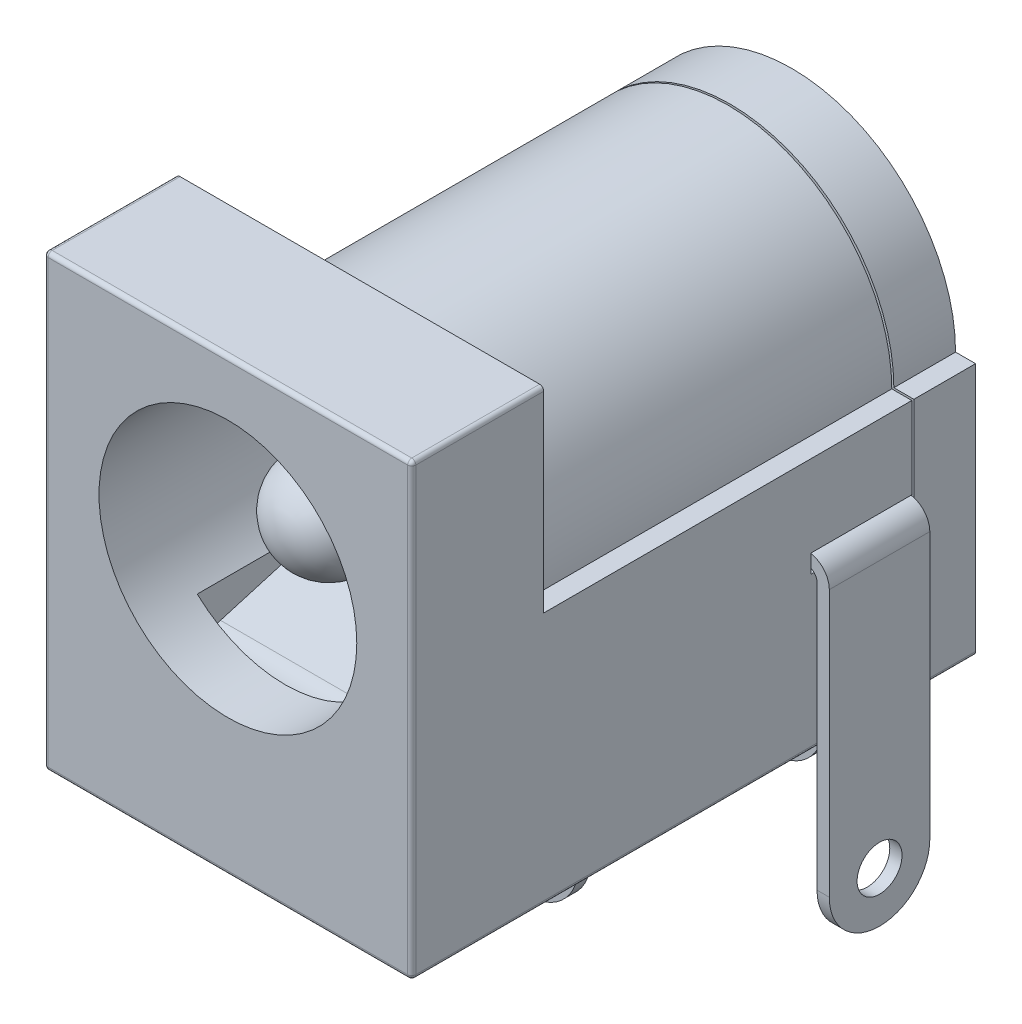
ISO-10303-21;
HEADER;
FILE_DESCRIPTION(('STEP AP214'),'2;1');
FILE_NAME('part.step','',(''),(''),'','','');
FILE_SCHEMA(('AUTOMOTIVE_DESIGN { 1 0 10303 214 1 1 1 1 }'));
ENDSEC;
DATA;
#1=APPLICATION_CONTEXT('core data for automotive mechanical design processes');
#2=APPLICATION_PROTOCOL_DEFINITION('international standard','automotive_design',2000,#1);
#3=PRODUCT_CONTEXT('',#1,'mechanical');
#4=PRODUCT('Part','Part','',(#3));
#5=PRODUCT_RELATED_PRODUCT_CATEGORY('part','',(#4));
#6=PRODUCT_DEFINITION_FORMATION('','',#4);
#7=PRODUCT_DEFINITION_CONTEXT('part definition',#1,'design');
#8=PRODUCT_DEFINITION('design','',#6,#7);
#9=PRODUCT_DEFINITION_SHAPE('','',#8);
#10=(LENGTH_UNIT() NAMED_UNIT(*) SI_UNIT(.MILLI.,.METRE.));
#11=(NAMED_UNIT(*) PLANE_ANGLE_UNIT() SI_UNIT($,.RADIAN.));
#12=(NAMED_UNIT(*) SI_UNIT($,.STERADIAN.) SOLID_ANGLE_UNIT());
#13=UNCERTAINTY_MEASURE_WITH_UNIT(LENGTH_MEASURE(1.E-05),#10,'distance_accuracy_value','');
#14=(GEOMETRIC_REPRESENTATION_CONTEXT(3) GLOBAL_UNCERTAINTY_ASSIGNED_CONTEXT((#13)) GLOBAL_UNIT_ASSIGNED_CONTEXT((#10,
#11,#12)) REPRESENTATION_CONTEXT('',''));
#15=CARTESIAN_POINT('',(0.,0.,0.));
#16=DIRECTION('',(0.,0.,1.));
#17=DIRECTION('',(1.,0.,0.));
#18=AXIS2_PLACEMENT_3D('',#15,#16,#17);
#19=CARTESIAN_POINT('',(4.65,-2.85,-6.11));
#20=DIRECTION('',(1.,0.,0.));
#21=DIRECTION('',(0.,1.,0.));
#22=AXIS2_PLACEMENT_3D('',#19,#20,#21);
#23=PLANE('',#22);
#24=CARTESIAN_POINT('',(4.65,-9.37,-4.88000000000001));
#25=DIRECTION('',(1.,0.,0.));
#26=DIRECTION('',(0.,1.,0.));
#27=AXIS2_PLACEMENT_3D('',#24,#25,#26);
#28=CIRCLE('',#27,0.550000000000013);
#29=CARTESIAN_POINT('',(4.65,-8.81999999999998,-4.88000000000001));
#30=VERTEX_POINT('',#29);
#31=EDGE_CURVE('E644',#30,#30,#28,.T.);
#32=ORIENTED_EDGE('',*,*,#31,.T.);
#33=EDGE_LOOP('',(#32));
#34=FACE_BOUND('',#33,.T.);
#35=DIRECTION('',(0.,1.,0.));
#36=VECTOR('',#35,1.);
#37=CARTESIAN_POINT('',(4.65,-2.85,-6.11));
#38=LINE('',#37,#36);
#39=CARTESIAN_POINT('',(4.65,-9.37,-6.11000000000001));
#40=VERTEX_POINT('',#39);
#41=CARTESIAN_POINT('',(4.65,-2.85,-6.11));
#42=VERTEX_POINT('',#41);
#43=EDGE_CURVE('E657',#40,#42,#38,.T.);
#44=ORIENTED_EDGE('',*,*,#43,.F.);
#45=CARTESIAN_POINT('',(4.65,-9.37,-4.88000000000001));
#46=DIRECTION('',(1.,0.,0.));
#47=DIRECTION('',(0.,1.,0.));
#48=AXIS2_PLACEMENT_3D('',#45,#46,#47);
#49=CIRCLE('',#48,1.23000000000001);
#50=CARTESIAN_POINT('',(4.65,-9.37,-3.65000000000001));
#51=VERTEX_POINT('',#50);
#52=EDGE_CURVE('E643',#51,#40,#49,.T.);
#53=ORIENTED_EDGE('',*,*,#52,.F.);
#54=DIRECTION('',(0.,1.,0.));
#55=VECTOR('',#54,1.);
#56=CARTESIAN_POINT('',(4.65,-2.85,-3.65));
#57=LINE('',#56,#55);
#58=CARTESIAN_POINT('',(4.65,-2.85,-3.65));
#59=VERTEX_POINT('',#58);
#60=EDGE_CURVE('E690',#51,#59,#57,.T.);
#61=ORIENTED_EDGE('',*,*,#60,.T.);
#62=DIRECTION('',(0.,0.,1.));
#63=VECTOR('',#62,1.);
#64=CARTESIAN_POINT('',(4.65,-2.85,-6.11));
#65=LINE('',#64,#63);
#66=EDGE_CURVE('E705',#42,#59,#65,.T.);
#67=ORIENTED_EDGE('',*,*,#66,.F.);
#68=EDGE_LOOP('',(#44,#53,#61,#67));
#69=FACE_BOUND('',#68,.T.);
#70=ADVANCED_FACE('F44',(#34,#69),#23,.F.);
#71=CARTESIAN_POINT('',(4.95,-10.6,-6.11000000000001));
#72=DIRECTION('',(-1.,0.,0.));
#73=DIRECTION('',(0.,0.,1.));
#74=AXIS2_PLACEMENT_3D('',#71,#72,#73);
#75=PLANE('',#74);
#76=CARTESIAN_POINT('',(4.95,-9.37,-4.88000000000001));
#77=DIRECTION('',(1.,0.,0.));
#78=DIRECTION('',(0.,0.,-1.));
#79=AXIS2_PLACEMENT_3D('',#76,#77,#78);
#80=CIRCLE('',#79,0.550000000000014);
#81=CARTESIAN_POINT('',(4.95,-9.37,-5.43000000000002));
#82=VERTEX_POINT('',#81);
#83=EDGE_CURVE('E3315',#82,#82,#80,.T.);
#84=ORIENTED_EDGE('',*,*,#83,.F.);
#85=EDGE_LOOP('',(#84));
#86=FACE_BOUND('',#85,.T.);
#87=CARTESIAN_POINT('',(4.95,-9.37,-4.88000000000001));
#88=DIRECTION('',(1.,0.,0.));
#89=DIRECTION('',(0.,1.,0.));
#90=AXIS2_PLACEMENT_3D('',#87,#88,#89);
#91=CIRCLE('',#90,1.23000000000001);
#92=CARTESIAN_POINT('',(4.95,-9.37,-3.65000000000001));
#93=VERTEX_POINT('',#92);
#94=CARTESIAN_POINT('',(4.95,-9.37,-6.11000000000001));
#95=VERTEX_POINT('',#94);
#96=EDGE_CURVE('E59',#93,#95,#91,.T.);
#97=ORIENTED_EDGE('',*,*,#96,.T.);
#98=DIRECTION('',(0.,-1.,0.));
#99=VECTOR('',#98,1.);
#100=CARTESIAN_POINT('',(4.95,-10.6,-6.11000000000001));
#101=LINE('',#100,#99);
#102=CARTESIAN_POINT('',(4.95,-2.85,-6.11));
#103=VERTEX_POINT('',#102);
#104=EDGE_CURVE('E639',#103,#95,#101,.T.);
#105=ORIENTED_EDGE('',*,*,#104,.F.);
#106=DIRECTION('',(0.,0.,1.));
#107=VECTOR('',#106,1.);
#108=CARTESIAN_POINT('',(4.95,-2.85,-6.11));
#109=LINE('',#108,#107);
#110=CARTESIAN_POINT('',(4.95,-2.85,-3.65));
#111=VERTEX_POINT('',#110);
#112=EDGE_CURVE('E709',#103,#111,#109,.T.);
#113=ORIENTED_EDGE('',*,*,#112,.T.);
#114=DIRECTION('',(0.,-1.,0.));
#115=VECTOR('',#114,1.);
#116=CARTESIAN_POINT('',(4.95,-10.6,-3.65000000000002));
#117=LINE('',#116,#115);
#118=EDGE_CURVE('E641',#111,#93,#117,.T.);
#119=ORIENTED_EDGE('',*,*,#118,.T.);
#120=EDGE_LOOP('',(#97,#105,#113,#119));
#121=FACE_BOUND('',#120,.T.);
#122=ADVANCED_FACE('F636',(#86,#121),#75,.F.);
#123=CARTESIAN_POINT('',(4.4,-2.85,-6.11));
#124=DIRECTION('',(0.,0.,1.));
#125=DIRECTION('',(0.,-1.,0.));
#126=AXIS2_PLACEMENT_3D('',#123,#124,#125);
#127=PLANE('',#126);
#128=DIRECTION('',(1.,0.,0.));
#129=VECTOR('',#128,1.);
#130=CARTESIAN_POINT('',(-4.5,-9.36999999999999,-6.11000000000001));
#131=LINE('',#130,#129);
#132=EDGE_CURVE('E13',#40,#95,#131,.T.);
#133=ORIENTED_EDGE('',*,*,#132,.F.);
#134=ORIENTED_EDGE('',*,*,#43,.T.);
#135=CARTESIAN_POINT('',(4.4,-2.85,-6.11));
#136=DIRECTION('',(0.,0.,1.));
#137=DIRECTION('',(0.,1.,0.));
#138=AXIS2_PLACEMENT_3D('',#135,#136,#137);
#139=CIRCLE('',#138,0.25);
#140=CARTESIAN_POINT('',(4.4,-2.6,-6.11));
#141=VERTEX_POINT('',#140);
#142=EDGE_CURVE('E662',#42,#141,#139,.T.);
#143=ORIENTED_EDGE('',*,*,#142,.T.);
#144=DIRECTION('',(-1.,0.,0.));
#145=VECTOR('',#144,1.);
#146=CARTESIAN_POINT('',(4.4,-2.6,-6.11));
#147=LINE('',#146,#145);
#148=CARTESIAN_POINT('',(4.,-2.6,-6.11));
#149=VERTEX_POINT('',#148);
#150=EDGE_CURVE('E672',#141,#149,#147,.T.);
#151=ORIENTED_EDGE('',*,*,#150,.T.);
#152=DIRECTION('',(0.,1.,0.));
#153=VECTOR('',#152,1.);
#154=CARTESIAN_POINT('',(4.,-0.800000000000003,-6.11));
#155=LINE('',#154,#153);
#156=CARTESIAN_POINT('',(4.,-2.3,-6.11));
#157=VERTEX_POINT('',#156);
#158=EDGE_CURVE('E67',#149,#157,#155,.T.);
#159=ORIENTED_EDGE('',*,*,#158,.T.);
#160=DIRECTION('',(1.,0.,0.));
#161=VECTOR('',#160,1.);
#162=CARTESIAN_POINT('',(-2.05,-2.3,-6.11));
#163=LINE('',#162,#161);
#164=CARTESIAN_POINT('',(4.4,-2.3,-6.11));
#165=VERTEX_POINT('',#164);
#166=EDGE_CURVE('E1719',#157,#165,#163,.T.);
#167=ORIENTED_EDGE('',*,*,#166,.T.);
#168=CARTESIAN_POINT('',(4.4,-2.85,-6.11));
#169=DIRECTION('',(0.,0.,-1.));
#170=DIRECTION('',(0.,-1.,0.));
#171=AXIS2_PLACEMENT_3D('',#168,#169,#170);
#172=CIRCLE('',#171,0.55);
#173=EDGE_CURVE('E654',#165,#103,#172,.T.);
#174=ORIENTED_EDGE('',*,*,#173,.T.);
#175=ORIENTED_EDGE('',*,*,#104,.T.);
#176=EDGE_LOOP('',(#133,#134,#143,#151,#159,#167,#174,#175));
#177=FACE_BOUND('',#176,.T.);
#178=ADVANCED_FACE('F651',(#177),#127,.F.);
#179=CARTESIAN_POINT('',(4.4,-2.85,-3.65));
#180=DIRECTION('',(0.,0.,1.));
#181=DIRECTION('',(0.,-1.,0.));
#182=AXIS2_PLACEMENT_3D('',#179,#180,#181);
#183=PLANE('',#182);
#184=ORIENTED_EDGE('',*,*,#60,.F.);
#185=DIRECTION('',(1.,0.,0.));
#186=VECTOR('',#185,1.);
#187=CARTESIAN_POINT('',(-4.5,-9.37,-3.65000000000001));
#188=LINE('',#187,#186);
#189=EDGE_CURVE('E53',#51,#93,#188,.T.);
#190=ORIENTED_EDGE('',*,*,#189,.T.);
#191=ORIENTED_EDGE('',*,*,#118,.F.);
#192=CARTESIAN_POINT('',(4.4,-2.85,-3.65));
#193=DIRECTION('',(0.,0.,-1.));
#194=DIRECTION('',(0.,-1.,0.));
#195=AXIS2_PLACEMENT_3D('',#192,#193,#194);
#196=CIRCLE('',#195,0.55);
#197=CARTESIAN_POINT('',(4.5,-2.3091673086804,-3.65));
#198=VERTEX_POINT('',#197);
#199=EDGE_CURVE('E683',#198,#111,#196,.T.);
#200=ORIENTED_EDGE('',*,*,#199,.F.);
#201=DIRECTION('',(0.,-1.,0.));
#202=VECTOR('',#201,1.);
#203=CARTESIAN_POINT('',(4.5,-2.3,-3.65));
#204=LINE('',#203,#202);
#205=CARTESIAN_POINT('',(4.5,-2.62087121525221,-3.65));
#206=VERTEX_POINT('',#205);
#207=EDGE_CURVE('E759',#198,#206,#204,.T.);
#208=ORIENTED_EDGE('',*,*,#207,.T.);
#209=CARTESIAN_POINT('',(4.4,-2.85,-3.65));
#210=DIRECTION('',(0.,0.,1.));
#211=DIRECTION('',(0.,1.,0.));
#212=AXIS2_PLACEMENT_3D('',#209,#210,#211);
#213=CIRCLE('',#212,0.25);
#214=EDGE_CURVE('E693',#59,#206,#213,.T.);
#215=ORIENTED_EDGE('',*,*,#214,.F.);
#216=EDGE_LOOP('',(#184,#190,#191,#200,#208,#215));
#217=FACE_BOUND('',#216,.T.);
#218=ADVANCED_FACE('F1707',(#217),#183,.T.);
#219=CARTESIAN_POINT('',(4.,-0.800000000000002,-6.17));
#220=DIRECTION('',(-1.,0.,0.));
#221=DIRECTION('',(0.,0.,1.));
#222=AXIS2_PLACEMENT_3D('',#219,#220,#221);
#223=PLANE('',#222);
#224=DIRECTION('',(0.,0.,-1.));
#225=VECTOR('',#224,1.);
#226=CARTESIAN_POINT('',(4.,-2.6,-6.17));
#227=LINE('',#226,#225);
#228=CARTESIAN_POINT('',(4.,-2.6,-3.65));
#229=VERTEX_POINT('',#228);
#230=EDGE_CURVE('E730',#229,#149,#227,.T.);
#231=ORIENTED_EDGE('',*,*,#230,.F.);
#232=DIRECTION('',(0.,-1.,0.));
#233=VECTOR('',#232,1.);
#234=CARTESIAN_POINT('',(4.,-2.3,-3.65));
#235=LINE('',#234,#233);
#236=CARTESIAN_POINT('',(4.,-2.75,-3.65));
#237=VERTEX_POINT('',#236);
#238=EDGE_CURVE('E773',#229,#237,#235,.T.);
#239=ORIENTED_EDGE('',*,*,#238,.T.);
#240=DIRECTION('',(0.,0.,-1.));
#241=VECTOR('',#240,1.);
#242=CARTESIAN_POINT('',(4.,-2.75,-6.17));
#243=LINE('',#242,#241);
#244=CARTESIAN_POINT('',(4.,-2.75,-6.12));
#245=VERTEX_POINT('',#244);
#246=EDGE_CURVE('E767',#237,#245,#243,.T.);
#247=ORIENTED_EDGE('',*,*,#246,.T.);
#248=DIRECTION('',(0.,-1.,0.));
#249=VECTOR('',#248,1.);
#250=CARTESIAN_POINT('',(4.,-0.800000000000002,-6.12));
#251=LINE('',#250,#249);
#252=CARTESIAN_POINT('',(4.,-6.,-6.12));
#253=VERTEX_POINT('',#252);
#254=EDGE_CURVE('E1395',#245,#253,#251,.T.);
#255=ORIENTED_EDGE('',*,*,#254,.T.);
#256=DIRECTION('',(0.,0.,1.));
#257=VECTOR('',#256,1.);
#258=CARTESIAN_POINT('',(4.,-6.,-6.17));
#259=LINE('',#258,#257);
#260=CARTESIAN_POINT('',(4.,-6.,-6.17));
#261=VERTEX_POINT('',#260);
#262=EDGE_CURVE('E1423',#261,#253,#259,.T.);
#263=ORIENTED_EDGE('',*,*,#262,.F.);
#264=DIRECTION('',(0.,-1.,0.));
#265=VECTOR('',#264,1.);
#266=CARTESIAN_POINT('',(4.,-0.800000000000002,-6.17));
#267=LINE('',#266,#265);
#268=CARTESIAN_POINT('',(4.,-0.800000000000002,-6.17));
#269=VERTEX_POINT('',#268);
#270=EDGE_CURVE('E1371',#269,#261,#267,.T.);
#271=ORIENTED_EDGE('',*,*,#270,.F.);
#272=DIRECTION('',(0.,0.,1.));
#273=VECTOR('',#272,1.);
#274=CARTESIAN_POINT('',(4.,-0.800000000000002,-6.17));
#275=LINE('',#274,#273);
#276=CARTESIAN_POINT('',(4.,-0.800000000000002,-6.12));
#277=VERTEX_POINT('',#276);
#278=EDGE_CURVE('E1427',#269,#277,#275,.T.);
#279=ORIENTED_EDGE('',*,*,#278,.T.);
#280=CARTESIAN_POINT('',(4.,-2.3,-6.12));
#281=VERTEX_POINT('',#280);
#282=EDGE_CURVE('E1396',#277,#281,#251,.T.);
#283=ORIENTED_EDGE('',*,*,#282,.T.);
#284=DIRECTION('',(0.,0.,1.));
#285=VECTOR('',#284,1.);
#286=CARTESIAN_POINT('',(4.,-2.3,-6.17));
#287=LINE('',#286,#285);
#288=EDGE_CURVE('E754',#281,#157,#287,.T.);
#289=ORIENTED_EDGE('',*,*,#288,.T.);
#290=ORIENTED_EDGE('',*,*,#158,.F.);
#291=EDGE_LOOP('',(#231,#239,#247,#255,#263,#271,#279,#283,#289,#290));
#292=FACE_BOUND('',#291,.T.);
#293=ADVANCED_FACE('F1956',(#292),#223,.F.);
#294=CARTESIAN_POINT('',(0.,0.,-15.0436875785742));
#295=DIRECTION('',(0.,0.,1.));
#296=DIRECTION('',(1.,0.,0.));
#297=AXIS2_PLACEMENT_3D('',#294,#295,#296);
#298=CYLINDRICAL_SURFACE('',#297,3.155);
#299=CARTESIAN_POINT('',(0.,0.,-6.12));
#300=DIRECTION('',(0.,0.,1.));
#301=DIRECTION('',(1.,0.,0.));
#302=AXIS2_PLACEMENT_3D('',#299,#300,#301);
#303=CIRCLE('',#302,3.155);
#304=CARTESIAN_POINT('',(3.155,0.,-6.12));
#305=VERTEX_POINT('',#304);
#306=EDGE_CURVE('E1167',#305,#305,#303,.F.);
#307=ORIENTED_EDGE('',*,*,#306,.T.);
#308=EDGE_LOOP('',(#307));
#309=FACE_BOUND('',#308,.T.);
#310=CARTESIAN_POINT('',(0.,0.,6.12));
#311=DIRECTION('',(0.,0.,1.));
#312=DIRECTION('',(1.,0.,0.));
#313=AXIS2_PLACEMENT_3D('',#310,#311,#312);
#314=CIRCLE('',#313,3.155);
#315=CARTESIAN_POINT('',(3.155,0.,6.12));
#316=VERTEX_POINT('',#315);
#317=EDGE_CURVE('E1163',#316,#316,#314,.T.);
#318=ORIENTED_EDGE('',*,*,#317,.T.);
#319=EDGE_LOOP('',(#318));
#320=FACE_BOUND('',#319,.T.);
#321=DIRECTION('',(0.,0.,1.));
#322=VECTOR('',#321,1.);
#323=CARTESIAN_POINT('',(-1.78718353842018,-2.59999999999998,-15.0436875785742));
#324=LINE('',#323,#322);
#325=CARTESIAN_POINT('',(-1.78718353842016,-2.6,-5.02));
#326=VERTEX_POINT('',#325);
#327=CARTESIAN_POINT('',(-1.78718353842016,-2.6,-6.11));
#328=VERTEX_POINT('',#327);
#329=EDGE_CURVE('E727',#326,#328,#324,.F.);
#330=ORIENTED_EDGE('',*,*,#329,.F.);
#331=CARTESIAN_POINT('',(0.,0.,-5.02));
#332=DIRECTION('',(0.,0.,-1.));
#333=DIRECTION('',(-1.,0.,0.));
#334=AXIS2_PLACEMENT_3D('',#331,#332,#333);
#335=CIRCLE('',#334,3.155);
#336=CARTESIAN_POINT('',(-1.24657848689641,-2.89828692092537,-5.02));
#337=VERTEX_POINT('',#336);
#338=EDGE_CURVE('E1556',#326,#337,#335,.F.);
#339=ORIENTED_EDGE('',*,*,#338,.T.);
#340=DIRECTION('',(0.,0.,1.));
#341=VECTOR('',#340,1.);
#342=CARTESIAN_POINT('',(-1.24657848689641,-2.89828692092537,-15.0436875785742));
#343=LINE('',#342,#341);
#344=CARTESIAN_POINT('',(-1.24657848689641,-2.89828692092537,-1.53));
#345=VERTEX_POINT('',#344);
#346=EDGE_CURVE('E998',#337,#345,#343,.T.);
#347=ORIENTED_EDGE('',*,*,#346,.T.);
#348=CARTESIAN_POINT('',(0.,0.,-1.53));
#349=DIRECTION('',(0.,0.,-1.));
#350=DIRECTION('',(-1.,0.,0.));
#351=AXIS2_PLACEMENT_3D('',#348,#349,#350);
#352=CIRCLE('',#351,3.155);
#353=CARTESIAN_POINT('',(1.24657848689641,-2.89828692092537,-1.53));
#354=VERTEX_POINT('',#353);
#355=EDGE_CURVE('E1524',#345,#354,#352,.F.);
#356=ORIENTED_EDGE('',*,*,#355,.T.);
#357=DIRECTION('',(0.,0.,1.));
#358=VECTOR('',#357,1.);
#359=CARTESIAN_POINT('',(1.24657848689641,-2.89828692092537,-15.0436875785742));
#360=LINE('',#359,#358);
#361=CARTESIAN_POINT('',(1.24657848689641,-2.89828692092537,-5.02));
#362=VERTEX_POINT('',#361);
#363=EDGE_CURVE('E1002',#354,#362,#360,.F.);
#364=ORIENTED_EDGE('',*,*,#363,.T.);
#365=CARTESIAN_POINT('',(1.78718353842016,-2.6,-5.02));
#366=VERTEX_POINT('',#365);
#367=EDGE_CURVE('E1552',#362,#366,#335,.F.);
#368=ORIENTED_EDGE('',*,*,#367,.T.);
#369=DIRECTION('',(0.,0.,1.));
#370=VECTOR('',#369,1.);
#371=CARTESIAN_POINT('',(1.78718353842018,-2.59999999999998,-15.0436875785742));
#372=LINE('',#371,#370);
#373=CARTESIAN_POINT('',(1.78718353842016,-2.6,-6.11));
#374=VERTEX_POINT('',#373);
#375=EDGE_CURVE('E724',#374,#366,#372,.T.);
#376=ORIENTED_EDGE('',*,*,#375,.F.);
#377=CARTESIAN_POINT('',(0.,0.,-6.11));
#378=DIRECTION('',(0.,0.,1.));
#379=DIRECTION('',(0.,-1.,0.));
#380=AXIS2_PLACEMENT_3D('',#377,#378,#379);
#381=CIRCLE('',#380,3.155);
#382=CARTESIAN_POINT('',(2.15963538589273,-2.3,-6.11));
#383=VERTEX_POINT('',#382);
#384=EDGE_CURVE('E744',#383,#374,#381,.F.);
#385=ORIENTED_EDGE('',*,*,#384,.F.);
#386=DIRECTION('',(0.,0.,1.));
#387=VECTOR('',#386,1.);
#388=CARTESIAN_POINT('',(2.15963538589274,-2.29999999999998,-15.0436875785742));
#389=LINE('',#388,#387);
#390=CARTESIAN_POINT('',(2.15963538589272,-2.3,-3.65));
#391=VERTEX_POINT('',#390);
#392=EDGE_CURVE('E733',#391,#383,#389,.F.);
#393=ORIENTED_EDGE('',*,*,#392,.F.);
#394=CARTESIAN_POINT('',(0.,0.,-3.65));
#395=DIRECTION('',(0.,0.,1.));
#396=DIRECTION('',(0.,-1.,0.));
#397=AXIS2_PLACEMENT_3D('',#394,#395,#396);
#398=CIRCLE('',#397,3.155);
#399=CARTESIAN_POINT('',(1.7896731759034,-2.59828692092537,-3.65));
#400=VERTEX_POINT('',#399);
#401=EDGE_CURVE('E739',#391,#400,#398,.F.);
#402=ORIENTED_EDGE('',*,*,#401,.T.);
#403=DIRECTION('',(0.,0.,1.));
#404=VECTOR('',#403,1.);
#405=CARTESIAN_POINT('',(1.7896731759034,-2.59828692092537,-15.0436875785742));
#406=LINE('',#405,#404);
#407=CARTESIAN_POINT('',(1.7896731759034,-2.59828692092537,-1.53));
#408=VERTEX_POINT('',#407);
#409=EDGE_CURVE('E991',#400,#408,#406,.T.);
#410=ORIENTED_EDGE('',*,*,#409,.T.);
#411=CARTESIAN_POINT('',(2.15,-2.30900952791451,-1.53));
#412=VERTEX_POINT('',#411);
#413=EDGE_CURVE('E1518',#408,#412,#352,.F.);
#414=ORIENTED_EDGE('',*,*,#413,.T.);
#415=DIRECTION('',(0.,0.,1.));
#416=VECTOR('',#415,1.);
#417=CARTESIAN_POINT('',(2.15,-2.30900952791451,-15.0436875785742));
#418=LINE('',#417,#416);
#419=CARTESIAN_POINT('',(2.15,-2.30900952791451,4.72));
#420=VERTEX_POINT('',#419);
#421=EDGE_CURVE('E1510',#420,#412,#418,.F.);
#422=ORIENTED_EDGE('',*,*,#421,.F.);
#423=CARTESIAN_POINT('',(0.,0.,4.72));
#424=DIRECTION('',(0.,0.,1.));
#425=DIRECTION('',(1.,0.,0.));
#426=AXIS2_PLACEMENT_3D('',#423,#424,#425);
#427=CIRCLE('',#426,3.155);
#428=CARTESIAN_POINT('',(-2.15,-2.30900952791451,4.72));
#429=VERTEX_POINT('',#428);
#430=EDGE_CURVE('E1514',#420,#429,#427,.F.);
#431=ORIENTED_EDGE('',*,*,#430,.T.);
#432=DIRECTION('',(0.,0.,1.));
#433=VECTOR('',#432,1.);
#434=CARTESIAN_POINT('',(-2.15,-2.30900952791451,-15.0436875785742));
#435=LINE('',#434,#433);
#436=CARTESIAN_POINT('',(-2.15,-2.30900952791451,-1.53));
#437=VERTEX_POINT('',#436);
#438=EDGE_CURVE('E1523',#429,#437,#435,.F.);
#439=ORIENTED_EDGE('',*,*,#438,.T.);
#440=CARTESIAN_POINT('',(-1.7896731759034,-2.59828692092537,-1.53));
#441=VERTEX_POINT('',#440);
#442=EDGE_CURVE('E1519',#437,#441,#352,.F.);
#443=ORIENTED_EDGE('',*,*,#442,.T.);
#444=DIRECTION('',(0.,0.,1.));
#445=VECTOR('',#444,1.);
#446=CARTESIAN_POINT('',(-1.7896731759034,-2.59828692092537,-15.0436875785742));
#447=LINE('',#446,#445);
#448=CARTESIAN_POINT('',(-1.7896731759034,-2.59828692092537,-3.65));
#449=VERTEX_POINT('',#448);
#450=EDGE_CURVE('E994',#441,#449,#447,.F.);
#451=ORIENTED_EDGE('',*,*,#450,.T.);
#452=CARTESIAN_POINT('',(-2.05,-2.39823372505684,-3.65));
#453=VERTEX_POINT('',#452);
#454=EDGE_CURVE('E743',#449,#453,#398,.F.);
#455=ORIENTED_EDGE('',*,*,#454,.T.);
#456=DIRECTION('',(0.,0.,1.));
#457=VECTOR('',#456,1.);
#458=CARTESIAN_POINT('',(-2.05,-2.39823372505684,-15.0436875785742));
#459=LINE('',#458,#457);
#460=CARTESIAN_POINT('',(-2.05,-2.39823372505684,-6.11));
#461=VERTEX_POINT('',#460);
#462=EDGE_CURVE('E1702',#461,#453,#459,.T.);
#463=ORIENTED_EDGE('',*,*,#462,.F.);
#464=EDGE_CURVE('E747',#328,#461,#381,.F.);
#465=ORIENTED_EDGE('',*,*,#464,.F.);
#466=EDGE_LOOP('',(#330,#339,#347,#356,#364,#368,#376,#385,#393,#402,#410,#414,#422,#431,#439,
#443,#451,#455,#463,#465));
#467=FACE_BOUND('',#466,.T.);
#468=ADVANCED_FACE('F1741',(#309,#320,#467),#298,.F.);
#469=CARTESIAN_POINT('',(-12.9308515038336,-2.59828692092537,-5.02));
#470=DIRECTION('',(0.,0.,-1.));
#471=DIRECTION('',(-1.,0.,0.));
#472=AXIS2_PLACEMENT_3D('',#469,#470,#471);
#473=PLANE('',#472);
#474=ORIENTED_EDGE('',*,*,#338,.F.);
#475=DIRECTION('',(1.,0.,0.));
#476=VECTOR('',#475,1.);
#477=CARTESIAN_POINT('',(-12.9308515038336,-2.6,-5.02));
#478=LINE('',#477,#476);
#479=EDGE_CURVE('E720',#326,#366,#478,.T.);
#480=ORIENTED_EDGE('',*,*,#479,.T.);
#481=ORIENTED_EDGE('',*,*,#367,.F.);
#482=DIRECTION('',(1.,0.,0.));
#483=VECTOR('',#482,1.);
#484=CARTESIAN_POINT('',(-12.9308515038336,-2.89828692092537,-5.02));
#485=LINE('',#484,#483);
#486=EDGE_CURVE('E908',#337,#362,#485,.T.);
#487=ORIENTED_EDGE('',*,*,#486,.F.);
#488=EDGE_LOOP('',(#474,#480,#481,#487));
#489=FACE_BOUND('',#488,.T.);
#490=ADVANCED_FACE('F1784',(#489),#473,.T.);
#491=CARTESIAN_POINT('',(1.44013672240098,-2.3,-3.65));
#492=DIRECTION('',(0.,0.,1.));
#493=DIRECTION('',(1.,0.,0.));
#494=AXIS2_PLACEMENT_3D('',#491,#492,#493);
#495=PLANE('',#494);
#496=CARTESIAN_POINT('',(4.4,-2.3,-3.65));
#497=VERTEX_POINT('',#496);
#498=EDGE_CURVE('E684',#497,#198,#196,.T.);
#499=ORIENTED_EDGE('',*,*,#498,.F.);
#500=DIRECTION('',(1.,0.,0.));
#501=VECTOR('',#500,1.);
#502=CARTESIAN_POINT('',(1.44013672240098,-2.3,-3.65));
#503=LINE('',#502,#501);
#504=CARTESIAN_POINT('',(4.5,-2.3,-3.65));
#505=VERTEX_POINT('',#504);
#506=EDGE_CURVE('E766',#497,#505,#503,.T.);
#507=ORIENTED_EDGE('',*,*,#506,.T.);
#508=EDGE_CURVE('E755',#505,#198,#204,.T.);
#509=ORIENTED_EDGE('',*,*,#508,.T.);
#510=EDGE_LOOP('',(#499,#507,#509));
#511=FACE_BOUND('',#510,.T.);
#512=ADVANCED_FACE('F2234',(#511),#495,.F.);
#513=CARTESIAN_POINT('',(4.4,-2.85,-3.65));
#514=DIRECTION('',(0.,0.,1.));
#515=DIRECTION('',(1.,0.,0.));
#516=AXIS2_PLACEMENT_3D('',#513,#514,#515);
#517=CIRCLE('',#516,0.25);
#518=CARTESIAN_POINT('',(4.4,-2.6,-3.65));
#519=VERTEX_POINT('',#518);
#520=EDGE_CURVE('E1654',#206,#519,#517,.T.);
#521=ORIENTED_EDGE('',*,*,#520,.F.);
#522=CARTESIAN_POINT('',(4.5,-2.75,-3.65));
#523=VERTEX_POINT('',#522);
#524=EDGE_CURVE('E760',#206,#523,#204,.T.);
#525=ORIENTED_EDGE('',*,*,#524,.T.);
#526=DIRECTION('',(1.,0.,0.));
#527=VECTOR('',#526,1.);
#528=CARTESIAN_POINT('',(1.44013672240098,-2.75,-3.65));
#529=LINE('',#528,#527);
#530=EDGE_CURVE('E772',#237,#523,#529,.T.);
#531=ORIENTED_EDGE('',*,*,#530,.F.);
#532=ORIENTED_EDGE('',*,*,#238,.F.);
#533=DIRECTION('',(-1.,0.,0.));
#534=VECTOR('',#533,1.);
#535=CARTESIAN_POINT('',(4.4,-2.6,-3.65));
#536=LINE('',#535,#534);
#537=EDGE_CURVE('E697',#519,#229,#536,.T.);
#538=ORIENTED_EDGE('',*,*,#537,.F.);
#539=EDGE_LOOP('',(#521,#525,#531,#532,#538));
#540=FACE_BOUND('',#539,.T.);
#541=ADVANCED_FACE('F2236',(#540),#495,.F.);
#542=CARTESIAN_POINT('',(0.,0.,-6.12));
#543=DIRECTION('',(0.,0.,1.));
#544=DIRECTION('',(1.,0.,0.));
#545=AXIS2_PLACEMENT_3D('',#542,#543,#544);
#546=PLANE('',#545);
#547=DIRECTION('',(0.,1.,0.));
#548=VECTOR('',#547,1.);
#549=CARTESIAN_POINT('',(4.5,4.5,-6.12));
#550=LINE('',#549,#548);
#551=CARTESIAN_POINT('',(4.5,-2.3,-6.12));
#552=VERTEX_POINT('',#551);
#553=CARTESIAN_POINT('',(4.5,-0.300000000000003,-6.12));
#554=VERTEX_POINT('',#553);
#555=EDGE_CURVE('E1483',#552,#554,#550,.T.);
#556=ORIENTED_EDGE('',*,*,#555,.F.);
#557=DIRECTION('',(-1.,0.,0.));
#558=VECTOR('',#557,1.);
#559=CARTESIAN_POINT('',(0.,-2.3,-6.12));
#560=LINE('',#559,#558);
#561=EDGE_CURVE('E784',#552,#281,#560,.T.);
#562=ORIENTED_EDGE('',*,*,#561,.T.);
#563=ORIENTED_EDGE('',*,*,#282,.F.);
#564=DIRECTION('',(1.,0.,0.));
#565=VECTOR('',#564,1.);
#566=CARTESIAN_POINT('',(3.47420494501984,-0.800000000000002,-6.12));
#567=LINE('',#566,#565);
#568=CARTESIAN_POINT('',(3.47420494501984,-0.800000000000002,-6.12));
#569=VERTEX_POINT('',#568);
#570=EDGE_CURVE('E1391',#569,#277,#567,.T.);
#571=ORIENTED_EDGE('',*,*,#570,.F.);
#572=CARTESIAN_POINT('',(0.,-0.300000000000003,-6.12));
#573=DIRECTION('',(0.,0.,-1.));
#574=DIRECTION('',(-1.,0.,0.));
#575=AXIS2_PLACEMENT_3D('',#572,#573,#574);
#576=CIRCLE('',#575,3.51000000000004);
#577=CARTESIAN_POINT('',(-3.47420494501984,-0.800000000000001,-6.12));
#578=VERTEX_POINT('',#577);
#579=EDGE_CURVE('E1324',#578,#569,#576,.T.);
#580=ORIENTED_EDGE('',*,*,#579,.F.);
#581=DIRECTION('',(1.,0.,0.));
#582=VECTOR('',#581,1.);
#583=CARTESIAN_POINT('',(-4.,-0.800000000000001,-6.12));
#584=LINE('',#583,#582);
#585=CARTESIAN_POINT('',(-4.,-0.800000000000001,-6.12));
#586=VERTEX_POINT('',#585);
#587=EDGE_CURVE('E1367',#586,#578,#584,.T.);
#588=ORIENTED_EDGE('',*,*,#587,.F.);
#589=DIRECTION('',(0.,1.,0.));
#590=VECTOR('',#589,1.);
#591=CARTESIAN_POINT('',(-4.,-6.,-6.12));
#592=LINE('',#591,#590);
#593=CARTESIAN_POINT('',(-4.,-6.,-6.12));
#594=VERTEX_POINT('',#593);
#595=EDGE_CURVE('E1405',#594,#586,#592,.T.);
#596=ORIENTED_EDGE('',*,*,#595,.F.);
#597=DIRECTION('',(-1.,0.,0.));
#598=VECTOR('',#597,1.);
#599=CARTESIAN_POINT('',(4.,-6.,-6.12));
#600=LINE('',#599,#598);
#601=CARTESIAN_POINT('',(-1.28,-6.,-6.12));
#602=VERTEX_POINT('',#601);
#603=EDGE_CURVE('E1400',#602,#594,#600,.T.);
#604=ORIENTED_EDGE('',*,*,#603,.F.);
#605=DIRECTION('',(0.,-1.,0.));
#606=VECTOR('',#605,1.);
#607=CARTESIAN_POINT('',(-1.28,0.,-6.12));
#608=LINE('',#607,#606);
#609=CARTESIAN_POINT('',(-1.28,-6.5,-6.12));
#610=VERTEX_POINT('',#609);
#611=EDGE_CURVE('E1107',#602,#610,#608,.T.);
#612=ORIENTED_EDGE('',*,*,#611,.T.);
#613=DIRECTION('',(1.,0.,0.));
#614=VECTOR('',#613,1.);
#615=CARTESIAN_POINT('',(-4.5,-6.5,-6.12));
#616=LINE('',#615,#614);
#617=CARTESIAN_POINT('',(-4.4,-6.5,-6.12));
#618=VERTEX_POINT('',#617);
#619=EDGE_CURVE('E1493',#618,#610,#616,.T.);
#620=ORIENTED_EDGE('',*,*,#619,.F.);
#621=CARTESIAN_POINT('',(-4.4,-6.4,-6.12));
#622=DIRECTION('',(0.,0.,1.));
#623=DIRECTION('',(1.,0.,0.));
#624=AXIS2_PLACEMENT_3D('',#621,#622,#623);
#625=CIRCLE('',#624,0.1);
#626=CARTESIAN_POINT('',(-4.5,-6.4,-6.12));
#627=VERTEX_POINT('',#626);
#628=EDGE_CURVE('E1618',#618,#627,#625,.F.);
#629=ORIENTED_EDGE('',*,*,#628,.T.);
#630=DIRECTION('',(0.,-1.,0.));
#631=VECTOR('',#630,1.);
#632=CARTESIAN_POINT('',(-4.5,4.5,-6.12));
#633=LINE('',#632,#631);
#634=CARTESIAN_POINT('',(-4.5,-0.300000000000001,-6.12));
#635=VERTEX_POINT('',#634);
#636=EDGE_CURVE('E1488',#635,#627,#633,.T.);
#637=ORIENTED_EDGE('',*,*,#636,.F.);
#638=DIRECTION('',(-1.,0.,0.));
#639=VECTOR('',#638,1.);
#640=CARTESIAN_POINT('',(-4.01,-0.300000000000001,-6.12));
#641=LINE('',#640,#639);
#642=CARTESIAN_POINT('',(-4.01,-0.300000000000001,-6.12));
#643=VERTEX_POINT('',#642);
#644=EDGE_CURVE('E1436',#643,#635,#641,.T.);
#645=ORIENTED_EDGE('',*,*,#644,.F.);
#646=CARTESIAN_POINT('',(0.,-0.300000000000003,-6.12));
#647=DIRECTION('',(0.,0.,1.));
#648=DIRECTION('',(1.,0.,0.));
#649=AXIS2_PLACEMENT_3D('',#646,#647,#648);
#650=CIRCLE('',#649,4.01);
#651=CARTESIAN_POINT('',(4.01,-0.300000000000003,-6.12));
#652=VERTEX_POINT('',#651);
#653=EDGE_CURVE('E1440',#652,#643,#650,.T.);
#654=ORIENTED_EDGE('',*,*,#653,.F.);
#655=DIRECTION('',(-1.,0.,0.));
#656=VECTOR('',#655,1.);
#657=CARTESIAN_POINT('',(4.5,-0.300000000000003,-6.12));
#658=LINE('',#657,#656);
#659=EDGE_CURVE('E1435',#554,#652,#658,.T.);
#660=ORIENTED_EDGE('',*,*,#659,.F.);
#661=EDGE_LOOP('',(#556,#562,#563,#571,#580,#588,#596,#604,#612,#620,#629,#637,#645,#654,#660));
#662=FACE_BOUND('',#661,.T.);
#663=ADVANCED_FACE('F1932',(#662),#546,.F.);
#664=CARTESIAN_POINT('',(0.,-9.37,-7.53));
#665=DIRECTION('',(0.,0.,-1.));
#666=DIRECTION('',(-1.,0.,0.));
#667=AXIS2_PLACEMENT_3D('',#664,#665,#666);
#668=PLANE('',#667);
#669=CARTESIAN_POINT('',(0.,-9.37,-7.53));
#670=DIRECTION('',(0.,0.,-1.));
#671=DIRECTION('',(-1.,0.,0.));
#672=AXIS2_PLACEMENT_3D('',#669,#670,#671);
#673=CIRCLE('',#672,1.23);
#674=CARTESIAN_POINT('',(1.23,-9.37,-7.53));
#675=VERTEX_POINT('',#674);
#676=CARTESIAN_POINT('',(-1.23,-9.37,-7.53));
#677=VERTEX_POINT('',#676);
#678=EDGE_CURVE('E1172',#675,#677,#673,.T.);
#679=ORIENTED_EDGE('',*,*,#678,.T.);
#680=DIRECTION('',(0.,1.,0.));
#681=VECTOR('',#680,1.);
#682=CARTESIAN_POINT('',(-1.23,-9.37,-7.53));
#683=LINE('',#682,#681);
#684=CARTESIAN_POINT('',(-1.23,-1.57070843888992,-7.53));
#685=VERTEX_POINT('',#684);
#686=EDGE_CURVE('E1176',#677,#685,#683,.T.);
#687=ORIENTED_EDGE('',*,*,#686,.T.);
#688=CARTESIAN_POINT('',(0.,0.,-7.53));
#689=DIRECTION('',(0.,0.,-1.));
#690=DIRECTION('',(-1.,0.,0.));
#691=AXIS2_PLACEMENT_3D('',#688,#689,#690);
#692=CIRCLE('',#691,1.995);
#693=CARTESIAN_POINT('',(-0.880866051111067,1.79,-7.53));
#694=VERTEX_POINT('',#693);
#695=EDGE_CURVE('E1180',#685,#694,#692,.T.);
#696=ORIENTED_EDGE('',*,*,#695,.T.);
#697=DIRECTION('',(1.,0.,0.));
#698=VECTOR('',#697,1.);
#699=CARTESIAN_POINT('',(-0.880866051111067,1.79,-7.53));
#700=LINE('',#699,#698);
#701=CARTESIAN_POINT('',(0.880866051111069,1.79,-7.53));
#702=VERTEX_POINT('',#701);
#703=EDGE_CURVE('E1183',#694,#702,#700,.T.);
#704=ORIENTED_EDGE('',*,*,#703,.T.);
#705=CARTESIAN_POINT('',(0.,0.,-7.53));
#706=DIRECTION('',(0.,0.,-1.));
#707=DIRECTION('',(-1.,0.,0.));
#708=AXIS2_PLACEMENT_3D('',#705,#706,#707);
#709=CIRCLE('',#708,1.995);
#710=CARTESIAN_POINT('',(1.23,-1.57070843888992,-7.53));
#711=VERTEX_POINT('',#710);
#712=EDGE_CURVE('E1186',#702,#711,#709,.T.);
#713=ORIENTED_EDGE('',*,*,#712,.T.);
#714=DIRECTION('',(0.,-1.,0.));
#715=VECTOR('',#714,1.);
#716=CARTESIAN_POINT('',(1.23,-1.57070843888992,-7.53));
#717=LINE('',#716,#715);
#718=EDGE_CURVE('E1189',#711,#675,#717,.T.);
#719=ORIENTED_EDGE('',*,*,#718,.T.);
#720=EDGE_LOOP('',(#679,#687,#696,#704,#713,#719));
#721=FACE_BOUND('',#720,.T.);
#722=CARTESIAN_POINT('',(0.,-9.37,-7.53));
#723=DIRECTION('',(0.,0.,-1.));
#724=DIRECTION('',(-1.,0.,0.));
#725=AXIS2_PLACEMENT_3D('',#722,#723,#724);
#726=CIRCLE('',#725,0.550000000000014);
#727=CARTESIAN_POINT('',(-0.550000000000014,-9.37,-7.53));
#728=VERTEX_POINT('',#727);
#729=EDGE_CURVE('E1057',#728,#728,#726,.T.);
#730=ORIENTED_EDGE('',*,*,#729,.F.);
#731=EDGE_LOOP('',(#730));
#732=FACE_BOUND('',#731,.T.);
#733=CARTESIAN_POINT('',(0.,0.,-7.53));
#734=DIRECTION('',(0.,0.,1.));
#735=DIRECTION('',(1.,0.,0.));
#736=AXIS2_PLACEMENT_3D('',#733,#734,#735);
#737=CIRCLE('',#736,1.14999999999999);
#738=CARTESIAN_POINT('',(1.14999999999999,0.,-7.53));
#739=VERTEX_POINT('',#738);
#740=EDGE_CURVE('E798',#739,#739,#737,.T.);
#741=ORIENTED_EDGE('',*,*,#740,.T.);
#742=EDGE_LOOP('',(#741));
#743=FACE_BOUND('',#742,.T.);
#744=ADVANCED_FACE('F2035',(#721,#732,#743),#668,.T.);
#745=CARTESIAN_POINT('',(-1.23,-5.5,-1.53));
#746=DIRECTION('',(-1.,0.,0.));
#747=DIRECTION('',(0.,-1.,0.));
#748=AXIS2_PLACEMENT_3D('',#745,#746,#747);
#749=PLANE('',#748);
#750=DIRECTION('',(0.,0.,1.));
#751=VECTOR('',#750,1.);
#752=CARTESIAN_POINT('',(-1.23,-6.5,-1.53));
#753=LINE('',#752,#751);
#754=CARTESIAN_POINT('',(-1.23,-6.5,-1.53));
#755=VERTEX_POINT('',#754);
#756=CARTESIAN_POINT('',(-1.23,-6.5,-1.23));
#757=VERTEX_POINT('',#756);
#758=EDGE_CURVE('E1009',#755,#757,#753,.T.);
#759=ORIENTED_EDGE('',*,*,#758,.F.);
#760=DIRECTION('',(0.,-1.,0.));
#761=VECTOR('',#760,1.);
#762=CARTESIAN_POINT('',(-1.23,-5.5,-1.53));
#763=LINE('',#762,#761);
#764=CARTESIAN_POINT('',(-1.23,-9.37,-1.53));
#765=VERTEX_POINT('',#764);
#766=EDGE_CURVE('E1135',#755,#765,#763,.T.);
#767=ORIENTED_EDGE('',*,*,#766,.T.);
#768=DIRECTION('',(0.,0.,1.));
#769=VECTOR('',#768,1.);
#770=CARTESIAN_POINT('',(-1.23,-9.37,-1.53));
#771=LINE('',#770,#769);
#772=CARTESIAN_POINT('',(-1.23,-9.37,-1.23));
#773=VERTEX_POINT('',#772);
#774=EDGE_CURVE('E1148',#765,#773,#771,.T.);
#775=ORIENTED_EDGE('',*,*,#774,.T.);
#776=DIRECTION('',(0.,-1.,0.));
#777=VECTOR('',#776,1.);
#778=CARTESIAN_POINT('',(-1.23,-5.5,-1.23));
#779=LINE('',#778,#777);
#780=EDGE_CURVE('E1131',#757,#773,#779,.T.);
#781=ORIENTED_EDGE('',*,*,#780,.F.);
#782=EDGE_LOOP('',(#759,#767,#775,#781));
#783=FACE_BOUND('',#782,.T.);
#784=ADVANCED_FACE('F2011',(#783),#749,.T.);
#785=CARTESIAN_POINT('',(1.23,-9.37,-1.53));
#786=DIRECTION('',(1.,0.,0.));
#787=DIRECTION('',(0.,0.,-1.));
#788=AXIS2_PLACEMENT_3D('',#785,#786,#787);
#789=PLANE('',#788);
#790=DIRECTION('',(0.,0.,-1.));
#791=VECTOR('',#790,1.);
#792=CARTESIAN_POINT('',(1.23,-6.5,-1.53));
#793=LINE('',#792,#791);
#794=CARTESIAN_POINT('',(1.23,-6.5,-1.23));
#795=VERTEX_POINT('',#794);
#796=CARTESIAN_POINT('',(1.23,-6.5,-1.53));
#797=VERTEX_POINT('',#796);
#798=EDGE_CURVE('E1005',#795,#797,#793,.T.);
#799=ORIENTED_EDGE('',*,*,#798,.F.);
#800=DIRECTION('',(0.,1.,0.));
#801=VECTOR('',#800,1.);
#802=CARTESIAN_POINT('',(1.23,-9.37,-1.23));
#803=LINE('',#802,#801);
#804=CARTESIAN_POINT('',(1.23,-9.37,-1.23));
#805=VERTEX_POINT('',#804);
#806=EDGE_CURVE('E1142',#805,#795,#803,.T.);
#807=ORIENTED_EDGE('',*,*,#806,.F.);
#808=DIRECTION('',(0.,0.,1.));
#809=VECTOR('',#808,1.);
#810=CARTESIAN_POINT('',(1.23,-9.37,-1.53));
#811=LINE('',#810,#809);
#812=CARTESIAN_POINT('',(1.23,-9.37,-1.53));
#813=VERTEX_POINT('',#812);
#814=EDGE_CURVE('E1138',#813,#805,#811,.T.);
#815=ORIENTED_EDGE('',*,*,#814,.F.);
#816=DIRECTION('',(0.,1.,0.));
#817=VECTOR('',#816,1.);
#818=CARTESIAN_POINT('',(1.23,-9.37,-1.53));
#819=LINE('',#818,#817);
#820=EDGE_CURVE('E1130',#813,#797,#819,.T.);
#821=ORIENTED_EDGE('',*,*,#820,.T.);
#822=EDGE_LOOP('',(#799,#807,#815,#821));
#823=FACE_BOUND('',#822,.T.);
#824=ADVANCED_FACE('F2013',(#823),#789,.T.);
#825=CARTESIAN_POINT('',(4.,-6.,-6.17));
#826=DIRECTION('',(0.,1.,0.));
#827=DIRECTION('',(0.,0.,1.));
#828=AXIS2_PLACEMENT_3D('',#825,#826,#827);
#829=PLANE('',#828);
#830=DIRECTION('',(0.,0.,1.));
#831=VECTOR('',#830,1.);
#832=CARTESIAN_POINT('',(1.28,-6.,-1.23));
#833=LINE('',#832,#831);
#834=CARTESIAN_POINT('',(1.28,-6.,-6.12));
#835=VERTEX_POINT('',#834);
#836=CARTESIAN_POINT('',(1.28,-6.,-1.53));
#837=VERTEX_POINT('',#836);
#838=EDGE_CURVE('E1100',#835,#837,#833,.T.);
#839=ORIENTED_EDGE('',*,*,#838,.T.);
#840=DIRECTION('',(-1.,0.,0.));
#841=VECTOR('',#840,1.);
#842=CARTESIAN_POINT('',(4.,-6.,-1.53));
#843=LINE('',#842,#841);
#844=CARTESIAN_POINT('',(1.23,-6.,-1.53));
#845=VERTEX_POINT('',#844);
#846=EDGE_CURVE('E1023',#837,#845,#843,.T.);
#847=ORIENTED_EDGE('',*,*,#846,.T.);
#848=DIRECTION('',(0.,0.,-1.));
#849=VECTOR('',#848,1.);
#850=CARTESIAN_POINT('',(1.23,-6.,-1.53));
#851=LINE('',#850,#849);
#852=CARTESIAN_POINT('',(1.23,-6.,-6.17));
#853=VERTEX_POINT('',#852);
#854=EDGE_CURVE('E1112',#845,#853,#851,.T.);
#855=ORIENTED_EDGE('',*,*,#854,.T.);
#856=DIRECTION('',(-1.,0.,0.));
#857=VECTOR('',#856,1.);
#858=CARTESIAN_POINT('',(4.,-6.,-6.17));
#859=LINE('',#858,#857);
#860=EDGE_CURVE('E1375',#261,#853,#859,.T.);
#861=ORIENTED_EDGE('',*,*,#860,.F.);
#862=ORIENTED_EDGE('',*,*,#262,.T.);
#863=EDGE_CURVE('E1401',#253,#835,#600,.T.);
#864=ORIENTED_EDGE('',*,*,#863,.T.);
#865=EDGE_LOOP('',(#839,#847,#855,#861,#862,#864));
#866=FACE_BOUND('',#865,.T.);
#867=ADVANCED_FACE('F1962',(#866),#829,.F.);
#868=DIRECTION('',(0.,0.,1.));
#869=VECTOR('',#868,1.);
#870=CARTESIAN_POINT('',(-1.23,-6.,-1.23));
#871=LINE('',#870,#869);
#872=CARTESIAN_POINT('',(-1.23,-6.,-6.17));
#873=VERTEX_POINT('',#872);
#874=CARTESIAN_POINT('',(-1.23,-6.,-1.53));
#875=VERTEX_POINT('',#874);
#876=EDGE_CURVE('E1108',#873,#875,#871,.T.);
#877=ORIENTED_EDGE('',*,*,#876,.T.);
#878=DIRECTION('',(-1.,0.,0.));
#879=VECTOR('',#878,1.);
#880=CARTESIAN_POINT('',(4.,-6.,-1.53));
#881=LINE('',#880,#879);
#882=CARTESIAN_POINT('',(-1.28,-6.,-1.53));
#883=VERTEX_POINT('',#882);
#884=EDGE_CURVE('E1013',#875,#883,#881,.T.);
#885=ORIENTED_EDGE('',*,*,#884,.T.);
#886=DIRECTION('',(0.,0.,-1.));
#887=VECTOR('',#886,1.);
#888=CARTESIAN_POINT('',(-1.28,-6.,-1.23));
#889=LINE('',#888,#887);
#890=EDGE_CURVE('E1104',#883,#602,#889,.T.);
#891=ORIENTED_EDGE('',*,*,#890,.T.);
#892=ORIENTED_EDGE('',*,*,#603,.T.);
#893=DIRECTION('',(0.,0.,1.));
#894=VECTOR('',#893,1.);
#895=CARTESIAN_POINT('',(-4.,-6.,-6.17));
#896=LINE('',#895,#894);
#897=CARTESIAN_POINT('',(-4.,-6.,-6.17));
#898=VERTEX_POINT('',#897);
#899=EDGE_CURVE('E1419',#898,#594,#896,.T.);
#900=ORIENTED_EDGE('',*,*,#899,.F.);
#901=EDGE_CURVE('E1374',#873,#898,#859,.T.);
#902=ORIENTED_EDGE('',*,*,#901,.F.);
#903=EDGE_LOOP('',(#877,#885,#891,#892,#900,#902));
#904=FACE_BOUND('',#903,.T.);
#905=ADVANCED_FACE('F2097',(#904),#829,.F.);
#906=CARTESIAN_POINT('',(0.,-0.300000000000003,-6.17));
#907=DIRECTION('',(0.,0.,-1.));
#908=DIRECTION('',(-1.,0.,0.));
#909=AXIS2_PLACEMENT_3D('',#906,#907,#908);
#910=PLANE('',#909);
#911=CARTESIAN_POINT('',(4.4,-6.4,-6.17));
#912=DIRECTION('',(0.,0.,-1.));
#913=DIRECTION('',(-1.,0.,0.));
#914=AXIS2_PLACEMENT_3D('',#911,#912,#913);
#915=CIRCLE('',#914,0.1);
#916=CARTESIAN_POINT('',(4.4,-6.5,-6.17));
#917=VERTEX_POINT('',#916);
#918=CARTESIAN_POINT('',(4.5,-6.4,-6.17));
#919=VERTEX_POINT('',#918);
#920=EDGE_CURVE('E1625',#917,#919,#915,.F.);
#921=ORIENTED_EDGE('',*,*,#920,.T.);
#922=DIRECTION('',(0.,-1.,0.));
#923=VECTOR('',#922,1.);
#924=CARTESIAN_POINT('',(4.5,-0.300000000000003,-6.17));
#925=LINE('',#924,#923);
#926=CARTESIAN_POINT('',(4.5,-0.300000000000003,-6.17));
#927=VERTEX_POINT('',#926);
#928=EDGE_CURVE('E1332',#927,#919,#925,.T.);
#929=ORIENTED_EDGE('',*,*,#928,.F.);
#930=DIRECTION('',(1.,0.,0.));
#931=VECTOR('',#930,1.);
#932=CARTESIAN_POINT('',(4.01,-0.300000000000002,-6.17));
#933=LINE('',#932,#931);
#934=CARTESIAN_POINT('',(4.01,-0.300000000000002,-6.17));
#935=VERTEX_POINT('',#934);
#936=EDGE_CURVE('E1328',#935,#927,#933,.T.);
#937=ORIENTED_EDGE('',*,*,#936,.F.);
#938=CARTESIAN_POINT('',(0.,-0.300000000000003,-6.17));
#939=DIRECTION('',(0.,0.,-1.));
#940=DIRECTION('',(-1.,0.,0.));
#941=AXIS2_PLACEMENT_3D('',#938,#939,#940);
#942=CIRCLE('',#941,4.01);
#943=CARTESIAN_POINT('',(-4.01,-0.300000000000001,-6.17));
#944=VERTEX_POINT('',#943);
#945=EDGE_CURVE('E1303',#944,#935,#942,.T.);
#946=ORIENTED_EDGE('',*,*,#945,.F.);
#947=DIRECTION('',(1.,0.,0.));
#948=VECTOR('',#947,1.);
#949=CARTESIAN_POINT('',(-4.5,-0.300000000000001,-6.17));
#950=LINE('',#949,#948);
#951=CARTESIAN_POINT('',(-4.5,-0.300000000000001,-6.17));
#952=VERTEX_POINT('',#951);
#953=EDGE_CURVE('E1342',#952,#944,#950,.T.);
#954=ORIENTED_EDGE('',*,*,#953,.F.);
#955=DIRECTION('',(0.,1.,0.));
#956=VECTOR('',#955,1.);
#957=CARTESIAN_POINT('',(-4.5,-6.5,-6.17));
#958=LINE('',#957,#956);
#959=CARTESIAN_POINT('',(-4.5,-6.4,-6.17));
#960=VERTEX_POINT('',#959);
#961=EDGE_CURVE('E1339',#960,#952,#958,.T.);
#962=ORIENTED_EDGE('',*,*,#961,.F.);
#963=CARTESIAN_POINT('',(-4.4,-6.4,-6.17));
#964=DIRECTION('',(0.,0.,-1.));
#965=DIRECTION('',(-1.,0.,0.));
#966=AXIS2_PLACEMENT_3D('',#963,#964,#965);
#967=CIRCLE('',#966,0.1);
#968=CARTESIAN_POINT('',(-4.4,-6.5,-6.17));
#969=VERTEX_POINT('',#968);
#970=EDGE_CURVE('E1629',#960,#969,#967,.F.);
#971=ORIENTED_EDGE('',*,*,#970,.T.);
#972=DIRECTION('',(-1.,0.,0.));
#973=VECTOR('',#972,1.);
#974=CARTESIAN_POINT('',(4.5,-6.5,-6.17));
#975=LINE('',#974,#973);
#976=CARTESIAN_POINT('',(-1.23,-6.5,-6.17));
#977=VERTEX_POINT('',#976);
#978=EDGE_CURVE('E1335',#977,#969,#975,.T.);
#979=ORIENTED_EDGE('',*,*,#978,.F.);
#980=DIRECTION('',(0.,1.,0.));
#981=VECTOR('',#980,1.);
#982=CARTESIAN_POINT('',(-1.23,-11.751780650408,-6.17));
#983=LINE('',#982,#981);
#984=EDGE_CURVE('E1090',#977,#873,#983,.T.);
#985=ORIENTED_EDGE('',*,*,#984,.T.);
#986=ORIENTED_EDGE('',*,*,#901,.T.);
#987=DIRECTION('',(0.,1.,0.));
#988=VECTOR('',#987,1.);
#989=CARTESIAN_POINT('',(-4.,-6.,-6.17));
#990=LINE('',#989,#988);
#991=CARTESIAN_POINT('',(-4.,-0.800000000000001,-6.17));
#992=VERTEX_POINT('',#991);
#993=EDGE_CURVE('E1379',#898,#992,#990,.T.);
#994=ORIENTED_EDGE('',*,*,#993,.T.);
#995=DIRECTION('',(1.,0.,0.));
#996=VECTOR('',#995,1.);
#997=CARTESIAN_POINT('',(-4.,-0.800000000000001,-6.17));
#998=LINE('',#997,#996);
#999=CARTESIAN_POINT('',(-3.47420494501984,-0.800000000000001,-6.17));
#1000=VERTEX_POINT('',#999);
#1001=EDGE_CURVE('E1383',#992,#1000,#998,.T.);
#1002=ORIENTED_EDGE('',*,*,#1001,.T.);
#1003=CARTESIAN_POINT('',(0.,-0.300000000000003,-6.17));
#1004=DIRECTION('',(0.,0.,-1.));
#1005=DIRECTION('',(-1.,0.,0.));
#1006=AXIS2_PLACEMENT_3D('',#1003,#1004,#1005);
#1007=CIRCLE('',#1006,3.51000000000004);
#1008=CARTESIAN_POINT('',(3.47420494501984,-0.800000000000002,-6.17));
#1009=VERTEX_POINT('',#1008);
#1010=EDGE_CURVE('E1362',#1000,#1009,#1007,.T.);
#1011=ORIENTED_EDGE('',*,*,#1010,.T.);
#1012=DIRECTION('',(1.,0.,0.));
#1013=VECTOR('',#1012,1.);
#1014=CARTESIAN_POINT('',(3.47420494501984,-0.800000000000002,-6.17));
#1015=LINE('',#1014,#1013);
#1016=EDGE_CURVE('E1366',#1009,#269,#1015,.T.);
#1017=ORIENTED_EDGE('',*,*,#1016,.T.);
#1018=ORIENTED_EDGE('',*,*,#270,.T.);
#1019=ORIENTED_EDGE('',*,*,#860,.T.);
#1020=DIRECTION('',(0.,1.,0.));
#1021=VECTOR('',#1020,1.);
#1022=CARTESIAN_POINT('',(1.23,-11.751780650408,-6.17));
#1023=LINE('',#1022,#1021);
#1024=CARTESIAN_POINT('',(1.23,-6.5,-6.17));
#1025=VERTEX_POINT('',#1024);
#1026=EDGE_CURVE('E1076',#1025,#853,#1023,.T.);
#1027=ORIENTED_EDGE('',*,*,#1026,.F.);
#1028=EDGE_CURVE('E1336',#917,#1025,#975,.T.);
#1029=ORIENTED_EDGE('',*,*,#1028,.F.);
#1030=EDGE_LOOP('',(#921,#929,#937,#946,#954,#962,#971,#979,#985,#986,#994,#1002,#1011,#1017,
#1018,#1019,#1027,#1029));
#1031=FACE_BOUND('',#1030,.T.);
#1032=ADVANCED_FACE('F1966',(#1031),#910,.F.);
#1033=CARTESIAN_POINT('',(0.,-9.37,-1.53));
#1034=DIRECTION('',(0.,0.,1.));
#1035=DIRECTION('',(1.,0.,0.));
#1036=AXIS2_PLACEMENT_3D('',#1033,#1034,#1035);
#1037=PLANE('',#1036);
#1038=CARTESIAN_POINT('',(0.,-9.37,-1.53));
#1039=DIRECTION('',(0.,0.,1.));
#1040=DIRECTION('',(1.,0.,0.));
#1041=AXIS2_PLACEMENT_3D('',#1038,#1039,#1040);
#1042=CIRCLE('',#1041,0.550000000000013);
#1043=CARTESIAN_POINT('',(0.550000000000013,-9.37,-1.53));
#1044=VERTEX_POINT('',#1043);
#1045=EDGE_CURVE('E1068',#1044,#1044,#1042,.T.);
#1046=ORIENTED_EDGE('',*,*,#1045,.T.);
#1047=EDGE_LOOP('',(#1046));
#1048=FACE_BOUND('',#1047,.T.);
#1049=DIRECTION('',(1.,0.,0.));
#1050=VECTOR('',#1049,1.);
#1051=CARTESIAN_POINT('',(-1.23,-6.5,-1.53));
#1052=LINE('',#1051,#1050);
#1053=EDGE_CURVE('E1082',#755,#797,#1052,.T.);
#1054=ORIENTED_EDGE('',*,*,#1053,.T.);
#1055=ORIENTED_EDGE('',*,*,#820,.F.);
#1056=CARTESIAN_POINT('',(0.,-9.37,-1.53));
#1057=DIRECTION('',(0.,0.,1.));
#1058=DIRECTION('',(1.,0.,0.));
#1059=AXIS2_PLACEMENT_3D('',#1056,#1057,#1058);
#1060=CIRCLE('',#1059,1.23);
#1061=EDGE_CURVE('E1126',#765,#813,#1060,.T.);
#1062=ORIENTED_EDGE('',*,*,#1061,.F.);
#1063=ORIENTED_EDGE('',*,*,#766,.F.);
#1064=EDGE_LOOP('',(#1054,#1055,#1062,#1063));
#1065=FACE_BOUND('',#1064,.T.);
#1066=ADVANCED_FACE('F1999',(#1048,#1065),#1037,.F.);
#1067=CARTESIAN_POINT('',(-4.5,-6.5,6.12));
#1068=DIRECTION('',(0.,1.,0.));
#1069=DIRECTION('',(0.,0.,1.));
#1070=AXIS2_PLACEMENT_3D('',#1067,#1068,#1069);
#1071=PLANE('',#1070);
#1072=DIRECTION('',(1.,0.,0.));
#1073=VECTOR('',#1072,1.);
#1074=CARTESIAN_POINT('',(-4.5,-6.5,6.02));
#1075=LINE('',#1074,#1073);
#1076=CARTESIAN_POINT('',(4.4,-6.5,6.02));
#1077=VERTEX_POINT('',#1076);
#1078=CARTESIAN_POINT('',(-4.4,-6.5,6.02));
#1079=VERTEX_POINT('',#1078);
#1080=EDGE_CURVE('E1609',#1077,#1079,#1075,.F.);
#1081=ORIENTED_EDGE('',*,*,#1080,.T.);
#1082=DIRECTION('',(0.,0.,-1.));
#1083=VECTOR('',#1082,1.);
#1084=CARTESIAN_POINT('',(-4.4,-6.5,6.12));
#1085=LINE('',#1084,#1083);
#1086=EDGE_CURVE('E1612',#1079,#618,#1085,.T.);
#1087=ORIENTED_EDGE('',*,*,#1086,.T.);
#1088=ORIENTED_EDGE('',*,*,#619,.T.);
#1089=DIRECTION('',(0.,0.,-1.));
#1090=VECTOR('',#1089,1.);
#1091=CARTESIAN_POINT('',(-1.28,-6.5,-1.23));
#1092=LINE('',#1091,#1090);
#1093=CARTESIAN_POINT('',(-1.28,-6.5,-1.53));
#1094=VERTEX_POINT('',#1093);
#1095=EDGE_CURVE('E1086',#1094,#610,#1092,.T.);
#1096=ORIENTED_EDGE('',*,*,#1095,.F.);
#1097=DIRECTION('',(1.,0.,0.));
#1098=VECTOR('',#1097,1.);
#1099=CARTESIAN_POINT('',(-12.9308515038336,-6.5,-1.53));
#1100=LINE('',#1099,#1098);
#1101=EDGE_CURVE('E947',#1094,#755,#1100,.T.);
#1102=ORIENTED_EDGE('',*,*,#1101,.T.);
#1103=ORIENTED_EDGE('',*,*,#758,.T.);
#1104=DIRECTION('',(1.,0.,0.));
#1105=VECTOR('',#1104,1.);
#1106=CARTESIAN_POINT('',(-4.5,-6.5,-1.23));
#1107=LINE('',#1106,#1105);
#1108=EDGE_CURVE('E1507',#757,#795,#1107,.T.);
#1109=ORIENTED_EDGE('',*,*,#1108,.T.);
#1110=ORIENTED_EDGE('',*,*,#798,.T.);
#1111=CARTESIAN_POINT('',(1.28,-6.5,-1.53));
#1112=VERTEX_POINT('',#1111);
#1113=EDGE_CURVE('E866',#797,#1112,#1100,.T.);
#1114=ORIENTED_EDGE('',*,*,#1113,.T.);
#1115=DIRECTION('',(0.,0.,1.));
#1116=VECTOR('',#1115,1.);
#1117=CARTESIAN_POINT('',(1.28,-6.5,-1.23));
#1118=LINE('',#1117,#1116);
#1119=CARTESIAN_POINT('',(1.28,-6.5,-6.12));
#1120=VERTEX_POINT('',#1119);
#1121=EDGE_CURVE('E1097',#1120,#1112,#1118,.T.);
#1122=ORIENTED_EDGE('',*,*,#1121,.F.);
#1123=CARTESIAN_POINT('',(4.4,-6.5,-6.12));
#1124=VERTEX_POINT('',#1123);
#1125=EDGE_CURVE('E1492',#1120,#1124,#616,.T.);
#1126=ORIENTED_EDGE('',*,*,#1125,.T.);
#1127=DIRECTION('',(0.,0.,-1.));
#1128=VECTOR('',#1127,1.);
#1129=CARTESIAN_POINT('',(4.4,-6.5,6.12));
#1130=LINE('',#1129,#1128);
#1131=EDGE_CURVE('E1606',#1124,#1077,#1130,.F.);
#1132=ORIENTED_EDGE('',*,*,#1131,.T.);
#1133=EDGE_LOOP('',(#1081,#1087,#1088,#1096,#1102,#1103,#1109,#1110,#1114,#1122,#1126,#1132));
#1134=FACE_BOUND('',#1133,.T.);
#1135=ADVANCED_FACE('F1850',(#1134),#1071,.F.);
#1136=CARTESIAN_POINT('',(0.,0.,-7.23));
#1137=DIRECTION('',(0.,0.,1.));
#1138=DIRECTION('',(1.,0.,0.));
#1139=AXIS2_PLACEMENT_3D('',#1136,#1137,#1138);
#1140=PLANE('',#1139);
#1141=DIRECTION('',(0.,1.,0.));
#1142=VECTOR('',#1141,1.);
#1143=CARTESIAN_POINT('',(-1.23,0.,-7.23));
#1144=LINE('',#1143,#1142);
#1145=CARTESIAN_POINT('',(-1.23,-6.5,-7.23));
#1146=VERTEX_POINT('',#1145);
#1147=CARTESIAN_POINT('',(-1.23,-1.57070843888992,-7.23));
#1148=VERTEX_POINT('',#1147);
#1149=EDGE_CURVE('E1496',#1146,#1148,#1144,.T.);
#1150=ORIENTED_EDGE('',*,*,#1149,.F.);
#1151=DIRECTION('',(-1.,0.,0.));
#1152=VECTOR('',#1151,1.);
#1153=CARTESIAN_POINT('',(-1.28,-6.5,-7.23));
#1154=LINE('',#1153,#1152);
#1155=CARTESIAN_POINT('',(-1.28,-6.5,-7.23));
#1156=VERTEX_POINT('',#1155);
#1157=EDGE_CURVE('E1273',#1146,#1156,#1154,.T.);
#1158=ORIENTED_EDGE('',*,*,#1157,.T.);
#1159=DIRECTION('',(0.,1.,0.));
#1160=VECTOR('',#1159,1.);
#1161=CARTESIAN_POINT('',(-1.28,-6.5,-7.23));
#1162=LINE('',#1161,#1160);
#1163=CARTESIAN_POINT('',(-1.28,-1.59487460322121,-7.23));
#1164=VERTEX_POINT('',#1163);
#1165=EDGE_CURVE('E1263',#1156,#1164,#1162,.T.);
#1166=ORIENTED_EDGE('',*,*,#1165,.T.);
#1167=CARTESIAN_POINT('',(0.,0.,-7.23));
#1168=DIRECTION('',(0.,0.,1.));
#1169=DIRECTION('',(1.,0.,0.));
#1170=AXIS2_PLACEMENT_3D('',#1167,#1168,#1169);
#1171=CIRCLE('',#1170,2.045);
#1172=CARTESIAN_POINT('',(-0.892426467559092,1.84,-7.23));
#1173=VERTEX_POINT('',#1172);
#1174=EDGE_CURVE('E1243',#1164,#1173,#1171,.F.);
#1175=ORIENTED_EDGE('',*,*,#1174,.T.);
#1176=DIRECTION('',(1.,0.,0.));
#1177=VECTOR('',#1176,1.);
#1178=CARTESIAN_POINT('',(-0.892426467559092,1.84,-7.23));
#1179=LINE('',#1178,#1177);
#1180=CARTESIAN_POINT('',(0.892426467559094,1.84,-7.23));
#1181=VERTEX_POINT('',#1180);
#1182=EDGE_CURVE('E1285',#1173,#1181,#1179,.T.);
#1183=ORIENTED_EDGE('',*,*,#1182,.T.);
#1184=CARTESIAN_POINT('',(0.,0.,-7.23));
#1185=DIRECTION('',(0.,0.,1.));
#1186=DIRECTION('',(1.,0.,0.));
#1187=AXIS2_PLACEMENT_3D('',#1184,#1185,#1186);
#1188=CIRCLE('',#1187,2.045);
#1189=CARTESIAN_POINT('',(1.28,-1.59487460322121,-7.23));
#1190=VERTEX_POINT('',#1189);
#1191=EDGE_CURVE('E1280',#1181,#1190,#1188,.F.);
#1192=ORIENTED_EDGE('',*,*,#1191,.T.);
#1193=DIRECTION('',(0.,-1.,0.));
#1194=VECTOR('',#1193,1.);
#1195=CARTESIAN_POINT('',(1.28,-6.5,-7.23));
#1196=LINE('',#1195,#1194);
#1197=CARTESIAN_POINT('',(1.28,-6.5,-7.23));
#1198=VERTEX_POINT('',#1197);
#1199=EDGE_CURVE('E1274',#1190,#1198,#1196,.T.);
#1200=ORIENTED_EDGE('',*,*,#1199,.T.);
#1201=CARTESIAN_POINT('',(1.23,-6.5,-7.23));
#1202=VERTEX_POINT('',#1201);
#1203=EDGE_CURVE('E1269',#1198,#1202,#1154,.T.);
#1204=ORIENTED_EDGE('',*,*,#1203,.T.);
#1205=DIRECTION('',(0.,-1.,0.));
#1206=VECTOR('',#1205,1.);
#1207=CARTESIAN_POINT('',(1.23,-1.57070843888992,-7.23));
#1208=LINE('',#1207,#1206);
#1209=CARTESIAN_POINT('',(1.23,-1.57070843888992,-7.23));
#1210=VERTEX_POINT('',#1209);
#1211=EDGE_CURVE('E1177',#1210,#1202,#1208,.T.);
#1212=ORIENTED_EDGE('',*,*,#1211,.F.);
#1213=CARTESIAN_POINT('',(0.,0.,-7.23));
#1214=DIRECTION('',(0.,0.,-1.));
#1215=DIRECTION('',(-1.,0.,0.));
#1216=AXIS2_PLACEMENT_3D('',#1213,#1214,#1215);
#1217=CIRCLE('',#1216,1.995);
#1218=CARTESIAN_POINT('',(0.880866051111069,1.79,-7.23));
#1219=VERTEX_POINT('',#1218);
#1220=EDGE_CURVE('E1208',#1219,#1210,#1217,.T.);
#1221=ORIENTED_EDGE('',*,*,#1220,.F.);
#1222=DIRECTION('',(1.,0.,0.));
#1223=VECTOR('',#1222,1.);
#1224=CARTESIAN_POINT('',(-0.880866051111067,1.79,-7.23));
#1225=LINE('',#1224,#1223);
#1226=CARTESIAN_POINT('',(-0.880866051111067,1.79,-7.23));
#1227=VERTEX_POINT('',#1226);
#1228=EDGE_CURVE('E1204',#1227,#1219,#1225,.T.);
#1229=ORIENTED_EDGE('',*,*,#1228,.F.);
#1230=CARTESIAN_POINT('',(0.,0.,-7.23));
#1231=DIRECTION('',(0.,0.,-1.));
#1232=DIRECTION('',(-1.,0.,0.));
#1233=AXIS2_PLACEMENT_3D('',#1230,#1231,#1232);
#1234=CIRCLE('',#1233,1.995);
#1235=EDGE_CURVE('E1200',#1148,#1227,#1234,.T.);
#1236=ORIENTED_EDGE('',*,*,#1235,.F.);
#1237=EDGE_LOOP('',(#1150,#1158,#1166,#1175,#1183,#1192,#1200,#1204,#1212,#1221,#1229,#1236));
#1238=FACE_BOUND('',#1237,.T.);
#1239=ADVANCED_FACE('F2087',(#1238),#1140,.F.);
#1240=ORIENTED_EDGE('',*,*,#254,.F.);
#1241=DIRECTION('',(1.,0.,0.));
#1242=VECTOR('',#1241,1.);
#1243=CARTESIAN_POINT('',(0.,-2.75,-6.12));
#1244=LINE('',#1243,#1242);
#1245=CARTESIAN_POINT('',(4.5,-2.75,-6.12));
#1246=VERTEX_POINT('',#1245);
#1247=EDGE_CURVE('E771',#245,#1246,#1244,.T.);
#1248=ORIENTED_EDGE('',*,*,#1247,.T.);
#1249=CARTESIAN_POINT('',(4.5,-6.4,-6.12));
#1250=VERTEX_POINT('',#1249);
#1251=EDGE_CURVE('E1484',#1250,#1246,#550,.T.);
#1252=ORIENTED_EDGE('',*,*,#1251,.F.);
#1253=CARTESIAN_POINT('',(4.4,-6.4,-6.12));
#1254=DIRECTION('',(0.,0.,1.));
#1255=DIRECTION('',(1.,0.,0.));
#1256=AXIS2_PLACEMENT_3D('',#1253,#1254,#1255);
#1257=CIRCLE('',#1256,0.1);
#1258=EDGE_CURVE('E1615',#1250,#1124,#1257,.F.);
#1259=ORIENTED_EDGE('',*,*,#1258,.T.);
#1260=ORIENTED_EDGE('',*,*,#1125,.F.);
#1261=DIRECTION('',(0.,1.,0.));
#1262=VECTOR('',#1261,1.);
#1263=CARTESIAN_POINT('',(1.28,0.,-6.12));
#1264=LINE('',#1263,#1262);
#1265=EDGE_CURVE('E1121',#1120,#835,#1264,.T.);
#1266=ORIENTED_EDGE('',*,*,#1265,.T.);
#1267=ORIENTED_EDGE('',*,*,#863,.F.);
#1268=EDGE_LOOP('',(#1240,#1248,#1252,#1259,#1260,#1266,#1267));
#1269=FACE_BOUND('',#1268,.T.);
#1270=ADVANCED_FACE('F1960',(#1269),#546,.F.);
#1271=CARTESIAN_POINT('',(4.5,4.5,6.12));
#1272=DIRECTION('',(-1.,0.,0.));
#1273=DIRECTION('',(0.,-1.,0.));
#1274=AXIS2_PLACEMENT_3D('',#1271,#1272,#1273);
#1275=PLANE('',#1274);
#1276=ORIENTED_EDGE('',*,*,#508,.F.);
#1277=DIRECTION('',(0.,0.,1.));
#1278=VECTOR('',#1277,1.);
#1279=CARTESIAN_POINT('',(4.5,-2.3,-6.17));
#1280=LINE('',#1279,#1278);
#1281=EDGE_CURVE('E750',#552,#505,#1280,.T.);
#1282=ORIENTED_EDGE('',*,*,#1281,.F.);
#1283=ORIENTED_EDGE('',*,*,#555,.T.);
#1284=DIRECTION('',(0.,0.,-1.));
#1285=VECTOR('',#1284,1.);
#1286=CARTESIAN_POINT('',(4.5,-0.300000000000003,16.32));
#1287=LINE('',#1286,#1285);
#1288=CARTESIAN_POINT('',(4.5,-0.300000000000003,2.89));
#1289=VERTEX_POINT('',#1288);
#1290=EDGE_CURVE('E1453',#1289,#554,#1287,.T.);
#1291=ORIENTED_EDGE('',*,*,#1290,.F.);
#1292=DIRECTION('',(0.,-1.,0.));
#1293=VECTOR('',#1292,1.);
#1294=CARTESIAN_POINT('',(4.5,4.5,2.89));
#1295=LINE('',#1294,#1293);
#1296=CARTESIAN_POINT('',(4.5,4.4,2.89));
#1297=VERTEX_POINT('',#1296);
#1298=EDGE_CURVE('E1450',#1297,#1289,#1295,.T.);
#1299=ORIENTED_EDGE('',*,*,#1298,.F.);
#1300=DIRECTION('',(0.,0.,-1.));
#1301=VECTOR('',#1300,1.);
#1302=CARTESIAN_POINT('',(4.5,4.4,6.12));
#1303=LINE('',#1302,#1301);
#1304=CARTESIAN_POINT('',(4.5,4.4,6.02));
#1305=VERTEX_POINT('',#1304);
#1306=EDGE_CURVE('E1578',#1297,#1305,#1303,.F.);
#1307=ORIENTED_EDGE('',*,*,#1306,.T.);
#1308=DIRECTION('',(0.,1.,0.));
#1309=VECTOR('',#1308,1.);
#1310=CARTESIAN_POINT('',(4.5,-6.5,6.02));
#1311=LINE('',#1310,#1309);
#1312=CARTESIAN_POINT('',(4.5,-6.4,6.02));
#1313=VERTEX_POINT('',#1312);
#1314=EDGE_CURVE('E1581',#1305,#1313,#1311,.F.);
#1315=ORIENTED_EDGE('',*,*,#1314,.T.);
#1316=DIRECTION('',(0.,0.,-1.));
#1317=VECTOR('',#1316,1.);
#1318=CARTESIAN_POINT('',(4.5,-6.4,6.12));
#1319=LINE('',#1318,#1317);
#1320=EDGE_CURVE('E1585',#1313,#1250,#1319,.T.);
#1321=ORIENTED_EDGE('',*,*,#1320,.T.);
#1322=ORIENTED_EDGE('',*,*,#1251,.T.);
#1323=DIRECTION('',(0.,0.,-1.));
#1324=VECTOR('',#1323,1.);
#1325=CARTESIAN_POINT('',(4.5,-2.75,-6.17));
#1326=LINE('',#1325,#1324);
#1327=EDGE_CURVE('E751',#523,#1246,#1326,.T.);
#1328=ORIENTED_EDGE('',*,*,#1327,.F.);
#1329=ORIENTED_EDGE('',*,*,#524,.F.);
#1330=ORIENTED_EDGE('',*,*,#207,.F.);
#1331=EDGE_LOOP('',(#1276,#1282,#1283,#1291,#1299,#1307,#1315,#1321,#1322,#1328,#1329,#1330));
#1332=FACE_BOUND('',#1331,.T.);
#1333=ADVANCED_FACE('F1914',(#1332),#1275,.F.);
#1334=CARTESIAN_POINT('',(-4.5,4.5,6.12));
#1335=DIRECTION('',(0.,-1.,0.));
#1336=DIRECTION('',(0.,0.,-1.));
#1337=AXIS2_PLACEMENT_3D('',#1334,#1335,#1336);
#1338=PLANE('',#1337);
#1339=DIRECTION('',(1.,0.,0.));
#1340=VECTOR('',#1339,1.);
#1341=CARTESIAN_POINT('',(-4.5,4.5,2.89));
#1342=LINE('',#1341,#1340);
#1343=CARTESIAN_POINT('',(-4.4,4.5,2.89));
#1344=VERTEX_POINT('',#1343);
#1345=CARTESIAN_POINT('',(4.4,4.5,2.89));
#1346=VERTEX_POINT('',#1345);
#1347=EDGE_CURVE('E1454',#1344,#1346,#1342,.T.);
#1348=ORIENTED_EDGE('',*,*,#1347,.F.);
#1349=DIRECTION('',(0.,0.,-1.));
#1350=VECTOR('',#1349,1.);
#1351=CARTESIAN_POINT('',(-4.4,4.5,6.12));
#1352=LINE('',#1351,#1350);
#1353=CARTESIAN_POINT('',(-4.4,4.5,6.02));
#1354=VERTEX_POINT('',#1353);
#1355=EDGE_CURVE('E1594',#1344,#1354,#1352,.F.);
#1356=ORIENTED_EDGE('',*,*,#1355,.T.);
#1357=DIRECTION('',(-1.,0.,0.));
#1358=VECTOR('',#1357,1.);
#1359=CARTESIAN_POINT('',(4.5,4.5,6.02));
#1360=LINE('',#1359,#1358);
#1361=CARTESIAN_POINT('',(4.4,4.5,6.02));
#1362=VERTEX_POINT('',#1361);
#1363=EDGE_CURVE('E1591',#1354,#1362,#1360,.F.);
#1364=ORIENTED_EDGE('',*,*,#1363,.T.);
#1365=DIRECTION('',(0.,0.,-1.));
#1366=VECTOR('',#1365,1.);
#1367=CARTESIAN_POINT('',(4.4,4.5,6.12));
#1368=LINE('',#1367,#1366);
#1369=EDGE_CURVE('E1588',#1362,#1346,#1368,.T.);
#1370=ORIENTED_EDGE('',*,*,#1369,.T.);
#1371=EDGE_LOOP('',(#1348,#1356,#1364,#1370));
#1372=FACE_BOUND('',#1371,.T.);
#1373=ADVANCED_FACE('F1897',(#1372),#1338,.F.);
#1374=CARTESIAN_POINT('',(-4.5,4.5,6.12));
#1375=DIRECTION('',(1.,0.,0.));
#1376=DIRECTION('',(0.,1.,0.));
#1377=AXIS2_PLACEMENT_3D('',#1374,#1375,#1376);
#1378=PLANE('',#1377);
#1379=ORIENTED_EDGE('',*,*,#636,.T.);
#1380=DIRECTION('',(0.,0.,-1.));
#1381=VECTOR('',#1380,1.);
#1382=CARTESIAN_POINT('',(-4.5,-6.4,6.12));
#1383=LINE('',#1382,#1381);
#1384=CARTESIAN_POINT('',(-4.5,-6.4,6.02));
#1385=VERTEX_POINT('',#1384);
#1386=EDGE_CURVE('E1603',#627,#1385,#1383,.F.);
#1387=ORIENTED_EDGE('',*,*,#1386,.T.);
#1388=DIRECTION('',(0.,-1.,0.));
#1389=VECTOR('',#1388,1.);
#1390=CARTESIAN_POINT('',(-4.5,4.5,6.02));
#1391=LINE('',#1390,#1389);
#1392=CARTESIAN_POINT('',(-4.5,4.4,6.02));
#1393=VERTEX_POINT('',#1392);
#1394=EDGE_CURVE('E1600',#1385,#1393,#1391,.F.);
#1395=ORIENTED_EDGE('',*,*,#1394,.T.);
#1396=DIRECTION('',(0.,0.,-1.));
#1397=VECTOR('',#1396,1.);
#1398=CARTESIAN_POINT('',(-4.5,4.4,6.12));
#1399=LINE('',#1398,#1397);
#1400=CARTESIAN_POINT('',(-4.5,4.4,2.89));
#1401=VERTEX_POINT('',#1400);
#1402=EDGE_CURVE('E1597',#1393,#1401,#1399,.T.);
#1403=ORIENTED_EDGE('',*,*,#1402,.T.);
#1404=DIRECTION('',(0.,1.,0.));
#1405=VECTOR('',#1404,1.);
#1406=CARTESIAN_POINT('',(-4.5,-0.300000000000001,2.89));
#1407=LINE('',#1406,#1405);
#1408=CARTESIAN_POINT('',(-4.5,-0.300000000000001,2.89));
#1409=VERTEX_POINT('',#1408);
#1410=EDGE_CURVE('E1458',#1409,#1401,#1407,.T.);
#1411=ORIENTED_EDGE('',*,*,#1410,.F.);
#1412=DIRECTION('',(0.,0.,-1.));
#1413=VECTOR('',#1412,1.);
#1414=CARTESIAN_POINT('',(-4.5,-0.300000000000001,16.32));
#1415=LINE('',#1414,#1413);
#1416=EDGE_CURVE('E1462',#1409,#635,#1415,.T.);
#1417=ORIENTED_EDGE('',*,*,#1416,.T.);
#1418=EDGE_LOOP('',(#1379,#1387,#1395,#1403,#1411,#1417));
#1419=FACE_BOUND('',#1418,.T.);
#1420=ADVANCED_FACE('F1884',(#1419),#1378,.F.);
#1421=CARTESIAN_POINT('',(0.,0.,6.12));
#1422=DIRECTION('',(0.,0.,1.));
#1423=DIRECTION('',(1.,0.,0.));
#1424=AXIS2_PLACEMENT_3D('',#1421,#1422,#1423);
#1425=PLANE('',#1424);
#1426=DIRECTION('',(1.,0.,0.));
#1427=VECTOR('',#1426,1.);
#1428=CARTESIAN_POINT('',(4.5,-6.4,6.12));
#1429=LINE('',#1428,#1427);
#1430=CARTESIAN_POINT('',(-4.4,-6.4,6.12));
#1431=VERTEX_POINT('',#1430);
#1432=CARTESIAN_POINT('',(4.4,-6.4,6.12));
#1433=VERTEX_POINT('',#1432);
#1434=EDGE_CURVE('E1565',#1431,#1433,#1429,.T.);
#1435=ORIENTED_EDGE('',*,*,#1434,.T.);
#1436=DIRECTION('',(0.,1.,0.));
#1437=VECTOR('',#1436,1.);
#1438=CARTESIAN_POINT('',(4.4,4.5,6.12));
#1439=LINE('',#1438,#1437);
#1440=CARTESIAN_POINT('',(4.4,4.4,6.12));
#1441=VERTEX_POINT('',#1440);
#1442=EDGE_CURVE('E1574',#1433,#1441,#1439,.T.);
#1443=ORIENTED_EDGE('',*,*,#1442,.T.);
#1444=DIRECTION('',(-1.,0.,0.));
#1445=VECTOR('',#1444,1.);
#1446=CARTESIAN_POINT('',(-4.5,4.4,6.12));
#1447=LINE('',#1446,#1445);
#1448=CARTESIAN_POINT('',(-4.4,4.4,6.12));
#1449=VERTEX_POINT('',#1448);
#1450=EDGE_CURVE('E1571',#1441,#1449,#1447,.T.);
#1451=ORIENTED_EDGE('',*,*,#1450,.T.);
#1452=DIRECTION('',(0.,-1.,0.));
#1453=VECTOR('',#1452,1.);
#1454=CARTESIAN_POINT('',(-4.4,-6.5,6.12));
#1455=LINE('',#1454,#1453);
#1456=EDGE_CURVE('E1568',#1449,#1431,#1455,.T.);
#1457=ORIENTED_EDGE('',*,*,#1456,.T.);
#1458=EDGE_LOOP('',(#1435,#1443,#1451,#1457));
#1459=FACE_BOUND('',#1458,.T.);
#1460=ORIENTED_EDGE('',*,*,#317,.F.);
#1461=EDGE_LOOP('',(#1460));
#1462=FACE_BOUND('',#1461,.T.);
#1463=ADVANCED_FACE('F2148',(#1459,#1462),#1425,.T.);
#1464=CARTESIAN_POINT('',(0.,0.,2.89));
#1465=DIRECTION('',(0.,0.,1.));
#1466=DIRECTION('',(1.,0.,0.));
#1467=AXIS2_PLACEMENT_3D('',#1464,#1465,#1466);
#1468=PLANE('',#1467);
#1469=ORIENTED_EDGE('',*,*,#1410,.T.);
#1470=CARTESIAN_POINT('',(-4.4,4.4,2.89));
#1471=DIRECTION('',(0.,0.,1.));
#1472=DIRECTION('',(1.,0.,0.));
#1473=AXIS2_PLACEMENT_3D('',#1470,#1471,#1472);
#1474=CIRCLE('',#1473,0.1);
#1475=EDGE_CURVE('E1651',#1401,#1344,#1474,.F.);
#1476=ORIENTED_EDGE('',*,*,#1475,.T.);
#1477=ORIENTED_EDGE('',*,*,#1347,.T.);
#1478=CARTESIAN_POINT('',(4.4,4.4,2.89));
#1479=DIRECTION('',(0.,0.,1.));
#1480=DIRECTION('',(1.,0.,0.));
#1481=AXIS2_PLACEMENT_3D('',#1478,#1479,#1480);
#1482=CIRCLE('',#1481,0.1);
#1483=EDGE_CURVE('E1648',#1346,#1297,#1482,.F.);
#1484=ORIENTED_EDGE('',*,*,#1483,.T.);
#1485=ORIENTED_EDGE('',*,*,#1298,.T.);
#1486=DIRECTION('',(-1.,0.,0.));
#1487=VECTOR('',#1486,1.);
#1488=CARTESIAN_POINT('',(4.5,-0.300000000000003,2.89));
#1489=LINE('',#1488,#1487);
#1490=CARTESIAN_POINT('',(4.01,-0.300000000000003,2.89));
#1491=VERTEX_POINT('',#1490);
#1492=EDGE_CURVE('E1439',#1289,#1491,#1489,.T.);
#1493=ORIENTED_EDGE('',*,*,#1492,.T.);
#1494=CARTESIAN_POINT('',(0.,-0.300000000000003,2.89));
#1495=DIRECTION('',(0.,0.,1.));
#1496=DIRECTION('',(1.,0.,0.));
#1497=AXIS2_PLACEMENT_3D('',#1494,#1495,#1496);
#1498=CIRCLE('',#1497,4.01);
#1499=CARTESIAN_POINT('',(-4.01,-0.3,2.89));
#1500=VERTEX_POINT('',#1499);
#1501=EDGE_CURVE('E1468',#1491,#1500,#1498,.T.);
#1502=ORIENTED_EDGE('',*,*,#1501,.T.);
#1503=DIRECTION('',(-1.,0.,0.));
#1504=VECTOR('',#1503,1.);
#1505=CARTESIAN_POINT('',(-4.01,-0.300000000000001,2.89));
#1506=LINE('',#1505,#1504);
#1507=EDGE_CURVE('E1463',#1500,#1409,#1506,.T.);
#1508=ORIENTED_EDGE('',*,*,#1507,.T.);
#1509=EDGE_LOOP('',(#1469,#1476,#1477,#1484,#1485,#1493,#1502,#1508));
#1510=FACE_BOUND('',#1509,.T.);
#1511=ADVANCED_FACE('F1894',(#1510),#1468,.F.);
#1512=CARTESIAN_POINT('',(4.5,-0.300000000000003,16.32));
#1513=DIRECTION('',(0.,-1.,0.));
#1514=DIRECTION('',(0.,0.,-1.));
#1515=AXIS2_PLACEMENT_3D('',#1512,#1513,#1514);
#1516=PLANE('',#1515);
#1517=ORIENTED_EDGE('',*,*,#1290,.T.);
#1518=ORIENTED_EDGE('',*,*,#659,.T.);
#1519=DIRECTION('',(0.,0.,-1.));
#1520=VECTOR('',#1519,1.);
#1521=CARTESIAN_POINT('',(4.01,-0.300000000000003,16.32));
#1522=LINE('',#1521,#1520);
#1523=EDGE_CURVE('E1449',#1491,#652,#1522,.T.);
#1524=ORIENTED_EDGE('',*,*,#1523,.F.);
#1525=ORIENTED_EDGE('',*,*,#1492,.F.);
#1526=EDGE_LOOP('',(#1517,#1518,#1524,#1525));
#1527=FACE_BOUND('',#1526,.T.);
#1528=ADVANCED_FACE('F1921',(#1527),#1516,.F.);
#1529=CARTESIAN_POINT('',(0.,-0.300000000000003,16.32));
#1530=DIRECTION('',(0.,0.,-1.));
#1531=DIRECTION('',(-1.,0.,0.));
#1532=AXIS2_PLACEMENT_3D('',#1529,#1530,#1531);
#1533=CYLINDRICAL_SURFACE('',#1532,4.01);
#1534=ORIENTED_EDGE('',*,*,#1523,.T.);
#1535=ORIENTED_EDGE('',*,*,#653,.T.);
#1536=DIRECTION('',(0.,0.,-1.));
#1537=VECTOR('',#1536,1.);
#1538=CARTESIAN_POINT('',(-4.01,-0.3,16.32));
#1539=LINE('',#1538,#1537);
#1540=EDGE_CURVE('E1467',#1500,#643,#1539,.T.);
#1541=ORIENTED_EDGE('',*,*,#1540,.F.);
#1542=ORIENTED_EDGE('',*,*,#1501,.F.);
#1543=EDGE_LOOP('',(#1534,#1535,#1541,#1542));
#1544=FACE_BOUND('',#1543,.T.);
#1545=ADVANCED_FACE('F1925',(#1544),#1533,.T.);
#1546=CARTESIAN_POINT('',(-4.01,-0.300000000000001,16.32));
#1547=DIRECTION('',(0.,-1.,0.));
#1548=DIRECTION('',(1.,0.,0.));
#1549=AXIS2_PLACEMENT_3D('',#1546,#1547,#1548);
#1550=PLANE('',#1549);
#1551=ORIENTED_EDGE('',*,*,#1540,.T.);
#1552=ORIENTED_EDGE('',*,*,#644,.T.);
#1553=ORIENTED_EDGE('',*,*,#1416,.F.);
#1554=ORIENTED_EDGE('',*,*,#1507,.F.);
#1555=EDGE_LOOP('',(#1551,#1552,#1553,#1554));
#1556=FACE_BOUND('',#1555,.T.);
#1557=ADVANCED_FACE('F2138',(#1556),#1550,.F.);
#1558=CARTESIAN_POINT('',(0.,-0.300000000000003,-6.17));
#1559=DIRECTION('',(0.,0.,1.));
#1560=DIRECTION('',(1.,0.,0.));
#1561=AXIS2_PLACEMENT_3D('',#1558,#1559,#1560);
#1562=CYLINDRICAL_SURFACE('',#1561,3.51000000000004);
#1563=ORIENTED_EDGE('',*,*,#579,.T.);
#1564=DIRECTION('',(0.,0.,1.));
#1565=VECTOR('',#1564,1.);
#1566=CARTESIAN_POINT('',(3.47420494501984,-0.800000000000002,-6.17));
#1567=LINE('',#1566,#1565);
#1568=EDGE_CURVE('E1431',#1009,#569,#1567,.T.);
#1569=ORIENTED_EDGE('',*,*,#1568,.F.);
#1570=ORIENTED_EDGE('',*,*,#1010,.F.);
#1571=DIRECTION('',(0.,0.,1.));
#1572=VECTOR('',#1571,1.);
#1573=CARTESIAN_POINT('',(-3.47420494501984,-0.800000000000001,-6.17));
#1574=LINE('',#1573,#1572);
#1575=EDGE_CURVE('E1387',#1000,#578,#1574,.T.);
#1576=ORIENTED_EDGE('',*,*,#1575,.T.);
#1577=EDGE_LOOP('',(#1563,#1569,#1570,#1576));
#1578=FACE_BOUND('',#1577,.T.);
#1579=ADVANCED_FACE('F2134',(#1578),#1562,.T.);
#1580=CARTESIAN_POINT('',(3.47420494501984,-0.800000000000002,-6.17));
#1581=DIRECTION('',(0.,-1.,0.));
#1582=DIRECTION('',(0.,0.,-1.));
#1583=AXIS2_PLACEMENT_3D('',#1580,#1581,#1582);
#1584=PLANE('',#1583);
#1585=ORIENTED_EDGE('',*,*,#570,.T.);
#1586=ORIENTED_EDGE('',*,*,#278,.F.);
#1587=ORIENTED_EDGE('',*,*,#1016,.F.);
#1588=ORIENTED_EDGE('',*,*,#1568,.T.);
#1589=EDGE_LOOP('',(#1585,#1586,#1587,#1588));
#1590=FACE_BOUND('',#1589,.T.);
#1591=ADVANCED_FACE('F2126',(#1590),#1584,.F.);
#1592=CARTESIAN_POINT('',(-4.,-6.,-6.17));
#1593=DIRECTION('',(1.,0.,0.));
#1594=DIRECTION('',(0.,1.,0.));
#1595=AXIS2_PLACEMENT_3D('',#1592,#1593,#1594);
#1596=PLANE('',#1595);
#1597=ORIENTED_EDGE('',*,*,#595,.T.);
#1598=DIRECTION('',(0.,0.,1.));
#1599=VECTOR('',#1598,1.);
#1600=CARTESIAN_POINT('',(-4.,-0.800000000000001,-6.17));
#1601=LINE('',#1600,#1599);
#1602=EDGE_CURVE('E1415',#992,#586,#1601,.T.);
#1603=ORIENTED_EDGE('',*,*,#1602,.F.);
#1604=ORIENTED_EDGE('',*,*,#993,.F.);
#1605=ORIENTED_EDGE('',*,*,#899,.T.);
#1606=EDGE_LOOP('',(#1597,#1603,#1604,#1605));
#1607=FACE_BOUND('',#1606,.T.);
#1608=ADVANCED_FACE('F2122',(#1607),#1596,.F.);
#1609=CARTESIAN_POINT('',(-4.,-0.800000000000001,-6.17));
#1610=DIRECTION('',(0.,-1.,0.));
#1611=DIRECTION('',(1.,0.,0.));
#1612=AXIS2_PLACEMENT_3D('',#1609,#1610,#1611);
#1613=PLANE('',#1612);
#1614=ORIENTED_EDGE('',*,*,#587,.T.);
#1615=ORIENTED_EDGE('',*,*,#1575,.F.);
#1616=ORIENTED_EDGE('',*,*,#1001,.F.);
#1617=ORIENTED_EDGE('',*,*,#1602,.T.);
#1618=EDGE_LOOP('',(#1614,#1615,#1616,#1617));
#1619=FACE_BOUND('',#1618,.T.);
#1620=ADVANCED_FACE('F2102',(#1619),#1613,.F.);
#1621=CARTESIAN_POINT('',(-4.5,-0.300000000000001,-35.0904408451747));
#1622=DIRECTION('',(0.,-1.,0.));
#1623=DIRECTION('',(1.,0.,0.));
#1624=AXIS2_PLACEMENT_3D('',#1621,#1622,#1623);
#1625=PLANE('',#1624);
#1626=DIRECTION('',(0.,0.,1.));
#1627=VECTOR('',#1626,1.);
#1628=CARTESIAN_POINT('',(-4.01,-0.300000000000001,-35.0904408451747));
#1629=LINE('',#1628,#1627);
#1630=CARTESIAN_POINT('',(-4.01,-0.300000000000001,-7.68));
#1631=VERTEX_POINT('',#1630);
#1632=EDGE_CURVE('E1346',#1631,#944,#1629,.T.);
#1633=ORIENTED_EDGE('',*,*,#1632,.F.);
#1634=DIRECTION('',(-1.,0.,0.));
#1635=VECTOR('',#1634,1.);
#1636=CARTESIAN_POINT('',(-4.5,-0.300000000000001,-7.68));
#1637=LINE('',#1636,#1635);
#1638=CARTESIAN_POINT('',(-4.5,-0.300000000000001,-7.68));
#1639=VERTEX_POINT('',#1638);
#1640=EDGE_CURVE('E1309',#1631,#1639,#1637,.T.);
#1641=ORIENTED_EDGE('',*,*,#1640,.T.);
#1642=DIRECTION('',(0.,0.,1.));
#1643=VECTOR('',#1642,1.);
#1644=CARTESIAN_POINT('',(-4.5,-0.300000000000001,-35.0904408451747));
#1645=LINE('',#1644,#1643);
#1646=EDGE_CURVE('E1349',#1639,#952,#1645,.T.);
#1647=ORIENTED_EDGE('',*,*,#1646,.T.);
#1648=ORIENTED_EDGE('',*,*,#953,.T.);
#1649=EDGE_LOOP('',(#1633,#1641,#1647,#1648));
#1650=FACE_BOUND('',#1649,.T.);
#1651=ADVANCED_FACE('F2098',(#1650),#1625,.F.);
#1652=CARTESIAN_POINT('',(-4.5,-6.5,-35.0904408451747));
#1653=DIRECTION('',(1.,0.,0.));
#1654=DIRECTION('',(0.,1.,0.));
#1655=AXIS2_PLACEMENT_3D('',#1652,#1653,#1654);
#1656=PLANE('',#1655);
#1657=DIRECTION('',(0.,-1.,0.));
#1658=VECTOR('',#1657,1.);
#1659=CARTESIAN_POINT('',(-4.5,-6.5,-7.68));
#1660=LINE('',#1659,#1658);
#1661=CARTESIAN_POINT('',(-4.5,-6.4,-7.68));
#1662=VERTEX_POINT('',#1661);
#1663=EDGE_CURVE('E1304',#1639,#1662,#1660,.T.);
#1664=ORIENTED_EDGE('',*,*,#1663,.T.);
#1665=DIRECTION('',(0.,0.,1.));
#1666=VECTOR('',#1665,1.);
#1667=CARTESIAN_POINT('',(-4.5,-6.4,-35.0904408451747));
#1668=LINE('',#1667,#1666);
#1669=EDGE_CURVE('E1621',#1662,#960,#1668,.T.);
#1670=ORIENTED_EDGE('',*,*,#1669,.T.);
#1671=ORIENTED_EDGE('',*,*,#961,.T.);
#1672=ORIENTED_EDGE('',*,*,#1646,.F.);
#1673=EDGE_LOOP('',(#1664,#1670,#1671,#1672));
#1674=FACE_BOUND('',#1673,.T.);
#1675=ADVANCED_FACE('F2101',(#1674),#1656,.F.);
#1676=CARTESIAN_POINT('',(4.5,-6.5,-35.0904408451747));
#1677=DIRECTION('',(0.,1.,0.));
#1678=DIRECTION('',(0.,0.,1.));
#1679=AXIS2_PLACEMENT_3D('',#1676,#1677,#1678);
#1680=PLANE('',#1679);
#1681=ORIENTED_EDGE('',*,*,#978,.T.);
#1682=DIRECTION('',(0.,0.,1.));
#1683=VECTOR('',#1682,1.);
#1684=CARTESIAN_POINT('',(-4.4,-6.5,-35.0904408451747));
#1685=LINE('',#1684,#1683);
#1686=CARTESIAN_POINT('',(-4.4,-6.5,-7.68));
#1687=VERTEX_POINT('',#1686);
#1688=EDGE_CURVE('E1636',#969,#1687,#1685,.F.);
#1689=ORIENTED_EDGE('',*,*,#1688,.T.);
#1690=DIRECTION('',(1.,0.,0.));
#1691=VECTOR('',#1690,1.);
#1692=CARTESIAN_POINT('',(4.5,-6.5,-7.68));
#1693=LINE('',#1692,#1691);
#1694=CARTESIAN_POINT('',(-1.28,-6.5,-7.68));
#1695=VERTEX_POINT('',#1694);
#1696=EDGE_CURVE('E1310',#1687,#1695,#1693,.T.);
#1697=ORIENTED_EDGE('',*,*,#1696,.T.);
#1698=DIRECTION('',(0.,0.,-1.));
#1699=VECTOR('',#1698,1.);
#1700=CARTESIAN_POINT('',(-1.28,-6.5,15.4089019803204));
#1701=LINE('',#1700,#1699);
#1702=EDGE_CURVE('E1268',#1156,#1695,#1701,.T.);
#1703=ORIENTED_EDGE('',*,*,#1702,.F.);
#1704=ORIENTED_EDGE('',*,*,#1157,.F.);
#1705=EDGE_CURVE('E1272',#1202,#1146,#1154,.T.);
#1706=ORIENTED_EDGE('',*,*,#1705,.F.);
#1707=ORIENTED_EDGE('',*,*,#1203,.F.);
#1708=DIRECTION('',(0.,0.,-1.));
#1709=VECTOR('',#1708,1.);
#1710=CARTESIAN_POINT('',(1.28,-6.5,15.4089019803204));
#1711=LINE('',#1710,#1709);
#1712=CARTESIAN_POINT('',(1.28,-6.5,-7.68));
#1713=VERTEX_POINT('',#1712);
#1714=EDGE_CURVE('E1278',#1198,#1713,#1711,.T.);
#1715=ORIENTED_EDGE('',*,*,#1714,.T.);
#1716=CARTESIAN_POINT('',(4.4,-6.5,-7.68));
#1717=VERTEX_POINT('',#1716);
#1718=EDGE_CURVE('E1308',#1713,#1717,#1693,.T.);
#1719=ORIENTED_EDGE('',*,*,#1718,.T.);
#1720=DIRECTION('',(0.,0.,1.));
#1721=VECTOR('',#1720,1.);
#1722=CARTESIAN_POINT('',(4.4,-6.5,-35.0904408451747));
#1723=LINE('',#1722,#1721);
#1724=EDGE_CURVE('E1632',#1717,#917,#1723,.T.);
#1725=ORIENTED_EDGE('',*,*,#1724,.T.);
#1726=ORIENTED_EDGE('',*,*,#1028,.T.);
#1727=DIRECTION('',(0.,0.,-1.));
#1728=VECTOR('',#1727,1.);
#1729=CARTESIAN_POINT('',(1.23,-6.5,-1.53));
#1730=LINE('',#1729,#1728);
#1731=EDGE_CURVE('E1077',#797,#1025,#1730,.T.);
#1732=ORIENTED_EDGE('',*,*,#1731,.F.);
#1733=ORIENTED_EDGE('',*,*,#1053,.F.);
#1734=DIRECTION('',(0.,0.,1.));
#1735=VECTOR('',#1734,1.);
#1736=CARTESIAN_POINT('',(-1.23,-6.5,-1.53));
#1737=LINE('',#1736,#1735);
#1738=EDGE_CURVE('E1081',#977,#755,#1737,.T.);
#1739=ORIENTED_EDGE('',*,*,#1738,.F.);
#1740=EDGE_LOOP('',(#1681,#1689,#1697,#1703,#1704,#1706,#1707,#1715,#1719,#1725,#1726,#1732,
#1733,#1739));
#1741=FACE_BOUND('',#1740,.T.);
#1742=ADVANCED_FACE('F1973',(#1741),#1680,.F.);
#1743=CARTESIAN_POINT('',(4.5,-0.300000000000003,-35.0904408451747));
#1744=DIRECTION('',(-1.,0.,0.));
#1745=DIRECTION('',(0.,0.,1.));
#1746=AXIS2_PLACEMENT_3D('',#1743,#1744,#1745);
#1747=PLANE('',#1746);
#1748=ORIENTED_EDGE('',*,*,#928,.T.);
#1749=DIRECTION('',(0.,0.,1.));
#1750=VECTOR('',#1749,1.);
#1751=CARTESIAN_POINT('',(4.5,-6.4,-35.0904408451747));
#1752=LINE('',#1751,#1750);
#1753=CARTESIAN_POINT('',(4.5,-6.4,-7.68));
#1754=VERTEX_POINT('',#1753);
#1755=EDGE_CURVE('E1645',#919,#1754,#1752,.F.);
#1756=ORIENTED_EDGE('',*,*,#1755,.T.);
#1757=DIRECTION('',(0.,1.,0.));
#1758=VECTOR('',#1757,1.);
#1759=CARTESIAN_POINT('',(4.5,-0.300000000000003,-7.68));
#1760=LINE('',#1759,#1758);
#1761=CARTESIAN_POINT('',(4.5,-0.300000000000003,-7.68));
#1762=VERTEX_POINT('',#1761);
#1763=EDGE_CURVE('E1313',#1754,#1762,#1760,.T.);
#1764=ORIENTED_EDGE('',*,*,#1763,.T.);
#1765=DIRECTION('',(0.,0.,1.));
#1766=VECTOR('',#1765,1.);
#1767=CARTESIAN_POINT('',(4.5,-0.300000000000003,-35.0904408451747));
#1768=LINE('',#1767,#1766);
#1769=EDGE_CURVE('E1353',#1762,#927,#1768,.T.);
#1770=ORIENTED_EDGE('',*,*,#1769,.T.);
#1771=EDGE_LOOP('',(#1748,#1756,#1764,#1770));
#1772=FACE_BOUND('',#1771,.T.);
#1773=ADVANCED_FACE('F2109',(#1772),#1747,.F.);
#1774=CARTESIAN_POINT('',(4.01,-0.300000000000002,-35.0904408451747));
#1775=DIRECTION('',(0.,-1.,0.));
#1776=DIRECTION('',(1.,0.,0.));
#1777=AXIS2_PLACEMENT_3D('',#1774,#1775,#1776);
#1778=PLANE('',#1777);
#1779=ORIENTED_EDGE('',*,*,#1769,.F.);
#1780=DIRECTION('',(-1.,0.,0.));
#1781=VECTOR('',#1780,1.);
#1782=CARTESIAN_POINT('',(4.01,-0.300000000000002,-7.68));
#1783=LINE('',#1782,#1781);
#1784=CARTESIAN_POINT('',(4.01,-0.300000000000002,-7.68));
#1785=VERTEX_POINT('',#1784);
#1786=EDGE_CURVE('E1316',#1762,#1785,#1783,.T.);
#1787=ORIENTED_EDGE('',*,*,#1786,.T.);
#1788=DIRECTION('',(0.,0.,1.));
#1789=VECTOR('',#1788,1.);
#1790=CARTESIAN_POINT('',(4.01,-0.300000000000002,-35.0904408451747));
#1791=LINE('',#1790,#1789);
#1792=EDGE_CURVE('E1356',#1785,#935,#1791,.T.);
#1793=ORIENTED_EDGE('',*,*,#1792,.T.);
#1794=ORIENTED_EDGE('',*,*,#936,.T.);
#1795=EDGE_LOOP('',(#1779,#1787,#1793,#1794));
#1796=FACE_BOUND('',#1795,.T.);
#1797=ADVANCED_FACE('F2112',(#1796),#1778,.F.);
#1798=CARTESIAN_POINT('',(0.,-0.300000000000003,-35.0904408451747));
#1799=DIRECTION('',(0.,0.,1.));
#1800=DIRECTION('',(1.,0.,0.));
#1801=AXIS2_PLACEMENT_3D('',#1798,#1799,#1800);
#1802=CYLINDRICAL_SURFACE('',#1801,4.01);
#1803=ORIENTED_EDGE('',*,*,#1792,.F.);
#1804=CARTESIAN_POINT('',(0.,-0.300000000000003,-7.68));
#1805=DIRECTION('',(0.,0.,1.));
#1806=DIRECTION('',(1.,0.,0.));
#1807=AXIS2_PLACEMENT_3D('',#1804,#1805,#1806);
#1808=CIRCLE('',#1807,4.01);
#1809=EDGE_CURVE('E1320',#1785,#1631,#1808,.T.);
#1810=ORIENTED_EDGE('',*,*,#1809,.T.);
#1811=ORIENTED_EDGE('',*,*,#1632,.T.);
#1812=ORIENTED_EDGE('',*,*,#945,.T.);
#1813=EDGE_LOOP('',(#1803,#1810,#1811,#1812));
#1814=FACE_BOUND('',#1813,.T.);
#1815=ADVANCED_FACE('F2093',(#1814),#1802,.T.);
#1816=CARTESIAN_POINT('',(0.,0.,-7.68));
#1817=DIRECTION('',(0.,0.,1.));
#1818=DIRECTION('',(1.,0.,0.));
#1819=AXIS2_PLACEMENT_3D('',#1816,#1817,#1818);
#1820=PLANE('',#1819);
#1821=ORIENTED_EDGE('',*,*,#1696,.F.);
#1822=CARTESIAN_POINT('',(-4.4,-6.4,-7.68));
#1823=DIRECTION('',(0.,0.,1.));
#1824=DIRECTION('',(1.,0.,0.));
#1825=AXIS2_PLACEMENT_3D('',#1822,#1823,#1824);
#1826=CIRCLE('',#1825,0.1);
#1827=EDGE_CURVE('E1642',#1687,#1662,#1826,.F.);
#1828=ORIENTED_EDGE('',*,*,#1827,.T.);
#1829=ORIENTED_EDGE('',*,*,#1663,.F.);
#1830=ORIENTED_EDGE('',*,*,#1640,.F.);
#1831=ORIENTED_EDGE('',*,*,#1809,.F.);
#1832=ORIENTED_EDGE('',*,*,#1786,.F.);
#1833=ORIENTED_EDGE('',*,*,#1763,.F.);
#1834=CARTESIAN_POINT('',(4.4,-6.4,-7.68));
#1835=DIRECTION('',(0.,0.,1.));
#1836=DIRECTION('',(1.,0.,0.));
#1837=AXIS2_PLACEMENT_3D('',#1834,#1835,#1836);
#1838=CIRCLE('',#1837,0.1);
#1839=EDGE_CURVE('E1639',#1754,#1717,#1838,.F.);
#1840=ORIENTED_EDGE('',*,*,#1839,.T.);
#1841=ORIENTED_EDGE('',*,*,#1718,.F.);
#1842=DIRECTION('',(0.,-1.,0.));
#1843=VECTOR('',#1842,1.);
#1844=CARTESIAN_POINT('',(1.28,-6.5,-7.68));
#1845=LINE('',#1844,#1843);
#1846=CARTESIAN_POINT('',(1.28,-1.59487460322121,-7.68));
#1847=VERTEX_POINT('',#1846);
#1848=EDGE_CURVE('E1240',#1847,#1713,#1845,.T.);
#1849=ORIENTED_EDGE('',*,*,#1848,.F.);
#1850=CARTESIAN_POINT('',(0.,0.,-7.68));
#1851=DIRECTION('',(0.,0.,-1.));
#1852=DIRECTION('',(-1.,0.,0.));
#1853=AXIS2_PLACEMENT_3D('',#1850,#1851,#1852);
#1854=CIRCLE('',#1853,2.045);
#1855=CARTESIAN_POINT('',(0.892426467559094,1.84,-7.68));
#1856=VERTEX_POINT('',#1855);
#1857=EDGE_CURVE('E1244',#1856,#1847,#1854,.T.);
#1858=ORIENTED_EDGE('',*,*,#1857,.F.);
#1859=DIRECTION('',(1.,0.,0.));
#1860=VECTOR('',#1859,1.);
#1861=CARTESIAN_POINT('',(-0.892426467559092,1.84,-7.68));
#1862=LINE('',#1861,#1860);
#1863=CARTESIAN_POINT('',(-0.892426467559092,1.84,-7.68));
#1864=VERTEX_POINT('',#1863);
#1865=EDGE_CURVE('E1248',#1864,#1856,#1862,.T.);
#1866=ORIENTED_EDGE('',*,*,#1865,.F.);
#1867=CARTESIAN_POINT('',(0.,0.,-7.68));
#1868=DIRECTION('',(0.,0.,-1.));
#1869=DIRECTION('',(-1.,0.,0.));
#1870=AXIS2_PLACEMENT_3D('',#1867,#1868,#1869);
#1871=CIRCLE('',#1870,2.045);
#1872=CARTESIAN_POINT('',(-1.28,-1.59487460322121,-7.68));
#1873=VERTEX_POINT('',#1872);
#1874=EDGE_CURVE('E1252',#1873,#1864,#1871,.T.);
#1875=ORIENTED_EDGE('',*,*,#1874,.F.);
#1876=DIRECTION('',(0.,1.,0.));
#1877=VECTOR('',#1876,1.);
#1878=CARTESIAN_POINT('',(-1.28,-6.5,-7.68));
#1879=LINE('',#1878,#1877);
#1880=EDGE_CURVE('E1239',#1695,#1873,#1879,.T.);
#1881=ORIENTED_EDGE('',*,*,#1880,.F.);
#1882=EDGE_LOOP('',(#1821,#1828,#1829,#1830,#1831,#1832,#1833,#1840,#1841,#1849,#1858,#1866,
#1875,#1881));
#1883=FACE_BOUND('',#1882,.T.);
#1884=ADVANCED_FACE('F2085',(#1883),#1820,.F.);
#1885=CARTESIAN_POINT('',(0.,0.,15.4089019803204));
#1886=DIRECTION('',(0.,0.,-1.));
#1887=DIRECTION('',(-1.,0.,0.));
#1888=AXIS2_PLACEMENT_3D('',#1885,#1886,#1887);
#1889=CYLINDRICAL_SURFACE('',#1888,2.045);
#1890=DIRECTION('',(0.,0.,-1.));
#1891=VECTOR('',#1890,1.);
#1892=CARTESIAN_POINT('',(-1.28,-1.59487460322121,15.4089019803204));
#1893=LINE('',#1892,#1891);
#1894=EDGE_CURVE('E1267',#1164,#1873,#1893,.T.);
#1895=ORIENTED_EDGE('',*,*,#1894,.T.);
#1896=ORIENTED_EDGE('',*,*,#1874,.T.);
#1897=DIRECTION('',(0.,0.,-1.));
#1898=VECTOR('',#1897,1.);
#1899=CARTESIAN_POINT('',(-0.892426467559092,1.84,15.4089019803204));
#1900=LINE('',#1899,#1898);
#1901=EDGE_CURVE('E1262',#1173,#1864,#1900,.T.);
#1902=ORIENTED_EDGE('',*,*,#1901,.F.);
#1903=ORIENTED_EDGE('',*,*,#1174,.F.);
#1904=EDGE_LOOP('',(#1895,#1896,#1902,#1903));
#1905=FACE_BOUND('',#1904,.T.);
#1906=ADVANCED_FACE('F2081',(#1905),#1889,.F.);
#1907=CARTESIAN_POINT('',(-0.892426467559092,1.84,15.4089019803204));
#1908=DIRECTION('',(0.,1.,0.));
#1909=DIRECTION('',(0.,0.,1.));
#1910=AXIS2_PLACEMENT_3D('',#1907,#1908,#1909);
#1911=PLANE('',#1910);
#1912=ORIENTED_EDGE('',*,*,#1901,.T.);
#1913=ORIENTED_EDGE('',*,*,#1865,.T.);
#1914=DIRECTION('',(0.,0.,-1.));
#1915=VECTOR('',#1914,1.);
#1916=CARTESIAN_POINT('',(0.892426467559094,1.84,15.4089019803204));
#1917=LINE('',#1916,#1915);
#1918=EDGE_CURVE('E1284',#1181,#1856,#1917,.T.);
#1919=ORIENTED_EDGE('',*,*,#1918,.F.);
#1920=ORIENTED_EDGE('',*,*,#1182,.F.);
#1921=EDGE_LOOP('',(#1912,#1913,#1919,#1920));
#1922=FACE_BOUND('',#1921,.T.);
#1923=ADVANCED_FACE('F2077',(#1922),#1911,.F.);
#1924=CARTESIAN_POINT('',(0.,0.,15.4089019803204));
#1925=DIRECTION('',(0.,0.,-1.));
#1926=DIRECTION('',(-1.,0.,0.));
#1927=AXIS2_PLACEMENT_3D('',#1924,#1925,#1926);
#1928=CYLINDRICAL_SURFACE('',#1927,2.045);
#1929=ORIENTED_EDGE('',*,*,#1918,.T.);
#1930=ORIENTED_EDGE('',*,*,#1857,.T.);
#1931=DIRECTION('',(0.,0.,-1.));
#1932=VECTOR('',#1931,1.);
#1933=CARTESIAN_POINT('',(1.28,-1.59487460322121,15.4089019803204));
#1934=LINE('',#1933,#1932);
#1935=EDGE_CURVE('E1279',#1190,#1847,#1934,.T.);
#1936=ORIENTED_EDGE('',*,*,#1935,.F.);
#1937=ORIENTED_EDGE('',*,*,#1191,.F.);
#1938=EDGE_LOOP('',(#1929,#1930,#1936,#1937));
#1939=FACE_BOUND('',#1938,.T.);
#1940=ADVANCED_FACE('F2073',(#1939),#1928,.F.);
#1941=CARTESIAN_POINT('',(1.28,-6.5,15.4089019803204));
#1942=DIRECTION('',(1.,0.,0.));
#1943=DIRECTION('',(0.,1.,0.));
#1944=AXIS2_PLACEMENT_3D('',#1941,#1942,#1943);
#1945=PLANE('',#1944);
#1946=ORIENTED_EDGE('',*,*,#1935,.T.);
#1947=ORIENTED_EDGE('',*,*,#1848,.T.);
#1948=ORIENTED_EDGE('',*,*,#1714,.F.);
#1949=ORIENTED_EDGE('',*,*,#1199,.F.);
#1950=EDGE_LOOP('',(#1946,#1947,#1948,#1949));
#1951=FACE_BOUND('',#1950,.T.);
#1952=ADVANCED_FACE('F2069',(#1951),#1945,.F.);
#1953=CARTESIAN_POINT('',(-1.28,-6.5,15.4089019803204));
#1954=DIRECTION('',(-1.,0.,0.));
#1955=DIRECTION('',(0.,-1.,0.));
#1956=AXIS2_PLACEMENT_3D('',#1953,#1954,#1955);
#1957=PLANE('',#1956);
#1958=ORIENTED_EDGE('',*,*,#1702,.T.);
#1959=ORIENTED_EDGE('',*,*,#1880,.T.);
#1960=ORIENTED_EDGE('',*,*,#1894,.F.);
#1961=ORIENTED_EDGE('',*,*,#1165,.F.);
#1962=EDGE_LOOP('',(#1958,#1959,#1960,#1961));
#1963=FACE_BOUND('',#1962,.T.);
#1964=ADVANCED_FACE('F2043',(#1963),#1957,.F.);
#1965=CARTESIAN_POINT('',(0.,-9.37,-7.23));
#1966=DIRECTION('',(0.,0.,-1.));
#1967=DIRECTION('',(-1.,0.,0.));
#1968=AXIS2_PLACEMENT_3D('',#1965,#1966,#1967);
#1969=PLANE('',#1968);
#1970=CARTESIAN_POINT('',(0.,-9.37,-7.23));
#1971=DIRECTION('',(0.,0.,-1.));
#1972=DIRECTION('',(-1.,0.,0.));
#1973=AXIS2_PLACEMENT_3D('',#1970,#1971,#1972);
#1974=CIRCLE('',#1973,0.550000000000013);
#1975=CARTESIAN_POINT('',(-0.550000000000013,-9.37,-7.23));
#1976=VERTEX_POINT('',#1975);
#1977=EDGE_CURVE('E1072',#1976,#1976,#1974,.T.);
#1978=ORIENTED_EDGE('',*,*,#1977,.T.);
#1979=EDGE_LOOP('',(#1978));
#1980=FACE_BOUND('',#1979,.T.);
#1981=CARTESIAN_POINT('',(1.23,-9.37,-7.23));
#1982=VERTEX_POINT('',#1981);
#1983=EDGE_CURVE('E1212',#1202,#1982,#1208,.T.);
#1984=ORIENTED_EDGE('',*,*,#1983,.F.);
#1985=ORIENTED_EDGE('',*,*,#1705,.T.);
#1986=DIRECTION('',(0.,1.,0.));
#1987=VECTOR('',#1986,1.);
#1988=CARTESIAN_POINT('',(-1.23,-9.37,-7.23));
#1989=LINE('',#1988,#1987);
#1990=CARTESIAN_POINT('',(-1.23,-9.37,-7.23));
#1991=VERTEX_POINT('',#1990);
#1992=EDGE_CURVE('E1196',#1991,#1146,#1989,.T.);
#1993=ORIENTED_EDGE('',*,*,#1992,.F.);
#1994=CARTESIAN_POINT('',(0.,-9.37,-7.23));
#1995=DIRECTION('',(0.,0.,-1.));
#1996=DIRECTION('',(-1.,0.,0.));
#1997=AXIS2_PLACEMENT_3D('',#1994,#1995,#1996);
#1998=CIRCLE('',#1997,1.23);
#1999=EDGE_CURVE('E1171',#1982,#1991,#1998,.T.);
#2000=ORIENTED_EDGE('',*,*,#1999,.F.);
#2001=EDGE_LOOP('',(#1984,#1985,#1993,#2000));
#2002=FACE_BOUND('',#2001,.T.);
#2003=ADVANCED_FACE('F2039',(#1980,#2002),#1969,.F.);
#2004=CARTESIAN_POINT('',(0.,-9.37,-7.53));
#2005=DIRECTION('',(0.,0.,1.));
#2006=DIRECTION('',(1.,0.,0.));
#2007=AXIS2_PLACEMENT_3D('',#2004,#2005,#2006);
#2008=CYLINDRICAL_SURFACE('',#2007,1.23);
#2009=ORIENTED_EDGE('',*,*,#1999,.T.);
#2010=DIRECTION('',(0.,0.,1.));
#2011=VECTOR('',#2010,1.);
#2012=CARTESIAN_POINT('',(-1.23,-9.37,-7.53));
#2013=LINE('',#2012,#2011);
#2014=EDGE_CURVE('E1235',#677,#1991,#2013,.T.);
#2015=ORIENTED_EDGE('',*,*,#2014,.F.);
#2016=ORIENTED_EDGE('',*,*,#678,.F.);
#2017=DIRECTION('',(0.,0.,1.));
#2018=VECTOR('',#2017,1.);
#2019=CARTESIAN_POINT('',(1.23,-9.37,-7.53));
#2020=LINE('',#2019,#2018);
#2021=EDGE_CURVE('E1192',#675,#1982,#2020,.T.);
#2022=ORIENTED_EDGE('',*,*,#2021,.T.);
#2023=EDGE_LOOP('',(#2009,#2015,#2016,#2022));
#2024=FACE_BOUND('',#2023,.T.);
#2025=ADVANCED_FACE('F2042',(#2024),#2008,.T.);
#2026=CARTESIAN_POINT('',(-1.23,-9.37,-7.53));
#2027=DIRECTION('',(1.,0.,0.));
#2028=DIRECTION('',(0.,1.,0.));
#2029=AXIS2_PLACEMENT_3D('',#2026,#2027,#2028);
#2030=PLANE('',#2029);
#2031=ORIENTED_EDGE('',*,*,#1992,.T.);
#2032=ORIENTED_EDGE('',*,*,#1149,.T.);
#2033=DIRECTION('',(0.,0.,1.));
#2034=VECTOR('',#2033,1.);
#2035=CARTESIAN_POINT('',(-1.23,-1.57070843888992,-7.53));
#2036=LINE('',#2035,#2034);
#2037=EDGE_CURVE('E1231',#685,#1148,#2036,.T.);
#2038=ORIENTED_EDGE('',*,*,#2037,.F.);
#2039=ORIENTED_EDGE('',*,*,#686,.F.);
#2040=ORIENTED_EDGE('',*,*,#2014,.T.);
#2041=EDGE_LOOP('',(#2031,#2032,#2038,#2039,#2040));
#2042=FACE_BOUND('',#2041,.T.);
#2043=ADVANCED_FACE('F2059',(#2042),#2030,.F.);
#2044=CARTESIAN_POINT('',(0.,0.,-7.53));
#2045=DIRECTION('',(0.,0.,1.));
#2046=DIRECTION('',(1.,0.,0.));
#2047=AXIS2_PLACEMENT_3D('',#2044,#2045,#2046);
#2048=CYLINDRICAL_SURFACE('',#2047,1.995);
#2049=ORIENTED_EDGE('',*,*,#1235,.T.);
#2050=DIRECTION('',(0.,0.,1.));
#2051=VECTOR('',#2050,1.);
#2052=CARTESIAN_POINT('',(-0.880866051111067,1.79,-7.53));
#2053=LINE('',#2052,#2051);
#2054=EDGE_CURVE('E1227',#694,#1227,#2053,.T.);
#2055=ORIENTED_EDGE('',*,*,#2054,.F.);
#2056=ORIENTED_EDGE('',*,*,#695,.F.);
#2057=ORIENTED_EDGE('',*,*,#2037,.T.);
#2058=EDGE_LOOP('',(#2049,#2055,#2056,#2057));
#2059=FACE_BOUND('',#2058,.T.);
#2060=ADVANCED_FACE('F2055',(#2059),#2048,.T.);
#2061=CARTESIAN_POINT('',(-0.880866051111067,1.79,-7.53));
#2062=DIRECTION('',(0.,-1.,0.));
#2063=DIRECTION('',(0.,0.,-1.));
#2064=AXIS2_PLACEMENT_3D('',#2061,#2062,#2063);
#2065=PLANE('',#2064);
#2066=ORIENTED_EDGE('',*,*,#1228,.T.);
#2067=DIRECTION('',(0.,0.,1.));
#2068=VECTOR('',#2067,1.);
#2069=CARTESIAN_POINT('',(0.880866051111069,1.79,-7.53));
#2070=LINE('',#2069,#2068);
#2071=EDGE_CURVE('E1223',#702,#1219,#2070,.T.);
#2072=ORIENTED_EDGE('',*,*,#2071,.F.);
#2073=ORIENTED_EDGE('',*,*,#703,.F.);
#2074=ORIENTED_EDGE('',*,*,#2054,.T.);
#2075=EDGE_LOOP('',(#2066,#2072,#2073,#2074));
#2076=FACE_BOUND('',#2075,.T.);
#2077=ADVANCED_FACE('F2051',(#2076),#2065,.F.);
#2078=CARTESIAN_POINT('',(0.,0.,-7.53));
#2079=DIRECTION('',(0.,0.,1.));
#2080=DIRECTION('',(1.,0.,0.));
#2081=AXIS2_PLACEMENT_3D('',#2078,#2079,#2080);
#2082=CYLINDRICAL_SURFACE('',#2081,1.995);
#2083=ORIENTED_EDGE('',*,*,#1220,.T.);
#2084=DIRECTION('',(0.,0.,1.));
#2085=VECTOR('',#2084,1.);
#2086=CARTESIAN_POINT('',(1.23,-1.57070843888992,-7.53));
#2087=LINE('',#2086,#2085);
#2088=EDGE_CURVE('E1219',#711,#1210,#2087,.T.);
#2089=ORIENTED_EDGE('',*,*,#2088,.F.);
#2090=ORIENTED_EDGE('',*,*,#712,.F.);
#2091=ORIENTED_EDGE('',*,*,#2071,.T.);
#2092=EDGE_LOOP('',(#2083,#2089,#2090,#2091));
#2093=FACE_BOUND('',#2092,.T.);
#2094=ADVANCED_FACE('F2047',(#2093),#2082,.T.);
#2095=CARTESIAN_POINT('',(1.23,-1.57070843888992,-7.53));
#2096=DIRECTION('',(-1.,0.,0.));
#2097=DIRECTION('',(0.,-1.,0.));
#2098=AXIS2_PLACEMENT_3D('',#2095,#2096,#2097);
#2099=PLANE('',#2098);
#2100=ORIENTED_EDGE('',*,*,#1211,.T.);
#2101=ORIENTED_EDGE('',*,*,#1983,.T.);
#2102=ORIENTED_EDGE('',*,*,#2021,.F.);
#2103=ORIENTED_EDGE('',*,*,#718,.F.);
#2104=ORIENTED_EDGE('',*,*,#2088,.T.);
#2105=EDGE_LOOP('',(#2100,#2101,#2102,#2103,#2104));
#2106=FACE_BOUND('',#2105,.T.);
#2107=ADVANCED_FACE('F2030',(#2106),#2099,.F.);
#2108=CARTESIAN_POINT('',(0.,0.,-6.12));
#2109=DIRECTION('',(0.,0.,1.));
#2110=DIRECTION('',(1.,0.,0.));
#2111=AXIS2_PLACEMENT_3D('',#2108,#2109,#2110);
#2112=PLANE('',#2111);
#2113=CARTESIAN_POINT('',(0.,0.,-6.12));
#2114=DIRECTION('',(0.,0.,1.));
#2115=DIRECTION('',(1.,0.,0.));
#2116=AXIS2_PLACEMENT_3D('',#2113,#2114,#2115);
#2117=CIRCLE('',#2116,1.45);
#2118=CARTESIAN_POINT('',(-1.45,0.,-6.12));
#2119=VERTEX_POINT('',#2118);
#2120=EDGE_CURVE('E1155',#2119,#2119,#2117,.T.);
#2121=ORIENTED_EDGE('',*,*,#2120,.F.);
#2122=EDGE_LOOP('',(#2121));
#2123=FACE_BOUND('',#2122,.T.);
#2124=ORIENTED_EDGE('',*,*,#306,.F.);
#2125=EDGE_LOOP('',(#2124));
#2126=FACE_BOUND('',#2125,.T.);
#2127=ADVANCED_FACE('F2023',(#2123,#2126),#2112,.T.);
#2128=CARTESIAN_POINT('',(0.,0.,-1.81878066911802));
#2129=DIRECTION('',(0.,0.,-1.));
#2130=DIRECTION('',(-1.,0.,0.));
#2131=AXIS2_PLACEMENT_3D('',#2128,#2129,#2130);
#2132=CYLINDRICAL_SURFACE('',#2131,1.45);
#2133=CARTESIAN_POINT('',(0.,0.,-6.02));
#2134=DIRECTION('',(0.,0.,1.));
#2135=DIRECTION('',(1.,0.,0.));
#2136=AXIS2_PLACEMENT_3D('',#2133,#2134,#2135);
#2137=CIRCLE('',#2136,1.45);
#2138=CARTESIAN_POINT('',(-1.45,0.,-6.02));
#2139=VERTEX_POINT('',#2138);
#2140=EDGE_CURVE('E1159',#2139,#2139,#2137,.T.);
#2141=CARTESIAN_POINT('',(-1.45,0.,-6.12));
#2142=CARTESIAN_POINT('',(-1.45,0.,-6.11895833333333));
#2143=CARTESIAN_POINT('',(-1.45,0.,-6.11791666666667));
#2144=CARTESIAN_POINT('',(-1.45,0.,-6.11583333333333));
#2145=CARTESIAN_POINT('',(-1.45,0.,-6.11479166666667));
#2146=CARTESIAN_POINT('',(-1.45,0.,-6.11270833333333));
#2147=CARTESIAN_POINT('',(-1.45,0.,-6.11166666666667));
#2148=CARTESIAN_POINT('',(-1.45,0.,-6.10958333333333));
#2149=CARTESIAN_POINT('',(-1.45,0.,-6.10854166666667));
#2150=CARTESIAN_POINT('',(-1.45,0.,-6.10645833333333));
#2151=CARTESIAN_POINT('',(-1.45,0.,-6.10541666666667));
#2152=CARTESIAN_POINT('',(-1.45,0.,-6.10333333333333));
#2153=CARTESIAN_POINT('',(-1.45,0.,-6.10229166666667));
#2154=CARTESIAN_POINT('',(-1.45,0.,-6.10020833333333));
#2155=CARTESIAN_POINT('',(-1.45,0.,-6.09916666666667));
#2156=CARTESIAN_POINT('',(-1.45,0.,-6.09708333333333));
#2157=CARTESIAN_POINT('',(-1.45,0.,-6.09604166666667));
#2158=CARTESIAN_POINT('',(-1.45,0.,-6.09395833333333));
#2159=CARTESIAN_POINT('',(-1.45,0.,-6.09291666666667));
#2160=CARTESIAN_POINT('',(-1.45,0.,-6.09083333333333));
#2161=CARTESIAN_POINT('',(-1.45,0.,-6.08979166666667));
#2162=CARTESIAN_POINT('',(-1.45,0.,-6.08770833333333));
#2163=CARTESIAN_POINT('',(-1.45,0.,-6.08666666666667));
#2164=CARTESIAN_POINT('',(-1.45,0.,-6.08458333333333));
#2165=CARTESIAN_POINT('',(-1.45,0.,-6.08354166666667));
#2166=CARTESIAN_POINT('',(-1.45,0.,-6.08145833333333));
#2167=CARTESIAN_POINT('',(-1.45,0.,-6.08041666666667));
#2168=CARTESIAN_POINT('',(-1.45,0.,-6.07833333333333));
#2169=CARTESIAN_POINT('',(-1.45,0.,-6.07729166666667));
#2170=CARTESIAN_POINT('',(-1.45,0.,-6.07520833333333));
#2171=CARTESIAN_POINT('',(-1.45,0.,-6.07416666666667));
#2172=CARTESIAN_POINT('',(-1.45,0.,-6.07208333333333));
#2173=CARTESIAN_POINT('',(-1.45,0.,-6.07104166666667));
#2174=CARTESIAN_POINT('',(-1.45,0.,-6.06895833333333));
#2175=CARTESIAN_POINT('',(-1.45,0.,-6.06791666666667));
#2176=CARTESIAN_POINT('',(-1.45,0.,-6.06583333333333));
#2177=CARTESIAN_POINT('',(-1.45,0.,-6.06479166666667));
#2178=CARTESIAN_POINT('',(-1.45,0.,-6.06270833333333));
#2179=CARTESIAN_POINT('',(-1.45,0.,-6.06166666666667));
#2180=CARTESIAN_POINT('',(-1.45,0.,-6.05958333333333));
#2181=CARTESIAN_POINT('',(-1.45,0.,-6.05854166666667));
#2182=CARTESIAN_POINT('',(-1.45,0.,-6.05645833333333));
#2183=CARTESIAN_POINT('',(-1.45,0.,-6.05541666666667));
#2184=CARTESIAN_POINT('',(-1.45,0.,-6.05333333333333));
#2185=CARTESIAN_POINT('',(-1.45,0.,-6.05229166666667));
#2186=CARTESIAN_POINT('',(-1.45,0.,-6.05020833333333));
#2187=CARTESIAN_POINT('',(-1.45,0.,-6.04916666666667));
#2188=CARTESIAN_POINT('',(-1.45,0.,-6.04708333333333));
#2189=CARTESIAN_POINT('',(-1.45,0.,-6.04604166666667));
#2190=CARTESIAN_POINT('',(-1.45,0.,-6.04395833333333));
#2191=CARTESIAN_POINT('',(-1.45,0.,-6.04291666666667));
#2192=CARTESIAN_POINT('',(-1.45,0.,-6.04083333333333));
#2193=CARTESIAN_POINT('',(-1.45,0.,-6.03979166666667));
#2194=CARTESIAN_POINT('',(-1.45,0.,-6.03770833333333));
#2195=CARTESIAN_POINT('',(-1.45,0.,-6.03666666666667));
#2196=CARTESIAN_POINT('',(-1.45,0.,-6.03458333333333));
#2197=CARTESIAN_POINT('',(-1.45,0.,-6.03354166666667));
#2198=CARTESIAN_POINT('',(-1.45,0.,-6.03145833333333));
#2199=CARTESIAN_POINT('',(-1.45,0.,-6.03041666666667));
#2200=CARTESIAN_POINT('',(-1.45,0.,-6.02833333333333));
#2201=CARTESIAN_POINT('',(-1.45,0.,-6.02729166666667));
#2202=CARTESIAN_POINT('',(-1.45,0.,-6.02520833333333));
#2203=CARTESIAN_POINT('',(-1.45,0.,-6.02416666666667));
#2204=CARTESIAN_POINT('',(-1.45,0.,-6.02208333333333));
#2205=CARTESIAN_POINT('',(-1.45,0.,-6.02104166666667));
#2206=CARTESIAN_POINT('',(-1.45,0.,-6.02));
#2207=B_SPLINE_CURVE_WITH_KNOTS('',3,(#2141,#2142,#2143,#2144,#2145,#2146,#2147,#2148,#2149,
#2150,#2151,#2152,#2153,#2154,#2155,#2156,#2157,#2158,#2159,#2160,#2161,#2162,#2163,#2164,#2165,
#2166,#2167,#2168,#2169,#2170,#2171,#2172,#2173,#2174,#2175,#2176,#2177,#2178,#2179,#2180,#2181,
#2182,#2183,#2184,#2185,#2186,#2187,#2188,#2189,#2190,#2191,#2192,#2193,#2194,#2195,#2196,#2197,
#2198,#2199,#2200,#2201,#2202,#2203,#2204,#2205,#2206),.UNSPECIFIED.,.F.,.F.,(4,2,2,2,2,2,2,2,2,
2,2,2,2,2,2,2,2,2,2,2,2,2,2,2,2,2,2,2,2,2,2,2,4),(0.,0.00312499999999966,0.00625000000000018,
0.00937499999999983,0.0125000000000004,0.015625,0.0187499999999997,0.0218750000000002,
0.0249999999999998,0.0281249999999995,0.03125,0.0343749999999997,0.0374999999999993,
0.0406249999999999,0.0437499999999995,0.046875,0.0499999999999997,0.0531249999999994,
0.0562499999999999,0.0593749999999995,0.0625000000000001,0.0656249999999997,0.0687499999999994,
0.0718749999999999,0.0749999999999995,0.0781249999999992,0.0812499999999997,0.0843749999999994,
0.087499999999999,0.0906249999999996,0.0937499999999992,0.0968749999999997,0.0999999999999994),.UNSPECIFIED.);
#2208=EDGE_CURVE('BSEAM2020',#2119,#2139,#2207,.T.);
#2209=ORIENTED_EDGE('',*,*,#2120,.T.);
#2210=ORIENTED_EDGE('',*,*,#2140,.F.);
#2211=ORIENTED_EDGE('',*,*,#2208,.T.);
#2212=ORIENTED_EDGE('',*,*,#2208,.F.);
#2213=EDGE_LOOP('',(#2209,#2211,#2210,#2212));
#2214=FACE_BOUND('',#2213,.T.);
#2215=ADVANCED_FACE('F2020',(#2214),#2132,.T.);
#2216=CARTESIAN_POINT('',(0.,0.,-6.02));
#2217=DIRECTION('',(0.,0.,1.));
#2218=DIRECTION('',(1.,0.,0.));
#2219=AXIS2_PLACEMENT_3D('',#2216,#2217,#2218);
#2220=PLANE('',#2219);
#2221=CARTESIAN_POINT('',(0.,0.,-6.02));
#2222=DIRECTION('',(0.,0.,1.));
#2223=DIRECTION('',(1.,0.,0.));
#2224=AXIS2_PLACEMENT_3D('',#2221,#2222,#2223);
#2225=CIRCLE('',#2224,1.25);
#2226=CARTESIAN_POINT('',(1.25,0.,-6.02));
#2227=VERTEX_POINT('',#2226);
#2228=EDGE_CURVE('E1152',#2227,#2227,#2225,.F.);
#2229=ORIENTED_EDGE('',*,*,#2228,.T.);
#2230=EDGE_LOOP('',(#2229));
#2231=FACE_BOUND('',#2230,.T.);
#2232=ORIENTED_EDGE('',*,*,#2140,.T.);
#2233=EDGE_LOOP('',(#2232));
#2234=FACE_BOUND('',#2233,.T.);
#2235=ADVANCED_FACE('F2018',(#2231,#2234),#2220,.T.);
#2236=CARTESIAN_POINT('',(0.,0.,9.65553390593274));
#2237=DIRECTION('',(0.,0.,-1.));
#2238=DIRECTION('',(-1.,0.,0.));
#2239=AXIS2_PLACEMENT_3D('',#2236,#2237,#2238);
#2240=CYLINDRICAL_SURFACE('',#2239,1.25);
#2241=CARTESIAN_POINT('',(0.,0.,3.65));
#2242=DIRECTION('',(0.,0.,-1.));
#2243=DIRECTION('',(-1.,0.,0.));
#2244=AXIS2_PLACEMENT_3D('',#2241,#2242,#2243);
#2245=CIRCLE('',#2244,1.25);
#2246=CARTESIAN_POINT('',(-1.25,0.,3.65));
#2247=VERTEX_POINT('',#2246);
#2248=EDGE_CURVE('E1500',#2247,#2247,#2245,.T.);
#2249=ORIENTED_EDGE('',*,*,#2248,.T.);
#2250=EDGE_LOOP('',(#2249));
#2251=FACE_BOUND('',#2250,.T.);
#2252=ORIENTED_EDGE('',*,*,#2228,.F.);
#2253=EDGE_LOOP('',(#2252));
#2254=FACE_BOUND('',#2253,.T.);
#2255=ADVANCED_FACE('F2015',(#2251,#2254),#2240,.T.);
#2256=CARTESIAN_POINT('',(0.,0.,3.65));
#2257=DIRECTION('',(0.,0.,1.));
#2258=DIRECTION('',(1.,0.,0.));
#2259=AXIS2_PLACEMENT_3D('',#2256,#2257,#2258);
#2260=SPHERICAL_SURFACE('',#2259,1.25);
#2261=ORIENTED_EDGE('',*,*,#2248,.F.);
#2262=EDGE_LOOP('',(#2261));
#2263=FACE_BOUND('',#2262,.T.);
#2264=ADVANCED_FACE('F2009',(#2263),#2260,.T.);
#2265=DIRECTION('',(0.,-1.,0.));
#2266=VECTOR('',#2265,1.);
#2267=CARTESIAN_POINT('',(-1.23,-5.5,-1.53));
#2268=LINE('',#2267,#2266);
#2269=EDGE_CURVE('E1016',#875,#755,#2268,.T.);
#2270=ORIENTED_EDGE('',*,*,#2269,.F.);
#2271=ORIENTED_EDGE('',*,*,#876,.F.);
#2272=ORIENTED_EDGE('',*,*,#984,.F.);
#2273=ORIENTED_EDGE('',*,*,#1738,.T.);
#2274=EDGE_LOOP('',(#2270,#2271,#2272,#2273));
#2275=FACE_BOUND('',#2274,.T.);
#2276=ADVANCED_FACE('F2006',(#2275),#749,.T.);
#2277=DIRECTION('',(0.,1.,0.));
#2278=VECTOR('',#2277,1.);
#2279=CARTESIAN_POINT('',(1.23,-9.37,-1.53));
#2280=LINE('',#2279,#2278);
#2281=EDGE_CURVE('E1026',#797,#845,#2280,.T.);
#2282=ORIENTED_EDGE('',*,*,#2281,.F.);
#2283=ORIENTED_EDGE('',*,*,#1731,.T.);
#2284=ORIENTED_EDGE('',*,*,#1026,.T.);
#2285=ORIENTED_EDGE('',*,*,#854,.F.);
#2286=EDGE_LOOP('',(#2282,#2283,#2284,#2285));
#2287=FACE_BOUND('',#2286,.T.);
#2288=ADVANCED_FACE('F1969',(#2287),#789,.T.);
#2289=CARTESIAN_POINT('',(0.,-9.37,-1.23));
#2290=DIRECTION('',(0.,0.,1.));
#2291=DIRECTION('',(1.,0.,0.));
#2292=AXIS2_PLACEMENT_3D('',#2289,#2290,#2291);
#2293=PLANE('',#2292);
#2294=CARTESIAN_POINT('',(0.,-9.37,-1.23));
#2295=DIRECTION('',(0.,0.,1.));
#2296=DIRECTION('',(1.,0.,0.));
#2297=AXIS2_PLACEMENT_3D('',#2294,#2295,#2296);
#2298=CIRCLE('',#2297,0.550000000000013);
#2299=CARTESIAN_POINT('',(0.550000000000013,-9.37,-1.23));
#2300=VERTEX_POINT('',#2299);
#2301=EDGE_CURVE('E1064',#2300,#2300,#2298,.T.);
#2302=ORIENTED_EDGE('',*,*,#2301,.F.);
#2303=EDGE_LOOP('',(#2302));
#2304=FACE_BOUND('',#2303,.T.);
#2305=ORIENTED_EDGE('',*,*,#1108,.F.);
#2306=ORIENTED_EDGE('',*,*,#780,.T.);
#2307=CARTESIAN_POINT('',(0.,-9.37,-1.23));
#2308=DIRECTION('',(0.,0.,1.));
#2309=DIRECTION('',(1.,0.,0.));
#2310=AXIS2_PLACEMENT_3D('',#2307,#2308,#2309);
#2311=CIRCLE('',#2310,1.23);
#2312=EDGE_CURVE('E1125',#773,#805,#2311,.T.);
#2313=ORIENTED_EDGE('',*,*,#2312,.T.);
#2314=ORIENTED_EDGE('',*,*,#806,.T.);
#2315=EDGE_LOOP('',(#2305,#2306,#2313,#2314));
#2316=FACE_BOUND('',#2315,.T.);
#2317=ADVANCED_FACE('F1994',(#2304,#2316),#2293,.T.);
#2318=CARTESIAN_POINT('',(0.,-9.37,-1.53));
#2319=DIRECTION('',(0.,0.,1.));
#2320=DIRECTION('',(1.,0.,0.));
#2321=AXIS2_PLACEMENT_3D('',#2318,#2319,#2320);
#2322=CYLINDRICAL_SURFACE('',#2321,1.23);
#2323=ORIENTED_EDGE('',*,*,#2312,.F.);
#2324=ORIENTED_EDGE('',*,*,#774,.F.);
#2325=ORIENTED_EDGE('',*,*,#1061,.T.);
#2326=ORIENTED_EDGE('',*,*,#814,.T.);
#2327=EDGE_LOOP('',(#2323,#2324,#2325,#2326));
#2328=FACE_BOUND('',#2327,.T.);
#2329=ADVANCED_FACE('F1986',(#2328),#2322,.T.);
#2330=CARTESIAN_POINT('',(1.28,-0.436080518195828,-1.23));
#2331=DIRECTION('',(1.,0.,0.));
#2332=DIRECTION('',(0.,1.,0.));
#2333=AXIS2_PLACEMENT_3D('',#2330,#2331,#2332);
#2334=PLANE('',#2333);
#2335=ORIENTED_EDGE('',*,*,#1121,.T.);
#2336=DIRECTION('',(0.,1.,0.));
#2337=VECTOR('',#2336,1.);
#2338=CARTESIAN_POINT('',(1.28,-0.436080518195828,-1.53));
#2339=LINE('',#2338,#2337);
#2340=EDGE_CURVE('E1020',#1112,#837,#2339,.T.);
#2341=ORIENTED_EDGE('',*,*,#2340,.T.);
#2342=ORIENTED_EDGE('',*,*,#838,.F.);
#2343=ORIENTED_EDGE('',*,*,#1265,.F.);
#2344=EDGE_LOOP('',(#2335,#2341,#2342,#2343));
#2345=FACE_BOUND('',#2344,.T.);
#2346=ADVANCED_FACE('F1984',(#2345),#2334,.F.);
#2347=CARTESIAN_POINT('',(-1.28,-0.436080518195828,-1.23));
#2348=DIRECTION('',(-1.,0.,0.));
#2349=DIRECTION('',(0.,-1.,0.));
#2350=AXIS2_PLACEMENT_3D('',#2347,#2348,#2349);
#2351=PLANE('',#2350);
#2352=ORIENTED_EDGE('',*,*,#890,.F.);
#2353=DIRECTION('',(0.,-1.,0.));
#2354=VECTOR('',#2353,1.);
#2355=CARTESIAN_POINT('',(-1.28,-0.436080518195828,-1.53));
#2356=LINE('',#2355,#2354);
#2357=EDGE_CURVE('E1549',#883,#1094,#2356,.T.);
#2358=ORIENTED_EDGE('',*,*,#2357,.T.);
#2359=ORIENTED_EDGE('',*,*,#1095,.T.);
#2360=ORIENTED_EDGE('',*,*,#611,.F.);
#2361=EDGE_LOOP('',(#2352,#2358,#2359,#2360));
#2362=FACE_BOUND('',#2361,.T.);
#2363=ADVANCED_FACE('F1940',(#2362),#2351,.F.);
#2364=CARTESIAN_POINT('',(0.,-9.37,-7.53));
#2365=DIRECTION('',(0.,0.,-1.));
#2366=DIRECTION('',(-1.,0.,0.));
#2367=AXIS2_PLACEMENT_3D('',#2364,#2365,#2366);
#2368=CYLINDRICAL_SURFACE('',#2367,0.550000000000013);
#2369=ORIENTED_EDGE('',*,*,#729,.T.);
#2370=EDGE_LOOP('',(#2369));
#2371=FACE_BOUND('',#2370,.T.);
#2372=ORIENTED_EDGE('',*,*,#1977,.F.);
#2373=EDGE_LOOP('',(#2372));
#2374=FACE_BOUND('',#2373,.T.);
#2375=ADVANCED_FACE('F1992',(#2371,#2374),#2368,.F.);
#2376=ORIENTED_EDGE('',*,*,#2301,.T.);
#2377=EDGE_LOOP('',(#2376));
#2378=FACE_BOUND('',#2377,.T.);
#2379=ORIENTED_EDGE('',*,*,#1045,.F.);
#2380=EDGE_LOOP('',(#2379));
#2381=FACE_BOUND('',#2380,.T.);
#2382=ADVANCED_FACE('F2343',(#2378,#2381),#2368,.F.);
#2383=CARTESIAN_POINT('',(-2.15,-2.155,-1.53));
#2384=DIRECTION('',(0.,0.,-1.));
#2385=DIRECTION('',(-1.,0.,0.));
#2386=AXIS2_PLACEMENT_3D('',#2383,#2384,#2385);
#2387=PLANE('',#2386);
#2388=ORIENTED_EDGE('',*,*,#355,.F.);
#2389=DIRECTION('',(-1.,0.,0.));
#2390=VECTOR('',#2389,1.);
#2391=CARTESIAN_POINT('',(-2.15,-2.89828692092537,-1.53));
#2392=LINE('',#2391,#2390);
#2393=CARTESIAN_POINT('',(-2.05,-2.89828692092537,-1.53));
#2394=VERTEX_POINT('',#2393);
#2395=EDGE_CURVE('E1548',#345,#2394,#2392,.T.);
#2396=ORIENTED_EDGE('',*,*,#2395,.T.);
#2397=DIRECTION('',(0.,1.,0.));
#2398=VECTOR('',#2397,1.);
#2399=CARTESIAN_POINT('',(-2.05,-2.155,-1.53));
#2400=LINE('',#2399,#2398);
#2401=CARTESIAN_POINT('',(-2.05,-2.59828692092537,-1.53));
#2402=VERTEX_POINT('',#2401);
#2403=EDGE_CURVE('E987',#2394,#2402,#2400,.T.);
#2404=ORIENTED_EDGE('',*,*,#2403,.T.);
#2405=DIRECTION('',(1.,0.,0.));
#2406=VECTOR('',#2405,1.);
#2407=CARTESIAN_POINT('',(-2.15,-2.59828692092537,-1.53));
#2408=LINE('',#2407,#2406);
#2409=EDGE_CURVE('E1545',#2402,#441,#2408,.T.);
#2410=ORIENTED_EDGE('',*,*,#2409,.T.);
#2411=ORIENTED_EDGE('',*,*,#442,.F.);
#2412=DIRECTION('',(0.,1.,0.));
#2413=VECTOR('',#2412,1.);
#2414=CARTESIAN_POINT('',(-2.15,-3.155,-1.53));
#2415=LINE('',#2414,#2413);
#2416=CARTESIAN_POINT('',(-2.15,-4.155,-1.53));
#2417=VERTEX_POINT('',#2416);
#2418=EDGE_CURVE('E1039',#2417,#437,#2415,.T.);
#2419=ORIENTED_EDGE('',*,*,#2418,.F.);
#2420=DIRECTION('',(1.,0.,0.));
#2421=VECTOR('',#2420,1.);
#2422=CARTESIAN_POINT('',(-2.15,-4.155,-1.53));
#2423=LINE('',#2422,#2421);
#2424=CARTESIAN_POINT('',(2.15,-4.155,-1.53));
#2425=VERTEX_POINT('',#2424);
#2426=EDGE_CURVE('E1053',#2417,#2425,#2423,.T.);
#2427=ORIENTED_EDGE('',*,*,#2426,.T.);
#2428=DIRECTION('',(0.,1.,0.));
#2429=VECTOR('',#2428,1.);
#2430=CARTESIAN_POINT('',(2.15,-2.155,-1.53));
#2431=LINE('',#2430,#2429);
#2432=EDGE_CURVE('E1035',#2425,#412,#2431,.T.);
#2433=ORIENTED_EDGE('',*,*,#2432,.T.);
#2434=ORIENTED_EDGE('',*,*,#413,.F.);
#2435=CARTESIAN_POINT('',(2.05,-2.59828692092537,-1.53));
#2436=VERTEX_POINT('',#2435);
#2437=EDGE_CURVE('E1541',#408,#2436,#2408,.T.);
#2438=ORIENTED_EDGE('',*,*,#2437,.T.);
#2439=DIRECTION('',(0.,1.,0.));
#2440=VECTOR('',#2439,1.);
#2441=CARTESIAN_POINT('',(2.05,-2.155,-1.53));
#2442=LINE('',#2441,#2440);
#2443=CARTESIAN_POINT('',(2.05,-2.89828692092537,-1.53));
#2444=VERTEX_POINT('',#2443);
#2445=EDGE_CURVE('E873',#2444,#2436,#2442,.T.);
#2446=ORIENTED_EDGE('',*,*,#2445,.F.);
#2447=EDGE_CURVE('E1544',#2444,#354,#2392,.T.);
#2448=ORIENTED_EDGE('',*,*,#2447,.T.);
#2449=EDGE_LOOP('',(#2388,#2396,#2404,#2410,#2411,#2419,#2427,#2433,#2434,#2438,#2446,#2448));
#2450=FACE_BOUND('',#2449,.T.);
#2451=ADVANCED_FACE('F1758',(#2450),#2387,.F.);
#2452=CARTESIAN_POINT('',(-2.15,-3.155,4.72));
#2453=DIRECTION('',(0.,0.,1.));
#2454=DIRECTION('',(1.,0.,0.));
#2455=AXIS2_PLACEMENT_3D('',#2452,#2453,#2454);
#2456=PLANE('',#2455);
#2457=DIRECTION('',(0.,-1.,0.));
#2458=VECTOR('',#2457,1.);
#2459=CARTESIAN_POINT('',(2.15,-3.155,4.72));
#2460=LINE('',#2459,#2458);
#2461=CARTESIAN_POINT('',(2.15,-4.155,4.72));
#2462=VERTEX_POINT('',#2461);
#2463=EDGE_CURVE('E1030',#420,#2462,#2460,.T.);
#2464=ORIENTED_EDGE('',*,*,#2463,.T.);
#2465=DIRECTION('',(1.,0.,0.));
#2466=VECTOR('',#2465,1.);
#2467=CARTESIAN_POINT('',(-2.15,-4.155,4.72));
#2468=LINE('',#2467,#2466);
#2469=CARTESIAN_POINT('',(-2.15,-4.155,4.72));
#2470=VERTEX_POINT('',#2469);
#2471=EDGE_CURVE('E1043',#2470,#2462,#2468,.T.);
#2472=ORIENTED_EDGE('',*,*,#2471,.F.);
#2473=DIRECTION('',(0.,-1.,0.));
#2474=VECTOR('',#2473,1.);
#2475=CARTESIAN_POINT('',(-2.15,-3.155,4.72));
#2476=LINE('',#2475,#2474);
#2477=EDGE_CURVE('E1031',#429,#2470,#2476,.T.);
#2478=ORIENTED_EDGE('',*,*,#2477,.F.);
#2479=ORIENTED_EDGE('',*,*,#430,.F.);
#2480=EDGE_LOOP('',(#2464,#2472,#2478,#2479));
#2481=FACE_BOUND('',#2480,.T.);
#2482=ADVANCED_FACE('F1766',(#2481),#2456,.F.);
#2483=CARTESIAN_POINT('',(-2.15,0.,0.));
#2484=DIRECTION('',(-1.,0.,0.));
#2485=DIRECTION('',(0.,0.,1.));
#2486=AXIS2_PLACEMENT_3D('',#2483,#2484,#2485);
#2487=PLANE('',#2486);
#2488=ORIENTED_EDGE('',*,*,#2477,.T.);
#2489=DIRECTION('',(0.,0.,-1.));
#2490=VECTOR('',#2489,1.);
#2491=CARTESIAN_POINT('',(-2.15,-4.155,4.72));
#2492=LINE('',#2491,#2490);
#2493=EDGE_CURVE('E1034',#2470,#2417,#2492,.T.);
#2494=ORIENTED_EDGE('',*,*,#2493,.T.);
#2495=ORIENTED_EDGE('',*,*,#2418,.T.);
#2496=ORIENTED_EDGE('',*,*,#438,.F.);
#2497=EDGE_LOOP('',(#2488,#2494,#2495,#2496));
#2498=FACE_BOUND('',#2497,.T.);
#2499=ADVANCED_FACE('F1770',(#2498),#2487,.F.);
#2500=CARTESIAN_POINT('',(2.15,0.,0.));
#2501=DIRECTION('',(-1.,0.,0.));
#2502=DIRECTION('',(0.,0.,1.));
#2503=AXIS2_PLACEMENT_3D('',#2500,#2501,#2502);
#2504=PLANE('',#2503);
#2505=ORIENTED_EDGE('',*,*,#421,.T.);
#2506=ORIENTED_EDGE('',*,*,#2432,.F.);
#2507=DIRECTION('',(0.,0.,-1.));
#2508=VECTOR('',#2507,1.);
#2509=CARTESIAN_POINT('',(2.15,-4.155,4.72));
#2510=LINE('',#2509,#2508);
#2511=EDGE_CURVE('E1046',#2462,#2425,#2510,.T.);
#2512=ORIENTED_EDGE('',*,*,#2511,.F.);
#2513=ORIENTED_EDGE('',*,*,#2463,.F.);
#2514=EDGE_LOOP('',(#2505,#2506,#2512,#2513));
#2515=FACE_BOUND('',#2514,.T.);
#2516=ADVANCED_FACE('F1762',(#2515),#2504,.T.);
#2517=CARTESIAN_POINT('',(-2.15,-4.155,4.72));
#2518=DIRECTION('',(0.,-1.,0.));
#2519=DIRECTION('',(0.,0.,-1.));
#2520=AXIS2_PLACEMENT_3D('',#2517,#2518,#2519);
#2521=PLANE('',#2520);
#2522=DIRECTION('',(1.,0.,0.));
#2523=VECTOR('',#2522,1.);
#2524=CARTESIAN_POINT('',(-12.9308515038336,-4.155,-1.19764375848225));
#2525=LINE('',#2524,#2523);
#2526=CARTESIAN_POINT('',(2.05,-4.155,-1.19764375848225));
#2527=VERTEX_POINT('',#2526);
#2528=CARTESIAN_POINT('',(-2.05,-4.155,-1.19764375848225));
#2529=VERTEX_POINT('',#2528);
#2530=EDGE_CURVE('E1532',#2527,#2529,#2525,.F.);
#2531=ORIENTED_EDGE('',*,*,#2530,.T.);
#2532=DIRECTION('',(0.,0.,-1.));
#2533=VECTOR('',#2532,1.);
#2534=CARTESIAN_POINT('',(-2.05,-4.155,4.72));
#2535=LINE('',#2534,#2533);
#2536=CARTESIAN_POINT('',(-2.05,-4.155,-1.51743988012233));
#2537=VERTEX_POINT('',#2536);
#2538=EDGE_CURVE('E1538',#2529,#2537,#2535,.T.);
#2539=ORIENTED_EDGE('',*,*,#2538,.T.);
#2540=DIRECTION('',(1.,0.,0.));
#2541=VECTOR('',#2540,1.);
#2542=CARTESIAN_POINT('',(-12.9308515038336,-4.155,-1.51743988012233));
#2543=LINE('',#2542,#2541);
#2544=CARTESIAN_POINT('',(2.05,-4.155,-1.51743988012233));
#2545=VERTEX_POINT('',#2544);
#2546=EDGE_CURVE('E1535',#2537,#2545,#2543,.T.);
#2547=ORIENTED_EDGE('',*,*,#2546,.T.);
#2548=DIRECTION('',(0.,0.,-1.));
#2549=VECTOR('',#2548,1.);
#2550=CARTESIAN_POINT('',(2.05,-4.155,4.72));
#2551=LINE('',#2550,#2549);
#2552=EDGE_CURVE('E1528',#2527,#2545,#2551,.T.);
#2553=ORIENTED_EDGE('',*,*,#2552,.F.);
#2554=EDGE_LOOP('',(#2531,#2539,#2547,#2553));
#2555=FACE_BOUND('',#2554,.T.);
#2556=ORIENTED_EDGE('',*,*,#2511,.T.);
#2557=ORIENTED_EDGE('',*,*,#2426,.F.);
#2558=ORIENTED_EDGE('',*,*,#2493,.F.);
#2559=ORIENTED_EDGE('',*,*,#2471,.T.);
#2560=EDGE_LOOP('',(#2556,#2557,#2558,#2559));
#2561=FACE_BOUND('',#2560,.T.);
#2562=ADVANCED_FACE('F2309',(#2555,#2561),#2521,.F.);
#2563=CARTESIAN_POINT('',(-12.9308515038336,-2.38548660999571,-1.3459494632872));
#2564=DIRECTION('',(1.,0.,0.));
#2565=DIRECTION('',(0.,0.,-1.));
#2566=AXIS2_PLACEMENT_3D('',#2563,#2564,#2565);
#2567=CYLINDRICAL_SURFACE('',#2566,0.512800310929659);
#2568=DIRECTION('',(1.,0.,0.));
#2569=VECTOR('',#2568,1.);
#2570=CARTESIAN_POINT('',(-12.9308515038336,-2.5293741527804,-0.853749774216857));
#2571=LINE('',#2570,#2569);
#2572=CARTESIAN_POINT('',(-2.05,-2.5293741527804,-0.853749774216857));
#2573=VERTEX_POINT('',#2572);
#2574=CARTESIAN_POINT('',(2.05,-2.5293741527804,-0.853749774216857));
#2575=VERTEX_POINT('',#2574);
#2576=EDGE_CURVE('E918',#2573,#2575,#2571,.T.);
#2577=ORIENTED_EDGE('',*,*,#2576,.F.);
#2578=CARTESIAN_POINT('',(-2.05,-2.38548660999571,-1.3459494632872));
#2579=DIRECTION('',(-1.,0.,0.));
#2580=DIRECTION('',(0.,0.,1.));
#2581=AXIS2_PLACEMENT_3D('',#2578,#2579,#2580);
#2582=CIRCLE('',#2581,0.512800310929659);
#2583=CARTESIAN_POINT('',(-2.05,-2.89828692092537,-1.3459494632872));
#2584=VERTEX_POINT('',#2583);
#2585=EDGE_CURVE('E914',#2573,#2584,#2582,.F.);
#2586=ORIENTED_EDGE('',*,*,#2585,.T.);
#2587=DIRECTION('',(1.,0.,0.));
#2588=VECTOR('',#2587,1.);
#2589=CARTESIAN_POINT('',(-12.9308515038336,-2.89828692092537,-1.3459494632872));
#2590=LINE('',#2589,#2588);
#2591=CARTESIAN_POINT('',(2.05,-2.89828692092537,-1.3459494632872));
#2592=VERTEX_POINT('',#2591);
#2593=EDGE_CURVE('E913',#2584,#2592,#2590,.T.);
#2594=ORIENTED_EDGE('',*,*,#2593,.T.);
#2595=CARTESIAN_POINT('',(2.05,-2.38548660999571,-1.3459494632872));
#2596=DIRECTION('',(-1.,0.,0.));
#2597=DIRECTION('',(0.,0.,1.));
#2598=AXIS2_PLACEMENT_3D('',#2595,#2596,#2597);
#2599=CIRCLE('',#2598,0.512800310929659);
#2600=EDGE_CURVE('E838',#2592,#2575,#2599,.T.);
#2601=ORIENTED_EDGE('',*,*,#2600,.T.);
#2602=EDGE_LOOP('',(#2577,#2586,#2594,#2601));
#2603=FACE_BOUND('',#2602,.T.);
#2604=ADVANCED_FACE('F2305',(#2603),#2567,.T.);
#2605=CARTESIAN_POINT('',(-12.9308515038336,-2.5293741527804,-0.853749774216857));
#2606=DIRECTION('',(0.,-0.280591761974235,0.959827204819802));
#2607=DIRECTION('',(0.,-0.959827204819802,-0.280591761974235));
#2608=AXIS2_PLACEMENT_3D('',#2605,#2606,#2607);
#2609=PLANE('',#2608);
#2610=DIRECTION('',(1.,0.,0.));
#2611=VECTOR('',#2610,1.);
#2612=CARTESIAN_POINT('',(-12.9308515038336,-2.12637721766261,-0.735939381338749));
#2613=LINE('',#2612,#2611);
#2614=CARTESIAN_POINT('',(-2.05,-2.12637721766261,-0.735939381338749));
#2615=VERTEX_POINT('',#2614);
#2616=CARTESIAN_POINT('',(2.05,-2.12637721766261,-0.735939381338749));
#2617=VERTEX_POINT('',#2616);
#2618=EDGE_CURVE('E923',#2615,#2617,#2613,.T.);
#2619=ORIENTED_EDGE('',*,*,#2618,.F.);
#2620=DIRECTION('',(0.,-0.959827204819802,-0.280591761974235));
#2621=VECTOR('',#2620,1.);
#2622=CARTESIAN_POINT('',(-2.05,-2.5293741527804,-0.853749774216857));
#2623=LINE('',#2622,#2621);
#2624=EDGE_CURVE('E919',#2615,#2573,#2623,.T.);
#2625=ORIENTED_EDGE('',*,*,#2624,.T.);
#2626=ORIENTED_EDGE('',*,*,#2576,.T.);
#2627=DIRECTION('',(0.,0.959827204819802,0.280591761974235));
#2628=VECTOR('',#2627,1.);
#2629=CARTESIAN_POINT('',(2.05,-2.5293741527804,-0.853749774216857));
#2630=LINE('',#2629,#2628);
#2631=EDGE_CURVE('E842',#2575,#2617,#2630,.T.);
#2632=ORIENTED_EDGE('',*,*,#2631,.T.);
#2633=EDGE_LOOP('',(#2619,#2625,#2626,#2632));
#2634=FACE_BOUND('',#2633,.T.);
#2635=ADVANCED_FACE('F2308',(#2634),#2609,.T.);
#2636=CARTESIAN_POINT('',(-12.9308515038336,-2.18608723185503,-0.531687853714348));
#2637=DIRECTION('',(1.,0.,0.));
#2638=DIRECTION('',(0.,0.,-1.));
#2639=AXIS2_PLACEMENT_3D('',#2636,#2637,#2638);
#2640=CYLINDRICAL_SURFACE('',#2639,0.212800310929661);
#2641=DIRECTION('',(1.,0.,0.));
#2642=VECTOR('',#2641,1.);
#2643=CARTESIAN_POINT('',(-12.9308515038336,-1.98183570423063,-0.47197783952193));
#2644=LINE('',#2643,#2642);
#2645=CARTESIAN_POINT('',(-2.05,-1.98183570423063,-0.47197783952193));
#2646=VERTEX_POINT('',#2645);
#2647=CARTESIAN_POINT('',(2.05,-1.98183570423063,-0.47197783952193));
#2648=VERTEX_POINT('',#2647);
#2649=EDGE_CURVE('E928',#2646,#2648,#2644,.T.);
#2650=ORIENTED_EDGE('',*,*,#2649,.F.);
#2651=CARTESIAN_POINT('',(-2.05,-2.18608723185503,-0.531687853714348));
#2652=DIRECTION('',(-1.,0.,0.));
#2653=DIRECTION('',(0.,0.,1.));
#2654=AXIS2_PLACEMENT_3D('',#2651,#2652,#2653);
#2655=CIRCLE('',#2654,0.212800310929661);
#2656=EDGE_CURVE('E924',#2646,#2615,#2655,.T.);
#2657=ORIENTED_EDGE('',*,*,#2656,.T.);
#2658=ORIENTED_EDGE('',*,*,#2618,.T.);
#2659=CARTESIAN_POINT('',(2.05,-2.18608723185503,-0.531687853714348));
#2660=DIRECTION('',(-1.,0.,0.));
#2661=DIRECTION('',(0.,0.,1.));
#2662=AXIS2_PLACEMENT_3D('',#2659,#2660,#2661);
#2663=CIRCLE('',#2662,0.212800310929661);
#2664=EDGE_CURVE('E846',#2617,#2648,#2663,.F.);
#2665=ORIENTED_EDGE('',*,*,#2664,.T.);
#2666=EDGE_LOOP('',(#2650,#2657,#2658,#2665));
#2667=FACE_BOUND('',#2666,.T.);
#2668=ADVANCED_FACE('F2313',(#2667),#2640,.F.);
#2669=CARTESIAN_POINT('',(-12.9308515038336,-1.98183570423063,-0.47197783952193));
#2670=DIRECTION('',(0.,-0.959827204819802,-0.280591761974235));
#2671=DIRECTION('',(0.,0.280591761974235,-0.959827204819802));
#2672=AXIS2_PLACEMENT_3D('',#2669,#2670,#2671);
#2673=PLANE('',#2672);
#2674=DIRECTION('',(1.,0.,0.));
#2675=VECTOR('',#2674,1.);
#2676=CARTESIAN_POINT('',(-12.9308515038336,-3.33794816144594,4.16690970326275));
#2677=LINE('',#2676,#2675);
#2678=CARTESIAN_POINT('',(-2.05,-3.33794816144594,4.16690970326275));
#2679=VERTEX_POINT('',#2678);
#2680=CARTESIAN_POINT('',(2.05,-3.33794816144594,4.16690970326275));
#2681=VERTEX_POINT('',#2680);
#2682=EDGE_CURVE('E933',#2679,#2681,#2677,.T.);
#2683=ORIENTED_EDGE('',*,*,#2682,.F.);
#2684=DIRECTION('',(0.,0.280591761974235,-0.959827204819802));
#2685=VECTOR('',#2684,1.);
#2686=CARTESIAN_POINT('',(-2.05,-1.98183570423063,-0.47197783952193));
#2687=LINE('',#2686,#2685);
#2688=EDGE_CURVE('E929',#2679,#2646,#2687,.T.);
#2689=ORIENTED_EDGE('',*,*,#2688,.T.);
#2690=ORIENTED_EDGE('',*,*,#2649,.T.);
#2691=DIRECTION('',(0.,-0.280591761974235,0.959827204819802));
#2692=VECTOR('',#2691,1.);
#2693=CARTESIAN_POINT('',(2.05,-1.98183570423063,-0.47197783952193));
#2694=LINE('',#2693,#2692);
#2695=EDGE_CURVE('E850',#2648,#2681,#2694,.T.);
#2696=ORIENTED_EDGE('',*,*,#2695,.T.);
#2697=EDGE_LOOP('',(#2683,#2689,#2690,#2696));
#2698=FACE_BOUND('',#2697,.T.);
#2699=ADVANCED_FACE('F2317',(#2698),#2673,.T.);
#2700=CARTESIAN_POINT('',(-12.9308515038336,-3.54219968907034,4.10719968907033));
#2701=DIRECTION('',(1.,0.,0.));
#2702=DIRECTION('',(0.,0.,-1.));
#2703=AXIS2_PLACEMENT_3D('',#2700,#2701,#2702);
#2704=CYLINDRICAL_SURFACE('',#2703,0.212800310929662);
#2705=DIRECTION('',(1.,0.,0.));
#2706=VECTOR('',#2705,1.);
#2707=CARTESIAN_POINT('',(-12.9308515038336,-3.755,4.10719968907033));
#2708=LINE('',#2707,#2706);
#2709=CARTESIAN_POINT('',(-2.05,-3.755,4.10719968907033));
#2710=VERTEX_POINT('',#2709);
#2711=CARTESIAN_POINT('',(2.05,-3.755,4.10719968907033));
#2712=VERTEX_POINT('',#2711);
#2713=EDGE_CURVE('E938',#2710,#2712,#2708,.T.);
#2714=ORIENTED_EDGE('',*,*,#2713,.F.);
#2715=CARTESIAN_POINT('',(-2.05,-3.54219968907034,4.10719968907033));
#2716=DIRECTION('',(-1.,0.,0.));
#2717=DIRECTION('',(0.,0.,1.));
#2718=AXIS2_PLACEMENT_3D('',#2715,#2716,#2717);
#2719=CIRCLE('',#2718,0.212800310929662);
#2720=EDGE_CURVE('E934',#2710,#2679,#2719,.T.);
#2721=ORIENTED_EDGE('',*,*,#2720,.T.);
#2722=ORIENTED_EDGE('',*,*,#2682,.T.);
#2723=CARTESIAN_POINT('',(2.05,-3.54219968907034,4.10719968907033));
#2724=DIRECTION('',(-1.,0.,0.));
#2725=DIRECTION('',(0.,0.,1.));
#2726=AXIS2_PLACEMENT_3D('',#2723,#2724,#2725);
#2727=CIRCLE('',#2726,0.212800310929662);
#2728=EDGE_CURVE('E854',#2681,#2712,#2727,.F.);
#2729=ORIENTED_EDGE('',*,*,#2728,.T.);
#2730=EDGE_LOOP('',(#2714,#2721,#2722,#2729));
#2731=FACE_BOUND('',#2730,.T.);
#2732=ADVANCED_FACE('F2321',(#2731),#2704,.F.);
#2733=CARTESIAN_POINT('',(-12.9308515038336,-3.755,-1.01719968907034));
#2734=DIRECTION('',(0.,1.,0.));
#2735=DIRECTION('',(0.,0.,1.));
#2736=AXIS2_PLACEMENT_3D('',#2733,#2734,#2735);
#2737=PLANE('',#2736);
#2738=DIRECTION('',(1.,0.,0.));
#2739=VECTOR('',#2738,1.);
#2740=CARTESIAN_POINT('',(-12.9308515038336,-3.755,-1.01719968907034));
#2741=LINE('',#2740,#2739);
#2742=CARTESIAN_POINT('',(-2.05,-3.755,-1.01719968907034));
#2743=VERTEX_POINT('',#2742);
#2744=CARTESIAN_POINT('',(2.05,-3.755,-1.01719968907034));
#2745=VERTEX_POINT('',#2744);
#2746=EDGE_CURVE('E943',#2743,#2745,#2741,.T.);
#2747=ORIENTED_EDGE('',*,*,#2746,.F.);
#2748=DIRECTION('',(0.,0.,1.));
#2749=VECTOR('',#2748,1.);
#2750=CARTESIAN_POINT('',(-2.05,-3.755,-1.01719968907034));
#2751=LINE('',#2750,#2749);
#2752=EDGE_CURVE('E939',#2743,#2710,#2751,.T.);
#2753=ORIENTED_EDGE('',*,*,#2752,.T.);
#2754=ORIENTED_EDGE('',*,*,#2713,.T.);
#2755=DIRECTION('',(0.,0.,-1.));
#2756=VECTOR('',#2755,1.);
#2757=CARTESIAN_POINT('',(2.05,-3.755,-1.01719968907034));
#2758=LINE('',#2757,#2756);
#2759=EDGE_CURVE('E858',#2712,#2745,#2758,.T.);
#2760=ORIENTED_EDGE('',*,*,#2759,.T.);
#2761=EDGE_LOOP('',(#2747,#2753,#2754,#2760));
#2762=FACE_BOUND('',#2761,.T.);
#2763=ADVANCED_FACE('F2280',(#2762),#2737,.T.);
#2764=CARTESIAN_POINT('',(-12.9308515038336,-4.055,-1.01719968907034));
#2765=DIRECTION('',(0.,-1.,0.));
#2766=DIRECTION('',(0.,0.,-1.));
#2767=AXIS2_PLACEMENT_3D('',#2764,#2765,#2766);
#2768=PLANE('',#2767);
#2769=DIRECTION('',(1.,0.,0.));
#2770=VECTOR('',#2769,1.);
#2771=CARTESIAN_POINT('',(-12.9308515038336,-4.055,4.10719968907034));
#2772=LINE('',#2771,#2770);
#2773=CARTESIAN_POINT('',(-2.05,-4.055,4.10719968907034));
#2774=VERTEX_POINT('',#2773);
#2775=CARTESIAN_POINT('',(2.05,-4.055,4.10719968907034));
#2776=VERTEX_POINT('',#2775);
#2777=EDGE_CURVE('E879',#2774,#2776,#2772,.T.);
#2778=ORIENTED_EDGE('',*,*,#2777,.F.);
#2779=DIRECTION('',(0.,0.,-1.));
#2780=VECTOR('',#2779,1.);
#2781=CARTESIAN_POINT('',(-2.05,-4.055,-1.01719968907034));
#2782=LINE('',#2781,#2780);
#2783=CARTESIAN_POINT('',(-2.05,-4.055,-1.01719968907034));
#2784=VERTEX_POINT('',#2783);
#2785=EDGE_CURVE('E875',#2774,#2784,#2782,.T.);
#2786=ORIENTED_EDGE('',*,*,#2785,.T.);
#2787=DIRECTION('',(1.,0.,0.));
#2788=VECTOR('',#2787,1.);
#2789=CARTESIAN_POINT('',(-12.9308515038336,-4.055,-1.01719968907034));
#2790=LINE('',#2789,#2788);
#2791=CARTESIAN_POINT('',(2.05,-4.055,-1.01719968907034));
#2792=VERTEX_POINT('',#2791);
#2793=EDGE_CURVE('E874',#2784,#2792,#2790,.T.);
#2794=ORIENTED_EDGE('',*,*,#2793,.T.);
#2795=DIRECTION('',(0.,0.,1.));
#2796=VECTOR('',#2795,1.);
#2797=CARTESIAN_POINT('',(2.05,-4.055,-1.01719968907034));
#2798=LINE('',#2797,#2796);
#2799=EDGE_CURVE('E807',#2792,#2776,#2798,.T.);
#2800=ORIENTED_EDGE('',*,*,#2799,.T.);
#2801=EDGE_LOOP('',(#2778,#2786,#2794,#2800));
#2802=FACE_BOUND('',#2801,.T.);
#2803=ADVANCED_FACE('F2276',(#2802),#2768,.T.);
#2804=CARTESIAN_POINT('',(-12.9308515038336,-3.54219968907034,4.10719968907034));
#2805=DIRECTION('',(1.,0.,0.));
#2806=DIRECTION('',(0.,0.,-1.));
#2807=AXIS2_PLACEMENT_3D('',#2804,#2805,#2806);
#2808=CYLINDRICAL_SURFACE('',#2807,0.512800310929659);
#2809=DIRECTION('',(1.,0.,0.));
#2810=VECTOR('',#2809,1.);
#2811=CARTESIAN_POINT('',(-12.9308515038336,-3.05,4.25108723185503));
#2812=LINE('',#2811,#2810);
#2813=CARTESIAN_POINT('',(-2.05,-3.05,4.25108723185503));
#2814=VERTEX_POINT('',#2813);
#2815=CARTESIAN_POINT('',(2.05,-3.05,4.25108723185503));
#2816=VERTEX_POINT('',#2815);
#2817=EDGE_CURVE('E884',#2814,#2816,#2812,.T.);
#2818=ORIENTED_EDGE('',*,*,#2817,.F.);
#2819=CARTESIAN_POINT('',(-2.05,-3.54219968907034,4.10719968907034));
#2820=DIRECTION('',(-1.,0.,0.));
#2821=DIRECTION('',(0.,0.,1.));
#2822=AXIS2_PLACEMENT_3D('',#2819,#2820,#2821);
#2823=CIRCLE('',#2822,0.512800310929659);
#2824=EDGE_CURVE('E880',#2814,#2774,#2823,.F.);
#2825=ORIENTED_EDGE('',*,*,#2824,.T.);
#2826=ORIENTED_EDGE('',*,*,#2777,.T.);
#2827=CARTESIAN_POINT('',(2.05,-3.54219968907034,4.10719968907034));
#2828=DIRECTION('',(-1.,0.,0.));
#2829=DIRECTION('',(0.,0.,1.));
#2830=AXIS2_PLACEMENT_3D('',#2827,#2828,#2829);
#2831=CIRCLE('',#2830,0.512800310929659);
#2832=EDGE_CURVE('E811',#2776,#2816,#2831,.T.);
#2833=ORIENTED_EDGE('',*,*,#2832,.T.);
#2834=EDGE_LOOP('',(#2818,#2825,#2826,#2833));
#2835=FACE_BOUND('',#2834,.T.);
#2836=ADVANCED_FACE('F2279',(#2835),#2808,.T.);
#2837=CARTESIAN_POINT('',(-12.9308515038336,-3.05,4.25108723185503));
#2838=DIRECTION('',(0.,0.959827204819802,0.280591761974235));
#2839=DIRECTION('',(0.,-0.280591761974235,0.959827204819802));
#2840=AXIS2_PLACEMENT_3D('',#2837,#2838,#2839);
#2841=PLANE('',#2840);
#2842=DIRECTION('',(1.,0.,0.));
#2843=VECTOR('',#2842,1.);
#2844=CARTESIAN_POINT('',(-12.9308515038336,-1.69388754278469,-0.387800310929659));
#2845=LINE('',#2844,#2843);
#2846=CARTESIAN_POINT('',(-2.05,-1.69388754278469,-0.387800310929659));
#2847=VERTEX_POINT('',#2846);
#2848=CARTESIAN_POINT('',(2.05,-1.69388754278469,-0.387800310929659));
#2849=VERTEX_POINT('',#2848);
#2850=EDGE_CURVE('E889',#2847,#2849,#2845,.T.);
#2851=ORIENTED_EDGE('',*,*,#2850,.F.);
#2852=DIRECTION('',(0.,-0.280591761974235,0.959827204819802));
#2853=VECTOR('',#2852,1.);
#2854=CARTESIAN_POINT('',(-2.05,-3.05,4.25108723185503));
#2855=LINE('',#2854,#2853);
#2856=EDGE_CURVE('E885',#2847,#2814,#2855,.T.);
#2857=ORIENTED_EDGE('',*,*,#2856,.T.);
#2858=ORIENTED_EDGE('',*,*,#2817,.T.);
#2859=DIRECTION('',(0.,0.280591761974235,-0.959827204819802));
#2860=VECTOR('',#2859,1.);
#2861=CARTESIAN_POINT('',(2.05,-3.05,4.25108723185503));
#2862=LINE('',#2861,#2860);
#2863=EDGE_CURVE('E815',#2816,#2849,#2862,.T.);
#2864=ORIENTED_EDGE('',*,*,#2863,.T.);
#2865=EDGE_LOOP('',(#2851,#2857,#2858,#2864));
#2866=FACE_BOUND('',#2865,.T.);
#2867=ADVANCED_FACE('F2284',(#2866),#2841,.T.);
#2868=CARTESIAN_POINT('',(-12.9308515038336,-2.18608723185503,-0.531687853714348));
#2869=DIRECTION('',(1.,0.,0.));
#2870=DIRECTION('',(0.,0.,-1.));
#2871=AXIS2_PLACEMENT_3D('',#2868,#2869,#2870);
#2872=CYLINDRICAL_SURFACE('',#2871,0.512800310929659);
#2873=DIRECTION('',(1.,0.,0.));
#2874=VECTOR('',#2873,1.);
#2875=CARTESIAN_POINT('',(-12.9308515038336,-2.04219968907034,-1.02388754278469));
#2876=LINE('',#2875,#2874);
#2877=CARTESIAN_POINT('',(-2.05,-2.04219968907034,-1.02388754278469));
#2878=VERTEX_POINT('',#2877);
#2879=CARTESIAN_POINT('',(2.05,-2.04219968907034,-1.02388754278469));
#2880=VERTEX_POINT('',#2879);
#2881=EDGE_CURVE('E894',#2878,#2880,#2876,.T.);
#2882=ORIENTED_EDGE('',*,*,#2881,.F.);
#2883=CARTESIAN_POINT('',(-2.05,-2.18608723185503,-0.531687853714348));
#2884=DIRECTION('',(-1.,0.,0.));
#2885=DIRECTION('',(0.,0.,1.));
#2886=AXIS2_PLACEMENT_3D('',#2883,#2884,#2885);
#2887=CIRCLE('',#2886,0.512800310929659);
#2888=EDGE_CURVE('E890',#2878,#2847,#2887,.F.);
#2889=ORIENTED_EDGE('',*,*,#2888,.T.);
#2890=ORIENTED_EDGE('',*,*,#2850,.T.);
#2891=CARTESIAN_POINT('',(2.05,-2.18608723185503,-0.531687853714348));
#2892=DIRECTION('',(-1.,0.,0.));
#2893=DIRECTION('',(0.,0.,1.));
#2894=AXIS2_PLACEMENT_3D('',#2891,#2892,#2893);
#2895=CIRCLE('',#2894,0.512800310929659);
#2896=EDGE_CURVE('E819',#2849,#2880,#2895,.T.);
#2897=ORIENTED_EDGE('',*,*,#2896,.T.);
#2898=EDGE_LOOP('',(#2882,#2889,#2890,#2897));
#2899=FACE_BOUND('',#2898,.T.);
#2900=ADVANCED_FACE('F2288',(#2899),#2872,.T.);
#2901=CARTESIAN_POINT('',(-12.9308515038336,-2.04219968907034,-1.02388754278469));
#2902=DIRECTION('',(0.,0.280591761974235,-0.959827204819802));
#2903=DIRECTION('',(0.,0.959827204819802,0.280591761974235));
#2904=AXIS2_PLACEMENT_3D('',#2901,#2902,#2903);
#2905=PLANE('',#2904);
#2906=DIRECTION('',(1.,0.,0.));
#2907=VECTOR('',#2906,1.);
#2908=CARTESIAN_POINT('',(-12.9308515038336,-2.44519662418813,-1.1416979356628));
#2909=LINE('',#2908,#2907);
#2910=CARTESIAN_POINT('',(-2.05,-2.44519662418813,-1.1416979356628));
#2911=VERTEX_POINT('',#2910);
#2912=CARTESIAN_POINT('',(2.05,-2.44519662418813,-1.1416979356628));
#2913=VERTEX_POINT('',#2912);
#2914=EDGE_CURVE('E899',#2911,#2913,#2909,.T.);
#2915=ORIENTED_EDGE('',*,*,#2914,.F.);
#2916=DIRECTION('',(0.,0.959827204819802,0.280591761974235));
#2917=VECTOR('',#2916,1.);
#2918=CARTESIAN_POINT('',(-2.05,-2.04219968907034,-1.02388754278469));
#2919=LINE('',#2918,#2917);
#2920=EDGE_CURVE('E895',#2911,#2878,#2919,.T.);
#2921=ORIENTED_EDGE('',*,*,#2920,.T.);
#2922=ORIENTED_EDGE('',*,*,#2881,.T.);
#2923=DIRECTION('',(0.,-0.959827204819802,-0.280591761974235));
#2924=VECTOR('',#2923,1.);
#2925=CARTESIAN_POINT('',(2.05,-2.04219968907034,-1.02388754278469));
#2926=LINE('',#2925,#2924);
#2927=EDGE_CURVE('E823',#2880,#2913,#2926,.T.);
#2928=ORIENTED_EDGE('',*,*,#2927,.T.);
#2929=EDGE_LOOP('',(#2915,#2921,#2922,#2928));
#2930=FACE_BOUND('',#2929,.T.);
#2931=ADVANCED_FACE('F2292',(#2930),#2905,.T.);
#2932=CARTESIAN_POINT('',(-12.9308515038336,-2.38548660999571,-1.3459494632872));
#2933=DIRECTION('',(1.,0.,0.));
#2934=DIRECTION('',(0.,0.,-1.));
#2935=AXIS2_PLACEMENT_3D('',#2932,#2933,#2934);
#2936=CYLINDRICAL_SURFACE('',#2935,0.21280031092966);
#2937=DIRECTION('',(1.,0.,0.));
#2938=VECTOR('',#2937,1.);
#2939=CARTESIAN_POINT('',(-12.9308515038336,-2.59828692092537,-1.3459494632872));
#2940=LINE('',#2939,#2938);
#2941=CARTESIAN_POINT('',(-2.05,-2.59828692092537,-1.3459494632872));
#2942=VERTEX_POINT('',#2941);
#2943=CARTESIAN_POINT('',(2.05,-2.59828692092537,-1.3459494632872));
#2944=VERTEX_POINT('',#2943);
#2945=EDGE_CURVE('E904',#2942,#2944,#2940,.T.);
#2946=ORIENTED_EDGE('',*,*,#2945,.F.);
#2947=CARTESIAN_POINT('',(-2.05,-2.38548660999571,-1.3459494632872));
#2948=DIRECTION('',(-1.,0.,0.));
#2949=DIRECTION('',(0.,0.,1.));
#2950=AXIS2_PLACEMENT_3D('',#2947,#2948,#2949);
#2951=CIRCLE('',#2950,0.21280031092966);
#2952=EDGE_CURVE('E900',#2942,#2911,#2951,.T.);
#2953=ORIENTED_EDGE('',*,*,#2952,.T.);
#2954=ORIENTED_EDGE('',*,*,#2914,.T.);
#2955=CARTESIAN_POINT('',(2.05,-2.38548660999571,-1.3459494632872));
#2956=DIRECTION('',(-1.,0.,0.));
#2957=DIRECTION('',(0.,0.,1.));
#2958=AXIS2_PLACEMENT_3D('',#2955,#2956,#2957);
#2959=CIRCLE('',#2958,0.21280031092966);
#2960=EDGE_CURVE('E827',#2913,#2944,#2959,.F.);
#2961=ORIENTED_EDGE('',*,*,#2960,.T.);
#2962=EDGE_LOOP('',(#2946,#2953,#2954,#2961));
#2963=FACE_BOUND('',#2962,.T.);
#2964=ADVANCED_FACE('F2270',(#2963),#2936,.F.);
#2965=CARTESIAN_POINT('',(2.05,0.,0.));
#2966=DIRECTION('',(-1.,0.,0.));
#2967=DIRECTION('',(0.,0.,1.));
#2968=AXIS2_PLACEMENT_3D('',#2965,#2966,#2967);
#2969=PLANE('',#2968);
#2970=DIRECTION('',(0.,0.,1.));
#2971=VECTOR('',#2970,1.);
#2972=CARTESIAN_POINT('',(2.05,-2.89828692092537,-5.02));
#2973=LINE('',#2972,#2971);
#2974=EDGE_CURVE('E835',#2444,#2592,#2973,.T.);
#2975=ORIENTED_EDGE('',*,*,#2974,.F.);
#2976=ORIENTED_EDGE('',*,*,#2445,.T.);
#2977=DIRECTION('',(0.,0.,-1.));
#2978=VECTOR('',#2977,1.);
#2979=CARTESIAN_POINT('',(2.05,-2.59828692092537,-1.3459494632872));
#2980=LINE('',#2979,#2978);
#2981=EDGE_CURVE('E831',#2944,#2436,#2980,.T.);
#2982=ORIENTED_EDGE('',*,*,#2981,.F.);
#2983=ORIENTED_EDGE('',*,*,#2960,.F.);
#2984=ORIENTED_EDGE('',*,*,#2927,.F.);
#2985=ORIENTED_EDGE('',*,*,#2896,.F.);
#2986=ORIENTED_EDGE('',*,*,#2863,.F.);
#2987=ORIENTED_EDGE('',*,*,#2832,.F.);
#2988=ORIENTED_EDGE('',*,*,#2799,.F.);
#2989=CARTESIAN_POINT('',(2.05,-4.26780031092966,-1.01719968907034));
#2990=DIRECTION('',(-1.,0.,0.));
#2991=DIRECTION('',(0.,0.,1.));
#2992=AXIS2_PLACEMENT_3D('',#2989,#2990,#2991);
#2993=CIRCLE('',#2992,0.212800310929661);
#2994=EDGE_CURVE('E806',#2527,#2792,#2993,.F.);
#2995=ORIENTED_EDGE('',*,*,#2994,.F.);
#2996=ORIENTED_EDGE('',*,*,#2552,.T.);
#2997=CARTESIAN_POINT('',(2.05,-4.26780031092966,-1.01719968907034));
#2998=DIRECTION('',(-1.,0.,0.));
#2999=DIRECTION('',(0.,0.,1.));
#3000=AXIS2_PLACEMENT_3D('',#2997,#2998,#2999);
#3001=CIRCLE('',#3000,0.512800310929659);
#3002=EDGE_CURVE('E862',#2745,#2545,#3001,.T.);
#3003=ORIENTED_EDGE('',*,*,#3002,.F.);
#3004=ORIENTED_EDGE('',*,*,#2759,.F.);
#3005=ORIENTED_EDGE('',*,*,#2728,.F.);
#3006=ORIENTED_EDGE('',*,*,#2695,.F.);
#3007=ORIENTED_EDGE('',*,*,#2664,.F.);
#3008=ORIENTED_EDGE('',*,*,#2631,.F.);
#3009=ORIENTED_EDGE('',*,*,#2600,.F.);
#3010=EDGE_LOOP('',(#2975,#2976,#2982,#2983,#2984,#2985,#2986,#2987,#2988,#2995,#2996,#3003,
#3004,#3005,#3006,#3007,#3008,#3009));
#3011=FACE_BOUND('',#3010,.T.);
#3012=ADVANCED_FACE('F2266',(#3011),#2969,.F.);
#3013=CARTESIAN_POINT('',(-12.9308515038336,-4.26780031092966,-1.01719968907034));
#3014=DIRECTION('',(1.,0.,0.));
#3015=DIRECTION('',(0.,0.,-1.));
#3016=AXIS2_PLACEMENT_3D('',#3013,#3014,#3015);
#3017=CYLINDRICAL_SURFACE('',#3016,0.212800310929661);
#3018=ORIENTED_EDGE('',*,*,#2530,.F.);
#3019=ORIENTED_EDGE('',*,*,#2994,.T.);
#3020=ORIENTED_EDGE('',*,*,#2793,.F.);
#3021=CARTESIAN_POINT('',(-2.05,-4.26780031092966,-1.01719968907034));
#3022=DIRECTION('',(-1.,0.,0.));
#3023=DIRECTION('',(0.,0.,1.));
#3024=AXIS2_PLACEMENT_3D('',#3021,#3022,#3023);
#3025=CIRCLE('',#3024,0.212800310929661);
#3026=EDGE_CURVE('E869',#2784,#2529,#3025,.T.);
#3027=ORIENTED_EDGE('',*,*,#3026,.T.);
#3028=EDGE_LOOP('',(#3018,#3019,#3020,#3027));
#3029=FACE_BOUND('',#3028,.T.);
#3030=ADVANCED_FACE('F2269',(#3029),#3017,.F.);
#3031=CARTESIAN_POINT('',(-12.9308515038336,-4.26780031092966,-1.01719968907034));
#3032=DIRECTION('',(1.,0.,0.));
#3033=DIRECTION('',(0.,0.,-1.));
#3034=AXIS2_PLACEMENT_3D('',#3031,#3032,#3033);
#3035=CYLINDRICAL_SURFACE('',#3034,0.512800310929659);
#3036=ORIENTED_EDGE('',*,*,#2546,.F.);
#3037=CARTESIAN_POINT('',(-2.05,-4.26780031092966,-1.01719968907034));
#3038=DIRECTION('',(-1.,0.,0.));
#3039=DIRECTION('',(0.,0.,1.));
#3040=AXIS2_PLACEMENT_3D('',#3037,#3038,#3039);
#3041=CIRCLE('',#3040,0.512800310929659);
#3042=EDGE_CURVE('E944',#2537,#2743,#3041,.F.);
#3043=ORIENTED_EDGE('',*,*,#3042,.T.);
#3044=ORIENTED_EDGE('',*,*,#2746,.T.);
#3045=ORIENTED_EDGE('',*,*,#3002,.T.);
#3046=EDGE_LOOP('',(#3036,#3043,#3044,#3045));
#3047=FACE_BOUND('',#3046,.T.);
#3048=ADVANCED_FACE('F2274',(#3047),#3035,.T.);
#3049=CARTESIAN_POINT('',(-2.05,0.,0.));
#3050=DIRECTION('',(-1.,0.,0.));
#3051=DIRECTION('',(0.,0.,1.));
#3052=AXIS2_PLACEMENT_3D('',#3049,#3050,#3051);
#3053=PLANE('',#3052);
#3054=ORIENTED_EDGE('',*,*,#2403,.F.);
#3055=DIRECTION('',(0.,0.,-1.));
#3056=VECTOR('',#3055,1.);
#3057=CARTESIAN_POINT('',(-2.05,-2.89828692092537,-5.02));
#3058=LINE('',#3057,#3056);
#3059=EDGE_CURVE('E909',#2584,#2394,#3058,.T.);
#3060=ORIENTED_EDGE('',*,*,#3059,.F.);
#3061=ORIENTED_EDGE('',*,*,#2585,.F.);
#3062=ORIENTED_EDGE('',*,*,#2624,.F.);
#3063=ORIENTED_EDGE('',*,*,#2656,.F.);
#3064=ORIENTED_EDGE('',*,*,#2688,.F.);
#3065=ORIENTED_EDGE('',*,*,#2720,.F.);
#3066=ORIENTED_EDGE('',*,*,#2752,.F.);
#3067=ORIENTED_EDGE('',*,*,#3042,.F.);
#3068=ORIENTED_EDGE('',*,*,#2538,.F.);
#3069=ORIENTED_EDGE('',*,*,#3026,.F.);
#3070=ORIENTED_EDGE('',*,*,#2785,.F.);
#3071=ORIENTED_EDGE('',*,*,#2824,.F.);
#3072=ORIENTED_EDGE('',*,*,#2856,.F.);
#3073=ORIENTED_EDGE('',*,*,#2888,.F.);
#3074=ORIENTED_EDGE('',*,*,#2920,.F.);
#3075=ORIENTED_EDGE('',*,*,#2952,.F.);
#3076=DIRECTION('',(0.,0.,1.));
#3077=VECTOR('',#3076,1.);
#3078=CARTESIAN_POINT('',(-2.05,-2.59828692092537,-1.3459494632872));
#3079=LINE('',#3078,#3077);
#3080=EDGE_CURVE('E905',#2402,#2942,#3079,.T.);
#3081=ORIENTED_EDGE('',*,*,#3080,.F.);
#3082=EDGE_LOOP('',(#3054,#3060,#3061,#3062,#3063,#3064,#3065,#3066,#3067,#3068,#3069,#3070,
#3071,#3072,#3073,#3074,#3075,#3081));
#3083=FACE_BOUND('',#3082,.T.);
#3084=ADVANCED_FACE('F2301',(#3083),#3053,.T.);
#3085=CARTESIAN_POINT('',(-12.9308515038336,-2.59828692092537,-1.3459494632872));
#3086=DIRECTION('',(0.,1.,0.));
#3087=DIRECTION('',(0.,0.,1.));
#3088=AXIS2_PLACEMENT_3D('',#3085,#3086,#3087);
#3089=PLANE('',#3088);
#3090=DIRECTION('',(1.,0.,0.));
#3091=VECTOR('',#3090,1.);
#3092=CARTESIAN_POINT('',(-12.9308515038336,-2.59828692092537,-3.65));
#3093=LINE('',#3092,#3091);
#3094=EDGE_CURVE('E736',#449,#400,#3093,.T.);
#3095=ORIENTED_EDGE('',*,*,#3094,.F.);
#3096=ORIENTED_EDGE('',*,*,#450,.F.);
#3097=ORIENTED_EDGE('',*,*,#2409,.F.);
#3098=ORIENTED_EDGE('',*,*,#3080,.T.);
#3099=ORIENTED_EDGE('',*,*,#2945,.T.);
#3100=ORIENTED_EDGE('',*,*,#2981,.T.);
#3101=ORIENTED_EDGE('',*,*,#2437,.F.);
#3102=ORIENTED_EDGE('',*,*,#409,.F.);
#3103=EDGE_LOOP('',(#3095,#3096,#3097,#3098,#3099,#3100,#3101,#3102));
#3104=FACE_BOUND('',#3103,.T.);
#3105=ADVANCED_FACE('F1750',(#3104),#3089,.T.);
#3106=CARTESIAN_POINT('',(-12.9308515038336,-2.89828692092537,-5.02));
#3107=DIRECTION('',(0.,-1.,0.));
#3108=DIRECTION('',(0.,0.,-1.));
#3109=AXIS2_PLACEMENT_3D('',#3106,#3107,#3108);
#3110=PLANE('',#3109);
#3111=ORIENTED_EDGE('',*,*,#363,.F.);
#3112=ORIENTED_EDGE('',*,*,#2447,.F.);
#3113=ORIENTED_EDGE('',*,*,#2974,.T.);
#3114=ORIENTED_EDGE('',*,*,#2593,.F.);
#3115=ORIENTED_EDGE('',*,*,#3059,.T.);
#3116=ORIENTED_EDGE('',*,*,#2395,.F.);
#3117=ORIENTED_EDGE('',*,*,#346,.F.);
#3118=ORIENTED_EDGE('',*,*,#486,.T.);
#3119=EDGE_LOOP('',(#3111,#3112,#3113,#3114,#3115,#3116,#3117,#3118));
#3120=FACE_BOUND('',#3119,.T.);
#3121=ADVANCED_FACE('F1779',(#3120),#3110,.T.);
#3122=CARTESIAN_POINT('',(-12.9308515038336,-6.5,-1.53));
#3123=DIRECTION('',(0.,0.,-1.));
#3124=DIRECTION('',(-1.,0.,0.));
#3125=AXIS2_PLACEMENT_3D('',#3122,#3123,#3124);
#3126=PLANE('',#3125);
#3127=ORIENTED_EDGE('',*,*,#884,.F.);
#3128=ORIENTED_EDGE('',*,*,#2269,.T.);
#3129=ORIENTED_EDGE('',*,*,#1101,.F.);
#3130=ORIENTED_EDGE('',*,*,#2357,.F.);
#3131=EDGE_LOOP('',(#3127,#3128,#3129,#3130));
#3132=FACE_BOUND('',#3131,.T.);
#3133=ADVANCED_FACE('F1944',(#3132),#3126,.T.);
#3134=ORIENTED_EDGE('',*,*,#1113,.F.);
#3135=ORIENTED_EDGE('',*,*,#2281,.T.);
#3136=ORIENTED_EDGE('',*,*,#846,.F.);
#3137=ORIENTED_EDGE('',*,*,#2340,.F.);
#3138=EDGE_LOOP('',(#3134,#3135,#3136,#3137));
#3139=FACE_BOUND('',#3138,.T.);
#3140=ADVANCED_FACE('F1981',(#3139),#3126,.T.);
#3141=CARTESIAN_POINT('',(0.,0.,-7.59928203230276));
#3142=DIRECTION('',(0.,0.,-1.));
#3143=DIRECTION('',(-1.,0.,0.));
#3144=AXIS2_PLACEMENT_3D('',#3141,#3142,#3143);
#3145=CONICAL_SURFACE('',#3144,1.27,1.04719755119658);
#3146=ORIENTED_EDGE('',*,*,#740,.F.);
#3147=EDGE_LOOP('',(#3146));
#3148=FACE_BOUND('',#3147,.T.);
#3149=CARTESIAN_POINT('',(0.,0.,-7.59928203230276));
#3150=DIRECTION('',(0.,0.,1.));
#3151=DIRECTION('',(1.,0.,0.));
#3152=AXIS2_PLACEMENT_3D('',#3149,#3150,#3151);
#3153=CIRCLE('',#3152,1.27);
#3154=CARTESIAN_POINT('',(1.27,0.,-7.59928203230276));
#3155=VERTEX_POINT('',#3154);
#3156=EDGE_CURVE('E793',#3155,#3155,#3153,.T.);
#3157=ORIENTED_EDGE('',*,*,#3156,.T.);
#3158=EDGE_LOOP('',(#3157));
#3159=FACE_BOUND('',#3158,.T.);
#3160=ADVANCED_FACE('F2255',(#3148,#3159),#3145,.T.);
#3161=CARTESIAN_POINT('',(0.,0.,-7.81578838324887));
#3162=DIRECTION('',(0.,0.,1.));
#3163=DIRECTION('',(1.,0.,0.));
#3164=AXIS2_PLACEMENT_3D('',#3161,#3162,#3163);
#3165=CONICAL_SURFACE('',#3164,1.145,0.523598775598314);
#3166=ORIENTED_EDGE('',*,*,#3156,.F.);
#3167=EDGE_LOOP('',(#3166));
#3168=FACE_BOUND('',#3167,.T.);
#3169=CARTESIAN_POINT('',(0.,0.,-7.81578838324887));
#3170=DIRECTION('',(0.,0.,1.));
#3171=DIRECTION('',(1.,0.,0.));
#3172=AXIS2_PLACEMENT_3D('',#3169,#3170,#3171);
#3173=CIRCLE('',#3172,1.145);
#3174=CARTESIAN_POINT('',(1.145,0.,-7.81578838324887));
#3175=VERTEX_POINT('',#3174);
#3176=EDGE_CURVE('E789',#3175,#3175,#3173,.T.);
#3177=ORIENTED_EDGE('',*,*,#3176,.T.);
#3178=EDGE_LOOP('',(#3177));
#3179=FACE_BOUND('',#3178,.T.);
#3180=ADVANCED_FACE('F2251',(#3168,#3179),#3165,.T.);
#3181=CARTESIAN_POINT('',(0.,0.,-7.53));
#3182=DIRECTION('',(0.,0.,-1.));
#3183=DIRECTION('',(-1.,0.,0.));
#3184=AXIS2_PLACEMENT_3D('',#3181,#3182,#3183);
#3185=CONICAL_SURFACE('',#3184,0.65,1.04719755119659);
#3186=CARTESIAN_POINT('',(0.,0.,-7.61660254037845));
#3187=DIRECTION('',(0.,0.,1.));
#3188=DIRECTION('',(1.,0.,0.));
#3189=AXIS2_PLACEMENT_3D('',#3186,#3187,#3188);
#3190=CIRCLE('',#3189,0.799999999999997);
#3191=CARTESIAN_POINT('',(0.799999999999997,0.,-7.61660254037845));
#3192=VERTEX_POINT('',#3191);
#3193=EDGE_CURVE('E1557',#3192,#3192,#3190,.T.);
#3194=ORIENTED_EDGE('',*,*,#3193,.T.);
#3195=EDGE_LOOP('',(#3194));
#3196=FACE_BOUND('',#3195,.T.);
#3197=ORIENTED_EDGE('',*,*,#3176,.F.);
#3198=EDGE_LOOP('',(#3197));
#3199=FACE_BOUND('',#3198,.T.);
#3200=ADVANCED_FACE('F2247',(#3196,#3199),#3185,.F.);
#3201=CARTESIAN_POINT('',(0.,0.,-6.53));
#3202=DIRECTION('',(0.,0.,-1.));
#3203=DIRECTION('',(-1.,0.,0.));
#3204=AXIS2_PLACEMENT_3D('',#3201,#3202,#3203);
#3205=CONICAL_SURFACE('',#3204,0.65,1.02974425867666);
#3206=CARTESIAN_POINT('',(0.,0.,-6.13944059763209));
#3207=VERTEX_POINT('',#3206);
#3208=VERTEX_LOOP('',#3207);
#3209=FACE_BOUND('',#3208,.T.);
#3210=CARTESIAN_POINT('',(0.,0.,-6.53));
#3211=DIRECTION('',(0.,0.,-1.));
#3212=DIRECTION('',(-1.,0.,0.));
#3213=AXIS2_PLACEMENT_3D('',#3210,#3211,#3212);
#3214=CIRCLE('',#3213,0.65);
#3215=CARTESIAN_POINT('',(-0.65,0.,-6.53));
#3216=VERTEX_POINT('',#3215);
#3217=EDGE_CURVE('E802',#3216,#3216,#3214,.T.);
#3218=ORIENTED_EDGE('',*,*,#3217,.T.);
#3219=EDGE_LOOP('',(#3218));
#3220=FACE_BOUND('',#3219,.T.);
#3221=ADVANCED_FACE('F2250',(#3209,#3220),#3205,.F.);
#3222=CARTESIAN_POINT('',(0.,0.,-7.53));
#3223=DIRECTION('',(0.,0.,-1.));
#3224=DIRECTION('',(-1.,0.,0.));
#3225=AXIS2_PLACEMENT_3D('',#3222,#3223,#3224);
#3226=CYLINDRICAL_SURFACE('',#3225,0.65);
#3227=CARTESIAN_POINT('',(0.,0.,-7.35679491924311));
#3228=DIRECTION('',(0.,0.,-1.));
#3229=DIRECTION('',(-1.,0.,0.));
#3230=AXIS2_PLACEMENT_3D('',#3227,#3228,#3229);
#3231=CIRCLE('',#3230,0.65);
#3232=CARTESIAN_POINT('',(-0.65,0.,-7.35679491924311));
#3233=VERTEX_POINT('',#3232);
#3234=EDGE_CURVE('E1561',#3233,#3233,#3231,.T.);
#3235=ORIENTED_EDGE('',*,*,#3234,.T.);
#3236=EDGE_LOOP('',(#3235));
#3237=FACE_BOUND('',#3236,.T.);
#3238=ORIENTED_EDGE('',*,*,#3217,.F.);
#3239=EDGE_LOOP('',(#3238));
#3240=FACE_BOUND('',#3239,.T.);
#3241=ADVANCED_FACE('F2168',(#3237,#3240),#3226,.F.);
#3242=CARTESIAN_POINT('',(0.,0.,-7.35679491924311));
#3243=DIRECTION('',(0.,0.,-1.));
#3244=DIRECTION('',(-1.,0.,0.));
#3245=AXIS2_PLACEMENT_3D('',#3242,#3243,#3244);
#3246=TOROIDAL_SURFACE('',#3245,0.95,0.3);
#3247=ORIENTED_EDGE('',*,*,#3234,.F.);
#3248=EDGE_LOOP('',(#3247));
#3249=FACE_BOUND('',#3248,.T.);
#3250=ORIENTED_EDGE('',*,*,#3193,.F.);
#3251=EDGE_LOOP('',(#3250));
#3252=FACE_BOUND('',#3251,.T.);
#3253=ADVANCED_FACE('F2165',(#3249,#3252),#3246,.T.);
#3254=CARTESIAN_POINT('',(-4.4,-6.4,6.12));
#3255=DIRECTION('',(0.,0.,-1.));
#3256=DIRECTION('',(-1.,0.,0.));
#3257=AXIS2_PLACEMENT_3D('',#3254,#3255,#3256);
#3258=CYLINDRICAL_SURFACE('',#3257,0.1);
#3259=ORIENTED_EDGE('',*,*,#628,.F.);
#3260=ORIENTED_EDGE('',*,*,#1086,.F.);
#3261=CARTESIAN_POINT('',(-4.4,-6.4,6.02));
#3262=DIRECTION('',(0.,0.,1.));
#3263=DIRECTION('',(1.,0.,0.));
#3264=AXIS2_PLACEMENT_3D('',#3261,#3262,#3263);
#3265=CIRCLE('',#3264,0.1);
#3266=EDGE_CURVE('E794',#1385,#1079,#3265,.T.);
#3267=ORIENTED_EDGE('',*,*,#3266,.F.);
#3268=ORIENTED_EDGE('',*,*,#1386,.F.);
#3269=EDGE_LOOP('',(#3259,#3260,#3267,#3268));
#3270=FACE_BOUND('',#3269,.T.);
#3271=ADVANCED_FACE('F1872',(#3270),#3258,.T.);
#3272=CARTESIAN_POINT('',(-4.4,0.,6.02));
#3273=DIRECTION('',(0.,1.,0.));
#3274=DIRECTION('',(-1.,0.,0.));
#3275=AXIS2_PLACEMENT_3D('',#3272,#3273,#3274);
#3276=CYLINDRICAL_SURFACE('',#3275,0.1);
#3277=CARTESIAN_POINT('',(-4.4,4.4,6.02));
#3278=DIRECTION('',(0.,1.,0.));
#3279=DIRECTION('',(0.,0.,1.));
#3280=AXIS2_PLACEMENT_3D('',#3277,#3278,#3279);
#3281=CIRCLE('',#3280,0.1);
#3282=EDGE_CURVE('E1688',#1393,#1449,#3281,.T.);
#3283=ORIENTED_EDGE('',*,*,#3282,.F.);
#3284=ORIENTED_EDGE('',*,*,#1394,.F.);
#3285=CARTESIAN_POINT('',(-4.4,-6.4,6.02));
#3286=DIRECTION('',(0.,-1.,0.));
#3287=DIRECTION('',(0.,0.,-1.));
#3288=AXIS2_PLACEMENT_3D('',#3285,#3286,#3287);
#3289=CIRCLE('',#3288,0.1);
#3290=EDGE_CURVE('E1692',#1431,#1385,#3289,.T.);
#3291=ORIENTED_EDGE('',*,*,#3290,.F.);
#3292=ORIENTED_EDGE('',*,*,#1456,.F.);
#3293=EDGE_LOOP('',(#3283,#3284,#3291,#3292));
#3294=FACE_BOUND('',#3293,.T.);
#3295=ADVANCED_FACE('F1881',(#3294),#3276,.T.);
#3296=CARTESIAN_POINT('',(-4.4,4.4,6.12));
#3297=DIRECTION('',(0.,0.,-1.));
#3298=DIRECTION('',(-1.,0.,0.));
#3299=AXIS2_PLACEMENT_3D('',#3296,#3297,#3298);
#3300=CYLINDRICAL_SURFACE('',#3299,0.1);
#3301=ORIENTED_EDGE('',*,*,#1475,.F.);
#3302=ORIENTED_EDGE('',*,*,#1402,.F.);
#3303=CARTESIAN_POINT('',(-4.4,4.4,6.02));
#3304=DIRECTION('',(0.,0.,1.));
#3305=DIRECTION('',(1.,0.,0.));
#3306=AXIS2_PLACEMENT_3D('',#3303,#3304,#3305);
#3307=CIRCLE('',#3306,0.1);
#3308=EDGE_CURVE('E1684',#1354,#1393,#3307,.T.);
#3309=ORIENTED_EDGE('',*,*,#3308,.F.);
#3310=ORIENTED_EDGE('',*,*,#1355,.F.);
#3311=EDGE_LOOP('',(#3301,#3302,#3309,#3310));
#3312=FACE_BOUND('',#3311,.T.);
#3313=ADVANCED_FACE('F1889',(#3312),#3300,.T.);
#3314=CARTESIAN_POINT('',(-4.4,-6.4,6.02));
#3315=DIRECTION('',(0.,0.,1.));
#3316=DIRECTION('',(1.,0.,0.));
#3317=AXIS2_PLACEMENT_3D('',#3314,#3315,#3316);
#3318=SPHERICAL_SURFACE('',#3317,0.1);
#3319=ORIENTED_EDGE('',*,*,#3290,.T.);
#3320=ORIENTED_EDGE('',*,*,#3266,.T.);
#3321=CARTESIAN_POINT('',(-4.4,-6.4,6.02));
#3322=DIRECTION('',(-1.,0.,0.));
#3323=DIRECTION('',(0.,0.,1.));
#3324=AXIS2_PLACEMENT_3D('',#3321,#3322,#3323);
#3325=CIRCLE('',#3324,0.1);
#3326=EDGE_CURVE('E1680',#1431,#1079,#3325,.F.);
#3327=ORIENTED_EDGE('',*,*,#3326,.F.);
#3328=EDGE_LOOP('',(#3319,#3320,#3327));
#3329=FACE_BOUND('',#3328,.T.);
#3330=ADVANCED_FACE('F1875',(#3329),#3318,.T.);
#3331=CARTESIAN_POINT('',(-4.4,4.4,6.02));
#3332=DIRECTION('',(0.,0.,1.));
#3333=DIRECTION('',(1.,0.,0.));
#3334=AXIS2_PLACEMENT_3D('',#3331,#3332,#3333);
#3335=SPHERICAL_SURFACE('',#3334,0.1);
#3336=ORIENTED_EDGE('',*,*,#3308,.T.);
#3337=ORIENTED_EDGE('',*,*,#3282,.T.);
#3338=CARTESIAN_POINT('',(-4.4,4.4,6.02));
#3339=DIRECTION('',(-1.,0.,0.));
#3340=DIRECTION('',(0.,0.,1.));
#3341=AXIS2_PLACEMENT_3D('',#3338,#3339,#3340);
#3342=CIRCLE('',#3341,0.1);
#3343=EDGE_CURVE('E1676',#1354,#1449,#3342,.F.);
#3344=ORIENTED_EDGE('',*,*,#3343,.F.);
#3345=EDGE_LOOP('',(#3336,#3337,#3344));
#3346=FACE_BOUND('',#3345,.T.);
#3347=ADVANCED_FACE('F2185',(#3346),#3335,.T.);
#3348=CARTESIAN_POINT('',(4.4,-6.4,6.12));
#3349=DIRECTION('',(0.,0.,-1.));
#3350=DIRECTION('',(-1.,0.,0.));
#3351=AXIS2_PLACEMENT_3D('',#3348,#3349,#3350);
#3352=CYLINDRICAL_SURFACE('',#3351,0.1);
#3353=ORIENTED_EDGE('',*,*,#1258,.F.);
#3354=ORIENTED_EDGE('',*,*,#1320,.F.);
#3355=CARTESIAN_POINT('',(4.4,-6.4,6.02));
#3356=DIRECTION('',(0.,0.,1.));
#3357=DIRECTION('',(1.,0.,0.));
#3358=AXIS2_PLACEMENT_3D('',#3355,#3356,#3357);
#3359=CIRCLE('',#3358,0.1);
#3360=EDGE_CURVE('E1672',#1077,#1313,#3359,.T.);
#3361=ORIENTED_EDGE('',*,*,#3360,.F.);
#3362=ORIENTED_EDGE('',*,*,#1131,.F.);
#3363=EDGE_LOOP('',(#3353,#3354,#3361,#3362));
#3364=FACE_BOUND('',#3363,.T.);
#3365=ADVANCED_FACE('F1856',(#3364),#3352,.T.);
#3366=CARTESIAN_POINT('',(0.,-6.4,6.02));
#3367=DIRECTION('',(-1.,0.,0.));
#3368=DIRECTION('',(0.,0.,1.));
#3369=AXIS2_PLACEMENT_3D('',#3366,#3367,#3368);
#3370=CYLINDRICAL_SURFACE('',#3369,0.1);
#3371=ORIENTED_EDGE('',*,*,#3326,.T.);
#3372=ORIENTED_EDGE('',*,*,#1080,.F.);
#3373=CARTESIAN_POINT('',(4.4,-6.4,6.02));
#3374=DIRECTION('',(1.,0.,0.));
#3375=DIRECTION('',(0.,0.,-1.));
#3376=AXIS2_PLACEMENT_3D('',#3373,#3374,#3375);
#3377=CIRCLE('',#3376,0.1);
#3378=EDGE_CURVE('E1668',#1433,#1077,#3377,.T.);
#3379=ORIENTED_EDGE('',*,*,#3378,.F.);
#3380=ORIENTED_EDGE('',*,*,#1434,.F.);
#3381=EDGE_LOOP('',(#3371,#3372,#3379,#3380));
#3382=FACE_BOUND('',#3381,.T.);
#3383=ADVANCED_FACE('F1865',(#3382),#3370,.T.);
#3384=CARTESIAN_POINT('',(0.,4.4,6.02));
#3385=DIRECTION('',(1.,0.,0.));
#3386=DIRECTION('',(0.,0.,-1.));
#3387=AXIS2_PLACEMENT_3D('',#3384,#3385,#3386);
#3388=CYLINDRICAL_SURFACE('',#3387,0.1);
#3389=ORIENTED_EDGE('',*,*,#3343,.T.);
#3390=ORIENTED_EDGE('',*,*,#1450,.F.);
#3391=CARTESIAN_POINT('',(4.4,4.4,6.02));
#3392=DIRECTION('',(1.,0.,0.));
#3393=DIRECTION('',(0.,0.,-1.));
#3394=AXIS2_PLACEMENT_3D('',#3391,#3392,#3393);
#3395=CIRCLE('',#3394,0.1);
#3396=EDGE_CURVE('E1664',#1362,#1441,#3395,.T.);
#3397=ORIENTED_EDGE('',*,*,#3396,.F.);
#3398=ORIENTED_EDGE('',*,*,#1363,.F.);
#3399=EDGE_LOOP('',(#3389,#3390,#3397,#3398));
#3400=FACE_BOUND('',#3399,.T.);
#3401=ADVANCED_FACE('F1908',(#3400),#3388,.T.);
#3402=CARTESIAN_POINT('',(4.4,4.4,6.12));
#3403=DIRECTION('',(0.,0.,-1.));
#3404=DIRECTION('',(-1.,0.,0.));
#3405=AXIS2_PLACEMENT_3D('',#3402,#3403,#3404);
#3406=CYLINDRICAL_SURFACE('',#3405,0.1);
#3407=ORIENTED_EDGE('',*,*,#1483,.F.);
#3408=ORIENTED_EDGE('',*,*,#1369,.F.);
#3409=CARTESIAN_POINT('',(4.4,4.4,6.02));
#3410=DIRECTION('',(0.,0.,1.));
#3411=DIRECTION('',(1.,0.,0.));
#3412=AXIS2_PLACEMENT_3D('',#3409,#3410,#3411);
#3413=CIRCLE('',#3412,0.1);
#3414=EDGE_CURVE('E1660',#1305,#1362,#3413,.T.);
#3415=ORIENTED_EDGE('',*,*,#3414,.F.);
#3416=ORIENTED_EDGE('',*,*,#1306,.F.);
#3417=EDGE_LOOP('',(#3407,#3408,#3415,#3416));
#3418=FACE_BOUND('',#3417,.T.);
#3419=ADVANCED_FACE('F1903',(#3418),#3406,.T.);
#3420=CARTESIAN_POINT('',(4.4,-6.4,6.02));
#3421=DIRECTION('',(0.,0.,1.));
#3422=DIRECTION('',(1.,0.,0.));
#3423=AXIS2_PLACEMENT_3D('',#3420,#3421,#3422);
#3424=SPHERICAL_SURFACE('',#3423,0.1);
#3425=ORIENTED_EDGE('',*,*,#3378,.T.);
#3426=ORIENTED_EDGE('',*,*,#3360,.T.);
#3427=CARTESIAN_POINT('',(4.4,-6.4,6.02));
#3428=DIRECTION('',(0.,-1.,0.));
#3429=DIRECTION('',(0.,0.,-1.));
#3430=AXIS2_PLACEMENT_3D('',#3427,#3428,#3429);
#3431=CIRCLE('',#3430,0.1);
#3432=EDGE_CURVE('E1657',#1433,#1313,#3431,.F.);
#3433=ORIENTED_EDGE('',*,*,#3432,.F.);
#3434=EDGE_LOOP('',(#3425,#3426,#3433));
#3435=FACE_BOUND('',#3434,.T.);
#3436=ADVANCED_FACE('F1861',(#3435),#3424,.T.);
#3437=CARTESIAN_POINT('',(4.4,4.4,6.02));
#3438=DIRECTION('',(0.,0.,1.));
#3439=DIRECTION('',(1.,0.,0.));
#3440=AXIS2_PLACEMENT_3D('',#3437,#3438,#3439);
#3441=SPHERICAL_SURFACE('',#3440,0.1);
#3442=ORIENTED_EDGE('',*,*,#3414,.T.);
#3443=ORIENTED_EDGE('',*,*,#3396,.T.);
#3444=CARTESIAN_POINT('',(4.4,4.4,6.02));
#3445=DIRECTION('',(0.,1.,0.));
#3446=DIRECTION('',(0.,0.,1.));
#3447=AXIS2_PLACEMENT_3D('',#3444,#3445,#3446);
#3448=CIRCLE('',#3447,0.1);
#3449=EDGE_CURVE('E788',#1305,#1441,#3448,.F.);
#3450=ORIENTED_EDGE('',*,*,#3449,.F.);
#3451=EDGE_LOOP('',(#3442,#3443,#3450));
#3452=FACE_BOUND('',#3451,.T.);
#3453=ADVANCED_FACE('F1911',(#3452),#3441,.T.);
#3454=CARTESIAN_POINT('',(4.4,0.,6.02));
#3455=DIRECTION('',(0.,-1.,0.));
#3456=DIRECTION('',(1.,0.,0.));
#3457=AXIS2_PLACEMENT_3D('',#3454,#3455,#3456);
#3458=CYLINDRICAL_SURFACE('',#3457,0.1);
#3459=ORIENTED_EDGE('',*,*,#3432,.T.);
#3460=ORIENTED_EDGE('',*,*,#1314,.F.);
#3461=ORIENTED_EDGE('',*,*,#3449,.T.);
#3462=ORIENTED_EDGE('',*,*,#1442,.F.);
#3463=EDGE_LOOP('',(#3459,#3460,#3461,#3462));
#3464=FACE_BOUND('',#3463,.T.);
#3465=ADVANCED_FACE('F1913',(#3464),#3458,.T.);
#3466=CARTESIAN_POINT('',(-4.4,-6.4,-35.0904408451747));
#3467=DIRECTION('',(0.,0.,1.));
#3468=DIRECTION('',(1.,0.,0.));
#3469=AXIS2_PLACEMENT_3D('',#3466,#3467,#3468);
#3470=CYLINDRICAL_SURFACE('',#3469,0.1);
#3471=ORIENTED_EDGE('',*,*,#1827,.F.);
#3472=ORIENTED_EDGE('',*,*,#1688,.F.);
#3473=ORIENTED_EDGE('',*,*,#970,.F.);
#3474=ORIENTED_EDGE('',*,*,#1669,.F.);
#3475=EDGE_LOOP('',(#3471,#3472,#3473,#3474));
#3476=FACE_BOUND('',#3475,.T.);
#3477=ADVANCED_FACE('F2172',(#3476),#3470,.T.);
#3478=CARTESIAN_POINT('',(4.4,-6.4,-35.0904408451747));
#3479=DIRECTION('',(0.,0.,1.));
#3480=DIRECTION('',(1.,0.,0.));
#3481=AXIS2_PLACEMENT_3D('',#3478,#3479,#3480);
#3482=CYLINDRICAL_SURFACE('',#3481,0.1);
#3483=ORIENTED_EDGE('',*,*,#1839,.F.);
#3484=ORIENTED_EDGE('',*,*,#1755,.F.);
#3485=ORIENTED_EDGE('',*,*,#920,.F.);
#3486=ORIENTED_EDGE('',*,*,#1724,.F.);
#3487=EDGE_LOOP('',(#3483,#3484,#3485,#3486));
#3488=FACE_BOUND('',#3487,.T.);
#3489=ADVANCED_FACE('F46',(#3488),#3482,.T.);
#3490=CARTESIAN_POINT('',(1.44013672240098,-2.3,-6.17));
#3491=DIRECTION('',(0.,1.,0.));
#3492=DIRECTION('',(-1.,0.,0.));
#3493=AXIS2_PLACEMENT_3D('',#3490,#3491,#3492);
#3494=PLANE('',#3493);
#3495=ORIENTED_EDGE('',*,*,#506,.F.);
#3496=DIRECTION('',(0.,0.,1.));
#3497=VECTOR('',#3496,1.);
#3498=CARTESIAN_POINT('',(4.4,-2.3,-6.11));
#3499=LINE('',#3498,#3497);
#3500=EDGE_CURVE('E712',#165,#497,#3499,.T.);
#3501=ORIENTED_EDGE('',*,*,#3500,.F.);
#3502=ORIENTED_EDGE('',*,*,#166,.F.);
#3503=ORIENTED_EDGE('',*,*,#288,.F.);
#3504=ORIENTED_EDGE('',*,*,#561,.F.);
#3505=ORIENTED_EDGE('',*,*,#1281,.T.);
#3506=EDGE_LOOP('',(#3495,#3501,#3502,#3503,#3504,#3505));
#3507=FACE_BOUND('',#3506,.T.);
#3508=ADVANCED_FACE('F1834',(#3507),#3494,.F.);
#3509=CARTESIAN_POINT('',(1.44013672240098,-2.75,-6.17));
#3510=DIRECTION('',(0.,-1.,0.));
#3511=DIRECTION('',(1.,0.,0.));
#3512=AXIS2_PLACEMENT_3D('',#3509,#3510,#3511);
#3513=PLANE('',#3512);
#3514=ORIENTED_EDGE('',*,*,#246,.F.);
#3515=ORIENTED_EDGE('',*,*,#530,.T.);
#3516=ORIENTED_EDGE('',*,*,#1327,.T.);
#3517=ORIENTED_EDGE('',*,*,#1247,.F.);
#3518=EDGE_LOOP('',(#3514,#3515,#3516,#3517));
#3519=FACE_BOUND('',#3518,.T.);
#3520=ADVANCED_FACE('F1829',(#3519),#3513,.F.);
#3521=CARTESIAN_POINT('',(4.4,-2.85,-6.11));
#3522=DIRECTION('',(0.,0.,1.));
#3523=DIRECTION('',(0.,-1.,0.));
#3524=AXIS2_PLACEMENT_3D('',#3521,#3522,#3523);
#3525=CYLINDRICAL_SURFACE('',#3524,0.25);
#3526=ORIENTED_EDGE('',*,*,#214,.T.);
#3527=ORIENTED_EDGE('',*,*,#520,.T.);
#3528=DIRECTION('',(0.,0.,1.));
#3529=VECTOR('',#3528,1.);
#3530=CARTESIAN_POINT('',(4.4,-2.6,-6.11));
#3531=LINE('',#3530,#3529);
#3532=EDGE_CURVE('E676',#141,#519,#3531,.T.);
#3533=ORIENTED_EDGE('',*,*,#3532,.F.);
#3534=ORIENTED_EDGE('',*,*,#142,.F.);
#3535=ORIENTED_EDGE('',*,*,#66,.T.);
#3536=EDGE_LOOP('',(#3526,#3527,#3533,#3534,#3535));
#3537=FACE_BOUND('',#3536,.T.);
#3538=ADVANCED_FACE('F1822',(#3537),#3525,.F.);
#3539=CARTESIAN_POINT('',(4.4,-2.85,-6.11));
#3540=DIRECTION('',(0.,0.,1.));
#3541=DIRECTION('',(0.,-1.,0.));
#3542=AXIS2_PLACEMENT_3D('',#3539,#3540,#3541);
#3543=CYLINDRICAL_SURFACE('',#3542,0.55);
#3544=ORIENTED_EDGE('',*,*,#498,.T.);
#3545=ORIENTED_EDGE('',*,*,#199,.T.);
#3546=ORIENTED_EDGE('',*,*,#112,.F.);
#3547=ORIENTED_EDGE('',*,*,#173,.F.);
#3548=ORIENTED_EDGE('',*,*,#3500,.T.);
#3549=EDGE_LOOP('',(#3544,#3545,#3546,#3547,#3548));
#3550=FACE_BOUND('',#3549,.T.);
#3551=ADVANCED_FACE('F1730',(#3550),#3543,.T.);
#3552=CARTESIAN_POINT('',(4.4,-2.6,-6.11));
#3553=DIRECTION('',(0.,1.,0.));
#3554=DIRECTION('',(0.,0.,1.));
#3555=AXIS2_PLACEMENT_3D('',#3552,#3553,#3554);
#3556=PLANE('',#3555);
#3557=ORIENTED_EDGE('',*,*,#537,.T.);
#3558=ORIENTED_EDGE('',*,*,#230,.T.);
#3559=ORIENTED_EDGE('',*,*,#150,.F.);
#3560=ORIENTED_EDGE('',*,*,#3532,.T.);
#3561=EDGE_LOOP('',(#3557,#3558,#3559,#3560));
#3562=FACE_BOUND('',#3561,.T.);
#3563=ADVANCED_FACE('F1808',(#3562),#3556,.F.);
#3564=CARTESIAN_POINT('',(-2.05,-2.6,-6.11));
#3565=DIRECTION('',(1.,0.,0.));
#3566=DIRECTION('',(0.,0.,-1.));
#3567=AXIS2_PLACEMENT_3D('',#3564,#3565,#3566);
#3568=PLANE('',#3567);
#3569=DIRECTION('',(0.,1.,0.));
#3570=VECTOR('',#3569,1.);
#3571=CARTESIAN_POINT('',(-2.05,-2.6,-6.11));
#3572=LINE('',#3571,#3570);
#3573=CARTESIAN_POINT('',(-2.05,-2.3,-6.11));
#3574=VERTEX_POINT('',#3573);
#3575=EDGE_CURVE('E701',#461,#3574,#3572,.T.);
#3576=ORIENTED_EDGE('',*,*,#3575,.F.);
#3577=ORIENTED_EDGE('',*,*,#462,.T.);
#3578=DIRECTION('',(0.,1.,0.));
#3579=VECTOR('',#3578,1.);
#3580=CARTESIAN_POINT('',(-2.05,-2.6,-3.65));
#3581=LINE('',#3580,#3579);
#3582=CARTESIAN_POINT('',(-2.05,-2.3,-3.65));
#3583=VERTEX_POINT('',#3582);
#3584=EDGE_CURVE('E677',#453,#3583,#3581,.T.);
#3585=ORIENTED_EDGE('',*,*,#3584,.T.);
#3586=DIRECTION('',(0.,0.,1.));
#3587=VECTOR('',#3586,1.);
#3588=CARTESIAN_POINT('',(-2.05,-2.3,-6.11));
#3589=LINE('',#3588,#3587);
#3590=EDGE_CURVE('E716',#3574,#3583,#3589,.T.);
#3591=ORIENTED_EDGE('',*,*,#3590,.F.);
#3592=EDGE_LOOP('',(#3576,#3577,#3585,#3591));
#3593=FACE_BOUND('',#3592,.T.);
#3594=ADVANCED_FACE('F1798',(#3593),#3568,.F.);
#3595=EDGE_CURVE('E671',#374,#328,#147,.T.);
#3596=ORIENTED_EDGE('',*,*,#3595,.T.);
#3597=ORIENTED_EDGE('',*,*,#464,.T.);
#3598=ORIENTED_EDGE('',*,*,#3575,.T.);
#3599=EDGE_CURVE('E665',#3574,#383,#163,.T.);
#3600=ORIENTED_EDGE('',*,*,#3599,.T.);
#3601=ORIENTED_EDGE('',*,*,#384,.T.);
#3602=EDGE_LOOP('',(#3596,#3597,#3598,#3600,#3601));
#3603=FACE_BOUND('',#3602,.T.);
#3604=ADVANCED_FACE('F1793',(#3603),#127,.F.);
#3605=ORIENTED_EDGE('',*,*,#454,.F.);
#3606=ORIENTED_EDGE('',*,*,#3094,.T.);
#3607=ORIENTED_EDGE('',*,*,#401,.F.);
#3608=DIRECTION('',(1.,0.,0.));
#3609=VECTOR('',#3608,1.);
#3610=CARTESIAN_POINT('',(-2.05,-2.3,-3.65));
#3611=LINE('',#3610,#3609);
#3612=EDGE_CURVE('E679',#3583,#391,#3611,.T.);
#3613=ORIENTED_EDGE('',*,*,#3612,.F.);
#3614=ORIENTED_EDGE('',*,*,#3584,.F.);
#3615=EDGE_LOOP('',(#3605,#3606,#3607,#3613,#3614));
#3616=FACE_BOUND('',#3615,.T.);
#3617=ADVANCED_FACE('F1746',(#3616),#183,.T.);
#3618=CARTESIAN_POINT('',(-2.05,-2.3,-6.11));
#3619=DIRECTION('',(0.,-1.,0.));
#3620=DIRECTION('',(0.,0.,-1.));
#3621=AXIS2_PLACEMENT_3D('',#3618,#3619,#3620);
#3622=PLANE('',#3621);
#3623=ORIENTED_EDGE('',*,*,#3612,.T.);
#3624=ORIENTED_EDGE('',*,*,#392,.T.);
#3625=ORIENTED_EDGE('',*,*,#3599,.F.);
#3626=ORIENTED_EDGE('',*,*,#3590,.T.);
#3627=EDGE_LOOP('',(#3623,#3624,#3625,#3626));
#3628=FACE_BOUND('',#3627,.T.);
#3629=ADVANCED_FACE('F1800',(#3628),#3622,.F.);
#3630=ORIENTED_EDGE('',*,*,#479,.F.);
#3631=ORIENTED_EDGE('',*,*,#329,.T.);
#3632=ORIENTED_EDGE('',*,*,#3595,.F.);
#3633=ORIENTED_EDGE('',*,*,#375,.T.);
#3634=EDGE_LOOP('',(#3630,#3631,#3632,#3633));
#3635=FACE_BOUND('',#3634,.T.);
#3636=ADVANCED_FACE('F1791',(#3635),#3556,.F.);
#3637=CARTESIAN_POINT('',(-4.5,-9.36999999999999,-4.88000000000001));
#3638=DIRECTION('',(1.,0.,0.));
#3639=DIRECTION('',(0.,1.,0.));
#3640=AXIS2_PLACEMENT_3D('',#3637,#3638,#3639);
#3641=CYLINDRICAL_SURFACE('',#3640,1.23000000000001);
#3642=ORIENTED_EDGE('',*,*,#52,.T.);
#3643=ORIENTED_EDGE('',*,*,#132,.T.);
#3644=ORIENTED_EDGE('',*,*,#96,.F.);
#3645=ORIENTED_EDGE('',*,*,#189,.F.);
#3646=EDGE_LOOP('',(#3642,#3643,#3644,#3645));
#3647=FACE_BOUND('',#3646,.T.);
#3648=ADVANCED_FACE('F647',(#3647),#3641,.T.);
#3649=CARTESIAN_POINT('',(4.95,-9.37,-4.88000000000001));
#3650=DIRECTION('',(1.,0.,0.));
#3651=DIRECTION('',(0.,0.,-1.));
#3652=AXIS2_PLACEMENT_3D('',#3649,#3650,#3651);
#3653=CYLINDRICAL_SURFACE('',#3652,0.550000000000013);
#3654=ORIENTED_EDGE('',*,*,#83,.T.);
#3655=EDGE_LOOP('',(#3654));
#3656=FACE_BOUND('',#3655,.T.);
#3657=ORIENTED_EDGE('',*,*,#31,.F.);
#3658=EDGE_LOOP('',(#3657));
#3659=FACE_BOUND('',#3658,.T.);
#3660=ADVANCED_FACE('F2853',(#3656,#3659),#3653,.F.);
#3661=CLOSED_SHELL('',(#70,#122,#178,#218,#293,#468,#490,#512,#541,#663,#744,#784,#824,#867,
#905,#1032,#1066,#1135,#1239,#1270,#1333,#1373,#1420,#1463,#1511,#1528,#1545,#1557,#1579,#1591,
#1608,#1620,#1651,#1675,#1742,#1773,#1797,#1815,#1884,#1906,#1923,#1940,#1952,#1964,#2003,#2025,
#2043,#2060,#2077,#2094,#2107,#2127,#2215,#2235,#2255,#2264,#2276,#2288,#2317,#2329,#2346,#2363,
#2375,#2382,#2451,#2482,#2499,#2516,#2562,#2604,#2635,#2668,#2699,#2732,#2763,#2803,#2836,#2867,
#2900,#2931,#2964,#3012,#3030,#3048,#3084,#3105,#3121,#3133,#3140,#3160,#3180,#3200,#3221,#3241,
#3253,#3271,#3295,#3313,#3330,#3347,#3365,#3383,#3401,#3419,#3436,#3453,#3465,#3477,#3489,#3508,
#3520,#3538,#3551,#3563,#3594,#3604,#3617,#3629,#3636,#3648,#3660));
#3662=MANIFOLD_SOLID_BREP('B2',#3661);
#3663=ADVANCED_BREP_SHAPE_REPRESENTATION('',(#18,#3662),#14);
#3664=SHAPE_DEFINITION_REPRESENTATION(#9,#3663);
ENDSEC;
END-ISO-10303-21;
